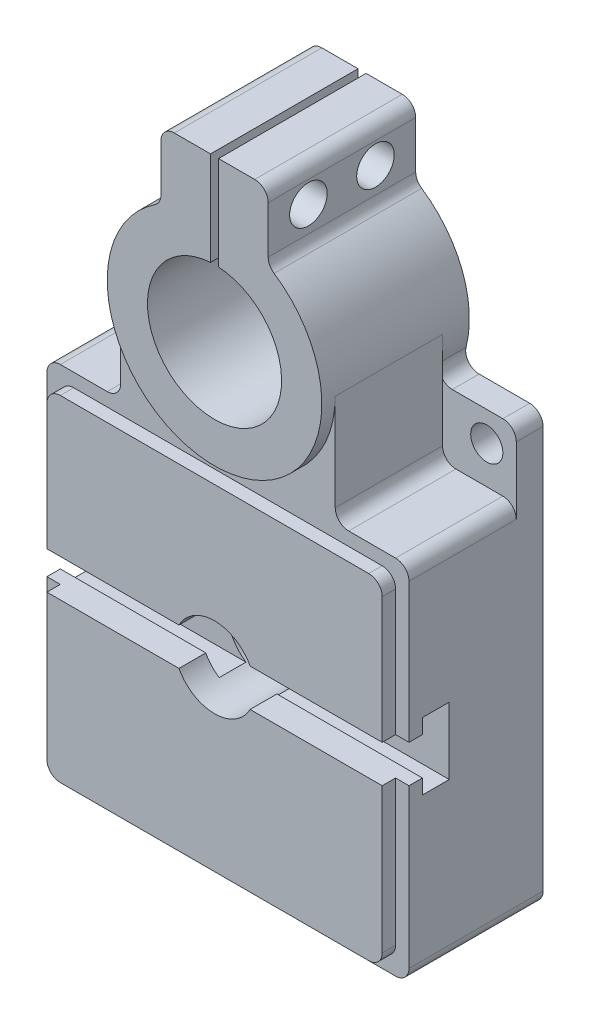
ISO-10303-21;
HEADER;
FILE_DESCRIPTION(('STEP AP214'),'2;1');
FILE_NAME('part.step','',(''),(''),'','','');
FILE_SCHEMA(('AUTOMOTIVE_DESIGN { 1 0 10303 214 1 1 1 1 }'));
ENDSEC;
DATA;
#1=APPLICATION_CONTEXT('core data for automotive mechanical design processes');
#2=APPLICATION_PROTOCOL_DEFINITION('international standard','automotive_design',2000,#1);
#3=PRODUCT_CONTEXT('',#1,'mechanical');
#4=PRODUCT('Part','Part','',(#3));
#5=PRODUCT_RELATED_PRODUCT_CATEGORY('part','',(#4));
#6=PRODUCT_DEFINITION_FORMATION('','',#4);
#7=PRODUCT_DEFINITION_CONTEXT('part definition',#1,'design');
#8=PRODUCT_DEFINITION('design','',#6,#7);
#9=PRODUCT_DEFINITION_SHAPE('','',#8);
#10=(LENGTH_UNIT() NAMED_UNIT(*) SI_UNIT(.MILLI.,.METRE.));
#11=(NAMED_UNIT(*) PLANE_ANGLE_UNIT() SI_UNIT($,.RADIAN.));
#12=(NAMED_UNIT(*) SI_UNIT($,.STERADIAN.) SOLID_ANGLE_UNIT());
#13=UNCERTAINTY_MEASURE_WITH_UNIT(LENGTH_MEASURE(1.E-05),#10,'distance_accuracy_value','');
#14=(GEOMETRIC_REPRESENTATION_CONTEXT(3) GLOBAL_UNCERTAINTY_ASSIGNED_CONTEXT((#13)) GLOBAL_UNIT_ASSIGNED_CONTEXT((#10,
#11,#12)) REPRESENTATION_CONTEXT('',''));
#15=CARTESIAN_POINT('',(0.,0.,0.));
#16=DIRECTION('',(0.,0.,1.));
#17=DIRECTION('',(1.,0.,0.));
#18=AXIS2_PLACEMENT_3D('',#15,#16,#17);
#19=CARTESIAN_POINT('',(0.,165.,10.));
#20=DIRECTION('',(0.,-1.,0.));
#21=DIRECTION('',(0.,0.,-1.));
#22=AXIS2_PLACEMENT_3D('',#19,#20,#21);
#23=PLANE('',#22);
#24=DIRECTION('',(-1.,0.,0.));
#25=VECTOR('',#24,1.);
#26=CARTESIAN_POINT('',(0.,165.,0.));
#27=LINE('',#26,#25);
#28=CARTESIAN_POINT('',(15.,165.,0.));
#29=VERTEX_POINT('',#28);
#30=CARTESIAN_POINT('',(1.50000000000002,165.,0.));
#31=VERTEX_POINT('',#30);
#32=EDGE_CURVE('E656',#29,#31,#27,.T.);
#33=ORIENTED_EDGE('',*,*,#32,.T.);
#34=DIRECTION('',(0.,0.,-1.));
#35=VECTOR('',#34,1.);
#36=CARTESIAN_POINT('',(1.50000000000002,165.,-2.49999999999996));
#37=LINE('',#36,#35);
#38=CARTESIAN_POINT('',(1.50000000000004,165.,55.));
#39=VERTEX_POINT('',#38);
#40=EDGE_CURVE('E644',#39,#31,#37,.T.);
#41=ORIENTED_EDGE('',*,*,#40,.F.);
#42=DIRECTION('',(-1.,0.,0.));
#43=VECTOR('',#42,1.);
#44=CARTESIAN_POINT('',(15.,165.,55.));
#45=LINE('',#44,#43);
#46=CARTESIAN_POINT('',(15.,165.,55.));
#47=VERTEX_POINT('',#46);
#48=EDGE_CURVE('E654',#47,#39,#45,.T.);
#49=ORIENTED_EDGE('',*,*,#48,.F.);
#50=DIRECTION('',(0.,0.,-1.));
#51=VECTOR('',#50,1.);
#52=CARTESIAN_POINT('',(15.,165.,10.));
#53=LINE('',#52,#51);
#54=EDGE_CURVE('E882',#47,#29,#53,.T.);
#55=ORIENTED_EDGE('',*,*,#54,.T.);
#56=EDGE_LOOP('',(#33,#41,#49,#55));
#57=FACE_BOUND('',#56,.T.);
#58=ADVANCED_FACE('F36',(#57),#23,.F.);
#59=CARTESIAN_POINT('',(80.5000000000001,12.5,35.));
#60=DIRECTION('',(0.,1.,0.));
#61=DIRECTION('',(0.,0.,1.));
#62=AXIS2_PLACEMENT_3D('',#59,#60,#61);
#63=PLANE('',#62);
#64=DIRECTION('',(-1.,0.,0.));
#65=VECTOR('',#64,1.);
#66=CARTESIAN_POINT('',(80.5000000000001,12.5,45.));
#67=LINE('',#66,#65);
#68=CARTESIAN_POINT('',(67.5,12.5,45.));
#69=VERTEX_POINT('',#68);
#70=CARTESIAN_POINT('',(8.2915619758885,12.5,45.));
#71=VERTEX_POINT('',#70);
#72=EDGE_CURVE('E1227',#69,#71,#67,.T.);
#73=ORIENTED_EDGE('',*,*,#72,.T.);
#74=DIRECTION('',(0.,0.,-1.));
#75=VECTOR('',#74,1.);
#76=CARTESIAN_POINT('',(8.2915619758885,12.5,55.));
#77=LINE('',#76,#75);
#78=CARTESIAN_POINT('',(8.2915619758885,12.5,35.));
#79=VERTEX_POINT('',#78);
#80=EDGE_CURVE('E1186',#71,#79,#77,.T.);
#81=ORIENTED_EDGE('',*,*,#80,.T.);
#82=DIRECTION('',(-1.,0.,0.));
#83=VECTOR('',#82,1.);
#84=CARTESIAN_POINT('',(80.5000000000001,12.5,35.));
#85=LINE('',#84,#83);
#86=CARTESIAN_POINT('',(67.5,12.5,35.));
#87=VERTEX_POINT('',#86);
#88=EDGE_CURVE('E1248',#87,#79,#85,.T.);
#89=ORIENTED_EDGE('',*,*,#88,.F.);
#90=DIRECTION('',(0.,0.,-1.));
#91=VECTOR('',#90,1.);
#92=CARTESIAN_POINT('',(67.5,12.5,10.));
#93=LINE('',#92,#91);
#94=EDGE_CURVE('E629',#69,#87,#93,.T.);
#95=ORIENTED_EDGE('',*,*,#94,.F.);
#96=EDGE_LOOP('',(#73,#81,#89,#95));
#97=FACE_BOUND('',#96,.T.);
#98=ADVANCED_FACE('F1379',(#97),#63,.F.);
#99=CARTESIAN_POINT('',(80.5000000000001,12.5,45.));
#100=DIRECTION('',(0.,0.,1.));
#101=DIRECTION('',(1.,0.,0.));
#102=AXIS2_PLACEMENT_3D('',#99,#100,#101);
#103=PLANE('',#102);
#104=DIRECTION('',(-1.,0.,0.));
#105=VECTOR('',#104,1.);
#106=CARTESIAN_POINT('',(80.5000000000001,7.,45.));
#107=LINE('',#106,#105);
#108=CARTESIAN_POINT('',(67.5,7.,45.));
#109=VERTEX_POINT('',#108);
#110=CARTESIAN_POINT('',(13.2664991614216,7.,45.));
#111=VERTEX_POINT('',#110);
#112=EDGE_CURVE('E1232',#109,#111,#107,.T.);
#113=ORIENTED_EDGE('',*,*,#112,.T.);
#114=CARTESIAN_POINT('',(0.,0.,45.));
#115=DIRECTION('',(0.,0.,1.));
#116=DIRECTION('',(1.,0.,0.));
#117=AXIS2_PLACEMENT_3D('',#114,#115,#116);
#118=CIRCLE('',#117,15.);
#119=EDGE_CURVE('E1190',#111,#71,#118,.T.);
#120=ORIENTED_EDGE('',*,*,#119,.T.);
#121=ORIENTED_EDGE('',*,*,#72,.F.);
#122=DIRECTION('',(0.,1.,0.));
#123=VECTOR('',#122,1.);
#124=CARTESIAN_POINT('',(67.5,84.,45.));
#125=LINE('',#124,#123);
#126=EDGE_CURVE('E632',#109,#69,#125,.T.);
#127=ORIENTED_EDGE('',*,*,#126,.F.);
#128=EDGE_LOOP('',(#113,#120,#121,#127));
#129=FACE_BOUND('',#128,.T.);
#130=ADVANCED_FACE('F1385',(#129),#103,.F.);
#131=CARTESIAN_POINT('',(80.5000000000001,-12.5,45.));
#132=DIRECTION('',(0.,0.,1.));
#133=DIRECTION('',(1.,0.,0.));
#134=AXIS2_PLACEMENT_3D('',#131,#132,#133);
#135=PLANE('',#134);
#136=DIRECTION('',(-1.,0.,0.));
#137=VECTOR('',#136,1.);
#138=CARTESIAN_POINT('',(80.5000000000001,-7.,45.));
#139=LINE('',#138,#137);
#140=CARTESIAN_POINT('',(-13.2664991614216,-7.,45.));
#141=VERTEX_POINT('',#140);
#142=CARTESIAN_POINT('',(-67.5,-7.,45.));
#143=VERTEX_POINT('',#142);
#144=EDGE_CURVE('E1239',#141,#143,#139,.T.);
#145=ORIENTED_EDGE('',*,*,#144,.F.);
#146=CARTESIAN_POINT('',(0.,0.,45.));
#147=DIRECTION('',(0.,0.,1.));
#148=DIRECTION('',(1.,0.,0.));
#149=AXIS2_PLACEMENT_3D('',#146,#147,#148);
#150=CIRCLE('',#149,15.);
#151=CARTESIAN_POINT('',(-8.2915619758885,-12.5,45.));
#152=VERTEX_POINT('',#151);
#153=EDGE_CURVE('E1180',#141,#152,#150,.T.);
#154=ORIENTED_EDGE('',*,*,#153,.T.);
#155=DIRECTION('',(-1.,0.,0.));
#156=VECTOR('',#155,1.);
#157=CARTESIAN_POINT('',(80.5000000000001,-12.5,45.));
#158=LINE('',#157,#156);
#159=CARTESIAN_POINT('',(-67.5,-12.5,45.));
#160=VERTEX_POINT('',#159);
#161=EDGE_CURVE('E1243',#152,#160,#158,.T.);
#162=ORIENTED_EDGE('',*,*,#161,.T.);
#163=DIRECTION('',(0.,1.,0.));
#164=VECTOR('',#163,1.);
#165=CARTESIAN_POINT('',(-67.5,-12.5,45.));
#166=LINE('',#165,#164);
#167=EDGE_CURVE('E1215',#160,#143,#166,.T.);
#168=ORIENTED_EDGE('',*,*,#167,.T.);
#169=EDGE_LOOP('',(#145,#154,#162,#168));
#170=FACE_BOUND('',#169,.T.);
#171=ADVANCED_FACE('F1597',(#170),#135,.F.);
#172=CARTESIAN_POINT('',(80.5000000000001,-12.5,35.));
#173=DIRECTION('',(0.,-1.,0.));
#174=DIRECTION('',(0.,0.,-1.));
#175=AXIS2_PLACEMENT_3D('',#172,#173,#174);
#176=PLANE('',#175);
#177=ORIENTED_EDGE('',*,*,#161,.F.);
#178=DIRECTION('',(0.,0.,-1.));
#179=VECTOR('',#178,1.);
#180=CARTESIAN_POINT('',(-8.2915619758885,-12.5,55.));
#181=LINE('',#180,#179);
#182=CARTESIAN_POINT('',(-8.2915619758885,-12.5,35.));
#183=VERTEX_POINT('',#182);
#184=EDGE_CURVE('E1197',#152,#183,#181,.T.);
#185=ORIENTED_EDGE('',*,*,#184,.T.);
#186=DIRECTION('',(-1.,0.,0.));
#187=VECTOR('',#186,1.);
#188=CARTESIAN_POINT('',(80.5000000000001,-12.5,35.));
#189=LINE('',#188,#187);
#190=CARTESIAN_POINT('',(-67.5,-12.5,35.));
#191=VERTEX_POINT('',#190);
#192=EDGE_CURVE('E1247',#183,#191,#189,.T.);
#193=ORIENTED_EDGE('',*,*,#192,.T.);
#194=DIRECTION('',(0.,0.,1.));
#195=VECTOR('',#194,1.);
#196=CARTESIAN_POINT('',(-67.5,-12.5,35.));
#197=LINE('',#196,#195);
#198=EDGE_CURVE('E1212',#191,#160,#197,.T.);
#199=ORIENTED_EDGE('',*,*,#198,.T.);
#200=EDGE_LOOP('',(#177,#185,#193,#199));
#201=FACE_BOUND('',#200,.T.);
#202=ADVANCED_FACE('F1600',(#201),#176,.F.);
#203=CARTESIAN_POINT('',(80.5000000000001,12.5,35.));
#204=DIRECTION('',(0.,0.,-1.));
#205=DIRECTION('',(-1.,0.,0.));
#206=AXIS2_PLACEMENT_3D('',#203,#204,#205);
#207=PLANE('',#206);
#208=ORIENTED_EDGE('',*,*,#88,.T.);
#209=CARTESIAN_POINT('',(0.,0.,35.));
#210=DIRECTION('',(0.,0.,-1.));
#211=DIRECTION('',(-1.,0.,0.));
#212=AXIS2_PLACEMENT_3D('',#209,#210,#211);
#213=CIRCLE('',#212,15.);
#214=CARTESIAN_POINT('',(8.2915619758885,-12.5,35.));
#215=VERTEX_POINT('',#214);
#216=EDGE_CURVE('E1183',#79,#215,#213,.T.);
#217=ORIENTED_EDGE('',*,*,#216,.T.);
#218=CARTESIAN_POINT('',(67.5,-12.5,35.));
#219=VERTEX_POINT('',#218);
#220=EDGE_CURVE('E1244',#219,#215,#189,.T.);
#221=ORIENTED_EDGE('',*,*,#220,.F.);
#222=DIRECTION('',(0.,-1.,0.));
#223=VECTOR('',#222,1.);
#224=CARTESIAN_POINT('',(67.5,84.,35.));
#225=LINE('',#224,#223);
#226=EDGE_CURVE('E620',#87,#219,#225,.T.);
#227=ORIENTED_EDGE('',*,*,#226,.F.);
#228=EDGE_LOOP('',(#208,#217,#221,#227));
#229=FACE_BOUND('',#228,.T.);
#230=ADVANCED_FACE('F1619',(#229),#207,.F.);
#231=CARTESIAN_POINT('',(80.5000000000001,7.,45.));
#232=DIRECTION('',(0.,1.,0.));
#233=DIRECTION('',(0.,0.,1.));
#234=AXIS2_PLACEMENT_3D('',#231,#232,#233);
#235=PLANE('',#234);
#236=DIRECTION('',(-1.,0.,0.));
#237=VECTOR('',#236,1.);
#238=CARTESIAN_POINT('',(-57.5,7.,55.));
#239=LINE('',#238,#237);
#240=CARTESIAN_POINT('',(62.5,7.,55.));
#241=VERTEX_POINT('',#240);
#242=CARTESIAN_POINT('',(13.2664991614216,7.,55.));
#243=VERTEX_POINT('',#242);
#244=EDGE_CURVE('E617',#241,#243,#239,.T.);
#245=ORIENTED_EDGE('',*,*,#244,.T.);
#246=DIRECTION('',(0.,0.,-1.));
#247=VECTOR('',#246,1.);
#248=CARTESIAN_POINT('',(13.2664991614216,7.,55.));
#249=LINE('',#248,#247);
#250=EDGE_CURVE('E1193',#243,#111,#249,.T.);
#251=ORIENTED_EDGE('',*,*,#250,.T.);
#252=ORIENTED_EDGE('',*,*,#112,.F.);
#253=DIRECTION('',(0.,0.,-1.));
#254=VECTOR('',#253,1.);
#255=CARTESIAN_POINT('',(67.5,7.00000000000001,10.));
#256=LINE('',#255,#254);
#257=CARTESIAN_POINT('',(67.5,7.00000000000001,50.));
#258=VERTEX_POINT('',#257);
#259=EDGE_CURVE('E1271',#258,#109,#256,.T.);
#260=ORIENTED_EDGE('',*,*,#259,.F.);
#261=DIRECTION('',(-1.,0.,0.));
#262=VECTOR('',#261,1.);
#263=CARTESIAN_POINT('',(-62.5,7.00000000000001,50.));
#264=LINE('',#263,#262);
#265=CARTESIAN_POINT('',(62.5,7.00000000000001,50.));
#266=VERTEX_POINT('',#265);
#267=EDGE_CURVE('E1270',#258,#266,#264,.T.);
#268=ORIENTED_EDGE('',*,*,#267,.T.);
#269=DIRECTION('',(0.,0.,-1.));
#270=VECTOR('',#269,1.);
#271=CARTESIAN_POINT('',(62.5,7.00000000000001,55.));
#272=LINE('',#271,#270);
#273=EDGE_CURVE('E1262',#241,#266,#272,.T.);
#274=ORIENTED_EDGE('',*,*,#273,.F.);
#275=EDGE_LOOP('',(#245,#251,#252,#260,#268,#274));
#276=FACE_BOUND('',#275,.T.);
#277=ADVANCED_FACE('F1613',(#276),#235,.F.);
#278=CARTESIAN_POINT('',(80.5000000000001,-7.,45.));
#279=DIRECTION('',(0.,-1.,0.));
#280=DIRECTION('',(0.,0.,-1.));
#281=AXIS2_PLACEMENT_3D('',#278,#279,#280);
#282=PLANE('',#281);
#283=DIRECTION('',(1.,0.,0.));
#284=VECTOR('',#283,1.);
#285=CARTESIAN_POINT('',(-57.5,-7.,55.));
#286=LINE('',#285,#284);
#287=CARTESIAN_POINT('',(-62.5,-7.,55.));
#288=VERTEX_POINT('',#287);
#289=CARTESIAN_POINT('',(-13.2664991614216,-7.,55.));
#290=VERTEX_POINT('',#289);
#291=EDGE_CURVE('E613',#288,#290,#286,.T.);
#292=ORIENTED_EDGE('',*,*,#291,.T.);
#293=DIRECTION('',(0.,0.,-1.));
#294=VECTOR('',#293,1.);
#295=CARTESIAN_POINT('',(-13.2664991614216,-7.,55.));
#296=LINE('',#295,#294);
#297=EDGE_CURVE('E638',#290,#141,#296,.T.);
#298=ORIENTED_EDGE('',*,*,#297,.T.);
#299=ORIENTED_EDGE('',*,*,#144,.T.);
#300=DIRECTION('',(0.,0.,1.));
#301=VECTOR('',#300,1.);
#302=CARTESIAN_POINT('',(-67.5,-7.,45.));
#303=LINE('',#302,#301);
#304=CARTESIAN_POINT('',(-67.5,-7.,50.));
#305=VERTEX_POINT('',#304);
#306=EDGE_CURVE('E1218',#143,#305,#303,.T.);
#307=ORIENTED_EDGE('',*,*,#306,.T.);
#308=DIRECTION('',(1.,0.,0.));
#309=VECTOR('',#308,1.);
#310=CARTESIAN_POINT('',(-62.5,-7.,50.));
#311=LINE('',#310,#309);
#312=CARTESIAN_POINT('',(-62.5,-7.,50.));
#313=VERTEX_POINT('',#312);
#314=EDGE_CURVE('E1258',#305,#313,#311,.T.);
#315=ORIENTED_EDGE('',*,*,#314,.T.);
#316=DIRECTION('',(0.,0.,-1.));
#317=VECTOR('',#316,1.);
#318=CARTESIAN_POINT('',(-62.5,-7.,55.));
#319=LINE('',#318,#317);
#320=EDGE_CURVE('E1253',#288,#313,#319,.T.);
#321=ORIENTED_EDGE('',*,*,#320,.F.);
#322=EDGE_LOOP('',(#292,#298,#299,#307,#315,#321));
#323=FACE_BOUND('',#322,.T.);
#324=ADVANCED_FACE('F1593',(#323),#282,.F.);
#325=CARTESIAN_POINT('',(-62.5,-66.,50.));
#326=DIRECTION('',(0.,0.,1.));
#327=DIRECTION('',(1.,0.,0.));
#328=AXIS2_PLACEMENT_3D('',#325,#326,#327);
#329=PLANE('',#328);
#330=ORIENTED_EDGE('',*,*,#267,.F.);
#331=DIRECTION('',(0.,1.,0.));
#332=VECTOR('',#331,1.);
#333=CARTESIAN_POINT('',(67.5,-66.,50.));
#334=LINE('',#333,#332);
#335=CARTESIAN_POINT('',(67.5,59.,50.));
#336=VERTEX_POINT('',#335);
#337=EDGE_CURVE('E763',#258,#336,#334,.T.);
#338=ORIENTED_EDGE('',*,*,#337,.T.);
#339=CARTESIAN_POINT('',(62.5,59.,50.));
#340=DIRECTION('',(0.,0.,1.));
#341=DIRECTION('',(1.,0.,0.));
#342=AXIS2_PLACEMENT_3D('',#339,#340,#341);
#343=CIRCLE('',#342,5.);
#344=CARTESIAN_POINT('',(62.5,64.,50.));
#345=VERTEX_POINT('',#344);
#346=EDGE_CURVE('E767',#336,#345,#343,.T.);
#347=ORIENTED_EDGE('',*,*,#346,.T.);
#348=DIRECTION('',(-1.,0.,0.));
#349=VECTOR('',#348,1.);
#350=CARTESIAN_POINT('',(45.,64.,50.));
#351=LINE('',#350,#349);
#352=CARTESIAN_POINT('',(45.,64.,50.));
#353=VERTEX_POINT('',#352);
#354=EDGE_CURVE('E769',#345,#353,#351,.T.);
#355=ORIENTED_EDGE('',*,*,#354,.T.);
#356=CARTESIAN_POINT('',(45.,69.,50.));
#357=DIRECTION('',(0.,0.,-1.));
#358=DIRECTION('',(1.,0.,0.));
#359=AXIS2_PLACEMENT_3D('',#356,#357,#358);
#360=CIRCLE('',#359,5.);
#361=CARTESIAN_POINT('',(40.,69.,50.));
#362=VERTEX_POINT('',#361);
#363=EDGE_CURVE('E771',#353,#362,#360,.T.);
#364=ORIENTED_EDGE('',*,*,#363,.T.);
#365=DIRECTION('',(0.,1.,0.));
#366=VECTOR('',#365,1.);
#367=CARTESIAN_POINT('',(40.,69.,50.));
#368=LINE('',#367,#366);
#369=CARTESIAN_POINT('',(39.9999999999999,105.,50.));
#370=VERTEX_POINT('',#369);
#371=EDGE_CURVE('E773',#362,#370,#368,.T.);
#372=ORIENTED_EDGE('',*,*,#371,.T.);
#373=CARTESIAN_POINT('',(0.,105.,50.));
#374=DIRECTION('',(0.,0.,1.));
#375=DIRECTION('',(1.,0.,0.));
#376=AXIS2_PLACEMENT_3D('',#373,#374,#375);
#377=CIRCLE('',#376,40.0000000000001);
#378=CARTESIAN_POINT('',(-40.0000000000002,105.,50.));
#379=VERTEX_POINT('',#378);
#380=EDGE_CURVE('E683',#379,#370,#377,.T.);
#381=ORIENTED_EDGE('',*,*,#380,.F.);
#382=DIRECTION('',(0.,-1.,0.));
#383=VECTOR('',#382,1.);
#384=CARTESIAN_POINT('',(-40.,69.0000000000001,50.));
#385=LINE('',#384,#383);
#386=CARTESIAN_POINT('',(-40.,69.0000000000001,50.));
#387=VERTEX_POINT('',#386);
#388=EDGE_CURVE('E775',#379,#387,#385,.T.);
#389=ORIENTED_EDGE('',*,*,#388,.T.);
#390=CARTESIAN_POINT('',(-45.,69.,50.));
#391=DIRECTION('',(0.,0.,-1.));
#392=DIRECTION('',(-1.,0.,0.));
#393=AXIS2_PLACEMENT_3D('',#390,#391,#392);
#394=CIRCLE('',#393,5.);
#395=CARTESIAN_POINT('',(-45.0000000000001,64.,50.));
#396=VERTEX_POINT('',#395);
#397=EDGE_CURVE('E777',#387,#396,#394,.T.);
#398=ORIENTED_EDGE('',*,*,#397,.T.);
#399=DIRECTION('',(-1.,0.,0.));
#400=VECTOR('',#399,1.);
#401=CARTESIAN_POINT('',(-62.5,64.,50.));
#402=LINE('',#401,#400);
#403=CARTESIAN_POINT('',(-62.5,64.,50.));
#404=VERTEX_POINT('',#403);
#405=EDGE_CURVE('E779',#396,#404,#402,.T.);
#406=ORIENTED_EDGE('',*,*,#405,.T.);
#407=CARTESIAN_POINT('',(-62.5,59.,50.));
#408=DIRECTION('',(0.,0.,1.));
#409=DIRECTION('',(1.,0.,0.));
#410=AXIS2_PLACEMENT_3D('',#407,#408,#409);
#411=CIRCLE('',#410,5.);
#412=CARTESIAN_POINT('',(-67.5,59.,50.));
#413=VERTEX_POINT('',#412);
#414=EDGE_CURVE('E781',#404,#413,#411,.T.);
#415=ORIENTED_EDGE('',*,*,#414,.T.);
#416=DIRECTION('',(0.,-1.,0.));
#417=VECTOR('',#416,1.);
#418=CARTESIAN_POINT('',(-67.5,59.,50.));
#419=LINE('',#418,#417);
#420=CARTESIAN_POINT('',(-67.5,7.,50.));
#421=VERTEX_POINT('',#420);
#422=EDGE_CURVE('E784',#413,#421,#419,.T.);
#423=ORIENTED_EDGE('',*,*,#422,.T.);
#424=CARTESIAN_POINT('',(-62.5,7.,50.));
#425=VERTEX_POINT('',#424);
#426=EDGE_CURVE('E1268',#425,#421,#264,.T.);
#427=ORIENTED_EDGE('',*,*,#426,.F.);
#428=DIRECTION('',(0.,-1.,0.));
#429=VECTOR('',#428,1.);
#430=CARTESIAN_POINT('',(-62.5,53.9999999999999,50.));
#431=LINE('',#430,#429);
#432=CARTESIAN_POINT('',(-62.5,53.9999999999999,50.));
#433=VERTEX_POINT('',#432);
#434=EDGE_CURVE('E714',#433,#425,#431,.T.);
#435=ORIENTED_EDGE('',*,*,#434,.F.);
#436=CARTESIAN_POINT('',(-57.5,54.,50.));
#437=DIRECTION('',(0.,0.,1.));
#438=DIRECTION('',(1.,0.,0.));
#439=AXIS2_PLACEMENT_3D('',#436,#437,#438);
#440=CIRCLE('',#439,5.);
#441=CARTESIAN_POINT('',(-57.5,59.,50.));
#442=VERTEX_POINT('',#441);
#443=EDGE_CURVE('E682',#442,#433,#440,.T.);
#444=ORIENTED_EDGE('',*,*,#443,.F.);
#445=DIRECTION('',(-1.,0.,0.));
#446=VECTOR('',#445,1.);
#447=CARTESIAN_POINT('',(57.5,59.,50.));
#448=LINE('',#447,#446);
#449=CARTESIAN_POINT('',(57.5,59.,50.));
#450=VERTEX_POINT('',#449);
#451=EDGE_CURVE('E692',#450,#442,#448,.T.);
#452=ORIENTED_EDGE('',*,*,#451,.F.);
#453=CARTESIAN_POINT('',(57.5,54.,50.));
#454=DIRECTION('',(0.,0.,1.));
#455=DIRECTION('',(1.,0.,0.));
#456=AXIS2_PLACEMENT_3D('',#453,#454,#455);
#457=CIRCLE('',#456,5.);
#458=CARTESIAN_POINT('',(62.5,54.,50.));
#459=VERTEX_POINT('',#458);
#460=EDGE_CURVE('E727',#459,#450,#457,.T.);
#461=ORIENTED_EDGE('',*,*,#460,.F.);
#462=DIRECTION('',(0.,1.,0.));
#463=VECTOR('',#462,1.);
#464=CARTESIAN_POINT('',(62.5,-61.,50.));
#465=LINE('',#464,#463);
#466=EDGE_CURVE('E723',#266,#459,#465,.T.);
#467=ORIENTED_EDGE('',*,*,#466,.F.);
#468=EDGE_LOOP('',(#330,#338,#347,#355,#364,#372,#381,#389,#398,#406,#415,#423,#427,#435,#444,
#452,#461,#467));
#469=FACE_BOUND('',#468,.T.);
#470=ADVANCED_FACE('F1496',(#469),#329,.T.);
#471=CARTESIAN_POINT('',(-62.5,53.9999999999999,55.));
#472=DIRECTION('',(1.,0.,0.));
#473=DIRECTION('',(0.,1.,0.));
#474=AXIS2_PLACEMENT_3D('',#471,#472,#473);
#475=PLANE('',#474);
#476=ORIENTED_EDGE('',*,*,#434,.T.);
#477=DIRECTION('',(0.,0.,1.));
#478=VECTOR('',#477,1.);
#479=CARTESIAN_POINT('',(-62.5,7.,55.));
#480=LINE('',#479,#478);
#481=CARTESIAN_POINT('',(-62.5,7.,55.));
#482=VERTEX_POINT('',#481);
#483=EDGE_CURVE('E1265',#425,#482,#480,.T.);
#484=ORIENTED_EDGE('',*,*,#483,.T.);
#485=DIRECTION('',(0.,-1.,0.));
#486=VECTOR('',#485,1.);
#487=CARTESIAN_POINT('',(-62.5,53.9999999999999,55.));
#488=LINE('',#487,#486);
#489=CARTESIAN_POINT('',(-62.5,53.9999999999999,55.));
#490=VERTEX_POINT('',#489);
#491=EDGE_CURVE('E693',#490,#482,#488,.T.);
#492=ORIENTED_EDGE('',*,*,#491,.F.);
#493=DIRECTION('',(0.,0.,-1.));
#494=VECTOR('',#493,1.);
#495=CARTESIAN_POINT('',(-62.5,53.9999999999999,55.));
#496=LINE('',#495,#494);
#497=EDGE_CURVE('E750',#490,#433,#496,.T.);
#498=ORIENTED_EDGE('',*,*,#497,.T.);
#499=EDGE_LOOP('',(#476,#484,#492,#498));
#500=FACE_BOUND('',#499,.T.);
#501=ADVANCED_FACE('F1499',(#500),#475,.F.);
#502=CARTESIAN_POINT('',(62.5,-61.,55.));
#503=DIRECTION('',(-1.,0.,0.));
#504=DIRECTION('',(0.,0.,1.));
#505=AXIS2_PLACEMENT_3D('',#502,#503,#504);
#506=PLANE('',#505);
#507=DIRECTION('',(0.,1.,0.));
#508=VECTOR('',#507,1.);
#509=CARTESIAN_POINT('',(62.5,-61.,55.));
#510=LINE('',#509,#508);
#511=CARTESIAN_POINT('',(62.5,54.,55.));
#512=VERTEX_POINT('',#511);
#513=EDGE_CURVE('E702',#241,#512,#510,.T.);
#514=ORIENTED_EDGE('',*,*,#513,.F.);
#515=ORIENTED_EDGE('',*,*,#273,.T.);
#516=ORIENTED_EDGE('',*,*,#466,.T.);
#517=DIRECTION('',(0.,0.,-1.));
#518=VECTOR('',#517,1.);
#519=CARTESIAN_POINT('',(62.5,54.,55.));
#520=LINE('',#519,#518);
#521=EDGE_CURVE('E735',#512,#459,#520,.T.);
#522=ORIENTED_EDGE('',*,*,#521,.F.);
#523=EDGE_LOOP('',(#514,#515,#516,#522));
#524=FACE_BOUND('',#523,.T.);
#525=ADVANCED_FACE('F1518',(#524),#506,.F.);
#526=CARTESIAN_POINT('',(-57.5,54.,55.));
#527=DIRECTION('',(0.,0.,1.));
#528=DIRECTION('',(1.,0.,0.));
#529=AXIS2_PLACEMENT_3D('',#526,#527,#528);
#530=PLANE('',#529);
#531=CARTESIAN_POINT('',(0.,0.,55.));
#532=DIRECTION('',(0.,0.,-1.));
#533=DIRECTION('',(-1.,0.,0.));
#534=AXIS2_PLACEMENT_3D('',#531,#532,#533);
#535=CIRCLE('',#534,15.);
#536=CARTESIAN_POINT('',(-13.2664991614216,7.,55.));
#537=VERTEX_POINT('',#536);
#538=EDGE_CURVE('E1173',#537,#243,#535,.T.);
#539=ORIENTED_EDGE('',*,*,#538,.T.);
#540=ORIENTED_EDGE('',*,*,#244,.F.);
#541=ORIENTED_EDGE('',*,*,#513,.T.);
#542=CARTESIAN_POINT('',(57.5,54.,55.));
#543=DIRECTION('',(0.,0.,1.));
#544=DIRECTION('',(1.,0.,0.));
#545=AXIS2_PLACEMENT_3D('',#542,#543,#544);
#546=CIRCLE('',#545,5.);
#547=CARTESIAN_POINT('',(57.5,59.,55.));
#548=VERTEX_POINT('',#547);
#549=EDGE_CURVE('E706',#512,#548,#546,.T.);
#550=ORIENTED_EDGE('',*,*,#549,.T.);
#551=DIRECTION('',(-1.,0.,0.));
#552=VECTOR('',#551,1.);
#553=CARTESIAN_POINT('',(57.5,59.,55.));
#554=LINE('',#553,#552);
#555=CARTESIAN_POINT('',(-57.5,59.,55.));
#556=VERTEX_POINT('',#555);
#557=EDGE_CURVE('E708',#548,#556,#554,.T.);
#558=ORIENTED_EDGE('',*,*,#557,.T.);
#559=CARTESIAN_POINT('',(-57.5,54.,55.));
#560=DIRECTION('',(0.,0.,1.));
#561=DIRECTION('',(1.,0.,0.));
#562=AXIS2_PLACEMENT_3D('',#559,#560,#561);
#563=CIRCLE('',#562,5.);
#564=EDGE_CURVE('E688',#556,#490,#563,.T.);
#565=ORIENTED_EDGE('',*,*,#564,.T.);
#566=ORIENTED_EDGE('',*,*,#491,.T.);
#567=EDGE_CURVE('E616',#537,#482,#239,.T.);
#568=ORIENTED_EDGE('',*,*,#567,.F.);
#569=EDGE_LOOP('',(#539,#540,#541,#550,#558,#565,#566,#568));
#570=FACE_BOUND('',#569,.T.);
#571=ADVANCED_FACE('F1611',(#570),#530,.T.);
#572=CARTESIAN_POINT('',(-57.5,49.,45.));
#573=DIRECTION('',(-1.,0.,0.));
#574=DIRECTION('',(0.,-1.,0.));
#575=AXIS2_PLACEMENT_3D('',#572,#573,#574);
#576=PLANE('',#575);
#577=DIRECTION('',(0.,0.,1.));
#578=VECTOR('',#577,1.);
#579=CARTESIAN_POINT('',(-57.5,30.,25.));
#580=LINE('',#579,#578);
#581=CARTESIAN_POINT('',(-57.5,30.,45.));
#582=VERTEX_POINT('',#581);
#583=CARTESIAN_POINT('',(-57.5,30.,29.8262379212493));
#584=VERTEX_POINT('',#583);
#585=EDGE_CURVE('E1003',#582,#584,#580,.F.);
#586=ORIENTED_EDGE('',*,*,#585,.T.);
#587=CARTESIAN_POINT('',(-57.5,37.,22.));
#588=DIRECTION('',(-1.,0.,0.));
#589=DIRECTION('',(0.,-1.,0.));
#590=AXIS2_PLACEMENT_3D('',#587,#588,#589);
#591=CIRCLE('',#590,10.5);
#592=CARTESIAN_POINT('',(-57.5,26.937694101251,25.));
#593=VERTEX_POINT('',#592);
#594=EDGE_CURVE('E55',#584,#593,#591,.T.);
#595=ORIENTED_EDGE('',*,*,#594,.T.);
#596=DIRECTION('',(0.,1.,0.));
#597=VECTOR('',#596,1.);
#598=CARTESIAN_POINT('',(-57.5,20.,25.));
#599=LINE('',#598,#597);
#600=CARTESIAN_POINT('',(-57.5,-30.,25.));
#601=VERTEX_POINT('',#600);
#602=EDGE_CURVE('E596',#601,#593,#599,.T.);
#603=ORIENTED_EDGE('',*,*,#602,.F.);
#604=DIRECTION('',(0.,0.,1.));
#605=VECTOR('',#604,1.);
#606=CARTESIAN_POINT('',(-57.5,-30.,45.));
#607=LINE('',#606,#605);
#608=CARTESIAN_POINT('',(-57.5,-30.,45.));
#609=VERTEX_POINT('',#608);
#610=EDGE_CURVE('E1000',#601,#609,#607,.T.);
#611=ORIENTED_EDGE('',*,*,#610,.T.);
#612=DIRECTION('',(0.,1.,0.));
#613=VECTOR('',#612,1.);
#614=CARTESIAN_POINT('',(-57.5,49.,45.));
#615=LINE('',#614,#613);
#616=CARTESIAN_POINT('',(-57.5,-56.,45.));
#617=VERTEX_POINT('',#616);
#618=EDGE_CURVE('E1027',#617,#609,#615,.T.);
#619=ORIENTED_EDGE('',*,*,#618,.F.);
#620=DIRECTION('',(0.,0.,-1.));
#621=VECTOR('',#620,1.);
#622=CARTESIAN_POINT('',(-57.5,-56.,45.));
#623=LINE('',#622,#621);
#624=CARTESIAN_POINT('',(-57.5,-56.,0.));
#625=VERTEX_POINT('',#624);
#626=EDGE_CURVE('E1138',#617,#625,#623,.T.);
#627=ORIENTED_EDGE('',*,*,#626,.T.);
#628=DIRECTION('',(0.,1.,0.));
#629=VECTOR('',#628,1.);
#630=CARTESIAN_POINT('',(-57.5,49.,0.));
#631=LINE('',#630,#629);
#632=CARTESIAN_POINT('',(-57.5,49.,0.));
#633=VERTEX_POINT('',#632);
#634=EDGE_CURVE('E1082',#625,#633,#631,.T.);
#635=ORIENTED_EDGE('',*,*,#634,.T.);
#636=DIRECTION('',(0.,0.,-1.));
#637=VECTOR('',#636,1.);
#638=CARTESIAN_POINT('',(-57.5,49.,45.));
#639=LINE('',#638,#637);
#640=CARTESIAN_POINT('',(-57.5,49.,45.));
#641=VERTEX_POINT('',#640);
#642=EDGE_CURVE('E1136',#641,#633,#639,.T.);
#643=ORIENTED_EDGE('',*,*,#642,.F.);
#644=EDGE_CURVE('E1035',#582,#641,#615,.T.);
#645=ORIENTED_EDGE('',*,*,#644,.F.);
#646=EDGE_LOOP('',(#586,#595,#603,#611,#619,#627,#635,#643,#645));
#647=FACE_BOUND('',#646,.T.);
#648=ADVANCED_FACE('F1026',(#647),#576,.F.);
#649=CARTESIAN_POINT('',(57.5,-56.,45.));
#650=DIRECTION('',(1.,0.,0.));
#651=DIRECTION('',(0.,1.,0.));
#652=AXIS2_PLACEMENT_3D('',#649,#650,#651);
#653=PLANE('',#652);
#654=DIRECTION('',(0.,-1.,0.));
#655=VECTOR('',#654,1.);
#656=CARTESIAN_POINT('',(57.5,20.,25.));
#657=LINE('',#656,#655);
#658=CARTESIAN_POINT('',(57.5,30.,25.));
#659=VERTEX_POINT('',#658);
#660=CARTESIAN_POINT('',(57.5,-30.,25.));
#661=VERTEX_POINT('',#660);
#662=EDGE_CURVE('E1021',#659,#661,#657,.T.);
#663=ORIENTED_EDGE('',*,*,#662,.F.);
#664=DIRECTION('',(0.,0.,1.));
#665=VECTOR('',#664,1.);
#666=CARTESIAN_POINT('',(57.5,30.,45.));
#667=LINE('',#666,#665);
#668=CARTESIAN_POINT('',(57.5,30.,45.));
#669=VERTEX_POINT('',#668);
#670=EDGE_CURVE('E990',#659,#669,#667,.T.);
#671=ORIENTED_EDGE('',*,*,#670,.T.);
#672=DIRECTION('',(0.,-1.,0.));
#673=VECTOR('',#672,1.);
#674=CARTESIAN_POINT('',(57.5,-56.,45.));
#675=LINE('',#674,#673);
#676=CARTESIAN_POINT('',(57.5,49.,45.));
#677=VERTEX_POINT('',#676);
#678=EDGE_CURVE('E1285',#677,#669,#675,.T.);
#679=ORIENTED_EDGE('',*,*,#678,.F.);
#680=DIRECTION('',(0.,0.,-1.));
#681=VECTOR('',#680,1.);
#682=CARTESIAN_POINT('',(57.5,49.,45.));
#683=LINE('',#682,#681);
#684=CARTESIAN_POINT('',(57.5,49.,0.));
#685=VERTEX_POINT('',#684);
#686=EDGE_CURVE('E1068',#677,#685,#683,.T.);
#687=ORIENTED_EDGE('',*,*,#686,.T.);
#688=DIRECTION('',(0.,-1.,0.));
#689=VECTOR('',#688,1.);
#690=CARTESIAN_POINT('',(57.5,-56.,0.));
#691=LINE('',#690,#689);
#692=CARTESIAN_POINT('',(57.5,-56.,0.));
#693=VERTEX_POINT('',#692);
#694=EDGE_CURVE('E1070',#685,#693,#691,.T.);
#695=ORIENTED_EDGE('',*,*,#694,.T.);
#696=DIRECTION('',(0.,0.,-1.));
#697=VECTOR('',#696,1.);
#698=CARTESIAN_POINT('',(57.5,-56.,45.));
#699=LINE('',#698,#697);
#700=CARTESIAN_POINT('',(57.5,-56.,45.));
#701=VERTEX_POINT('',#700);
#702=EDGE_CURVE('E1144',#701,#693,#699,.T.);
#703=ORIENTED_EDGE('',*,*,#702,.F.);
#704=CARTESIAN_POINT('',(57.5,-30.,45.));
#705=VERTEX_POINT('',#704);
#706=EDGE_CURVE('E1284',#705,#701,#675,.T.);
#707=ORIENTED_EDGE('',*,*,#706,.F.);
#708=DIRECTION('',(0.,0.,1.));
#709=VECTOR('',#708,1.);
#710=CARTESIAN_POINT('',(57.5,-30.,25.));
#711=LINE('',#710,#709);
#712=EDGE_CURVE('E985',#705,#661,#711,.F.);
#713=ORIENTED_EDGE('',*,*,#712,.T.);
#714=EDGE_LOOP('',(#663,#671,#679,#687,#695,#703,#707,#713));
#715=FACE_BOUND('',#714,.T.);
#716=ADVANCED_FACE('F1323',(#715),#653,.F.);
#717=CARTESIAN_POINT('',(52.5,49.,45.));
#718=DIRECTION('',(0.,0.,-1.));
#719=DIRECTION('',(-1.,0.,0.));
#720=AXIS2_PLACEMENT_3D('',#717,#718,#719);
#721=PLANE('',#720);
#722=ORIENTED_EDGE('',*,*,#678,.T.);
#723=CARTESIAN_POINT('',(47.5,30.,45.));
#724=DIRECTION('',(0.,0.,-1.));
#725=DIRECTION('',(-1.,0.,0.));
#726=AXIS2_PLACEMENT_3D('',#723,#724,#725);
#727=CIRCLE('',#726,10.);
#728=CARTESIAN_POINT('',(47.5,20.,45.));
#729=VERTEX_POINT('',#728);
#730=EDGE_CURVE('E995',#669,#729,#727,.T.);
#731=ORIENTED_EDGE('',*,*,#730,.T.);
#732=DIRECTION('',(1.,0.,0.));
#733=VECTOR('',#732,1.);
#734=CARTESIAN_POINT('',(57.5,20.,45.));
#735=LINE('',#734,#733);
#736=CARTESIAN_POINT('',(-47.5,20.,45.));
#737=VERTEX_POINT('',#736);
#738=EDGE_CURVE('E1274',#737,#729,#735,.T.);
#739=ORIENTED_EDGE('',*,*,#738,.F.);
#740=CARTESIAN_POINT('',(-47.5,30.,45.));
#741=DIRECTION('',(0.,0.,-1.));
#742=DIRECTION('',(-1.,0.,0.));
#743=AXIS2_PLACEMENT_3D('',#740,#741,#742);
#744=CIRCLE('',#743,10.);
#745=EDGE_CURVE('E993',#737,#582,#744,.T.);
#746=ORIENTED_EDGE('',*,*,#745,.T.);
#747=ORIENTED_EDGE('',*,*,#644,.T.);
#748=CARTESIAN_POINT('',(-52.5,49.,45.));
#749=DIRECTION('',(0.,0.,-1.));
#750=DIRECTION('',(-1.,0.,0.));
#751=AXIS2_PLACEMENT_3D('',#748,#749,#750);
#752=CIRCLE('',#751,5.);
#753=CARTESIAN_POINT('',(-52.5,54.,45.));
#754=VERTEX_POINT('',#753);
#755=EDGE_CURVE('E1034',#641,#754,#752,.T.);
#756=ORIENTED_EDGE('',*,*,#755,.T.);
#757=DIRECTION('',(1.,0.,0.));
#758=VECTOR('',#757,1.);
#759=CARTESIAN_POINT('',(-35.0000000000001,54.,45.));
#760=LINE('',#759,#758);
#761=CARTESIAN_POINT('',(-35.0000000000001,54.,45.));
#762=VERTEX_POINT('',#761);
#763=EDGE_CURVE('E1038',#754,#762,#760,.T.);
#764=ORIENTED_EDGE('',*,*,#763,.T.);
#765=CARTESIAN_POINT('',(-35.,59.,45.));
#766=DIRECTION('',(0.,0.,1.));
#767=DIRECTION('',(-1.,0.,0.));
#768=AXIS2_PLACEMENT_3D('',#765,#766,#767);
#769=CIRCLE('',#768,5.);
#770=CARTESIAN_POINT('',(-30.,59.,45.));
#771=VERTEX_POINT('',#770);
#772=EDGE_CURVE('E1045',#762,#771,#769,.T.);
#773=ORIENTED_EDGE('',*,*,#772,.T.);
#774=DIRECTION('',(0.,1.,0.));
#775=VECTOR('',#774,1.);
#776=CARTESIAN_POINT('',(-30.,64.,45.));
#777=LINE('',#776,#775);
#778=CARTESIAN_POINT('',(-30.,64.,45.));
#779=VERTEX_POINT('',#778);
#780=EDGE_CURVE('E1048',#771,#779,#777,.T.);
#781=ORIENTED_EDGE('',*,*,#780,.T.);
#782=CARTESIAN_POINT('',(-25.,64.,45.));
#783=DIRECTION('',(0.,0.,-1.));
#784=DIRECTION('',(1.,0.,0.));
#785=AXIS2_PLACEMENT_3D('',#782,#783,#784);
#786=CIRCLE('',#785,5.);
#787=CARTESIAN_POINT('',(-25.,69.,45.));
#788=VERTEX_POINT('',#787);
#789=EDGE_CURVE('E1051',#779,#788,#786,.T.);
#790=ORIENTED_EDGE('',*,*,#789,.T.);
#791=DIRECTION('',(1.,0.,0.));
#792=VECTOR('',#791,1.);
#793=CARTESIAN_POINT('',(0.,69.,45.));
#794=LINE('',#793,#792);
#795=CARTESIAN_POINT('',(24.9999999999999,69.,45.));
#796=VERTEX_POINT('',#795);
#797=EDGE_CURVE('E1054',#788,#796,#794,.T.);
#798=ORIENTED_EDGE('',*,*,#797,.T.);
#799=CARTESIAN_POINT('',(25.,64.,45.));
#800=DIRECTION('',(0.,0.,-1.));
#801=DIRECTION('',(-1.,0.,0.));
#802=AXIS2_PLACEMENT_3D('',#799,#800,#801);
#803=CIRCLE('',#802,5.);
#804=CARTESIAN_POINT('',(30.,63.9999999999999,45.));
#805=VERTEX_POINT('',#804);
#806=EDGE_CURVE('E1056',#796,#805,#803,.T.);
#807=ORIENTED_EDGE('',*,*,#806,.T.);
#808=DIRECTION('',(0.,-1.,0.));
#809=VECTOR('',#808,1.);
#810=CARTESIAN_POINT('',(30.,63.9999999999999,45.));
#811=LINE('',#810,#809);
#812=CARTESIAN_POINT('',(30.,59.,45.));
#813=VERTEX_POINT('',#812);
#814=EDGE_CURVE('E1059',#805,#813,#811,.T.);
#815=ORIENTED_EDGE('',*,*,#814,.T.);
#816=CARTESIAN_POINT('',(35.,59.,45.));
#817=DIRECTION('',(0.,0.,1.));
#818=DIRECTION('',(-1.,0.,0.));
#819=AXIS2_PLACEMENT_3D('',#816,#817,#818);
#820=CIRCLE('',#819,5.);
#821=CARTESIAN_POINT('',(35.,54.,45.));
#822=VERTEX_POINT('',#821);
#823=EDGE_CURVE('E1062',#813,#822,#820,.T.);
#824=ORIENTED_EDGE('',*,*,#823,.T.);
#825=DIRECTION('',(1.,0.,0.));
#826=VECTOR('',#825,1.);
#827=CARTESIAN_POINT('',(52.5,54.,45.));
#828=LINE('',#827,#826);
#829=CARTESIAN_POINT('',(52.5,54.,45.));
#830=VERTEX_POINT('',#829);
#831=EDGE_CURVE('E1065',#822,#830,#828,.T.);
#832=ORIENTED_EDGE('',*,*,#831,.T.);
#833=CARTESIAN_POINT('',(52.5,49.,45.));
#834=DIRECTION('',(0.,0.,-1.));
#835=DIRECTION('',(-1.,0.,0.));
#836=AXIS2_PLACEMENT_3D('',#833,#834,#835);
#837=CIRCLE('',#836,5.);
#838=EDGE_CURVE('E1115',#830,#677,#837,.T.);
#839=ORIENTED_EDGE('',*,*,#838,.T.);
#840=EDGE_LOOP('',(#722,#731,#739,#746,#747,#756,#764,#773,#781,#790,#798,#807,#815,#824,#832,#839));
#841=FACE_BOUND('',#840,.T.);
#842=ADVANCED_FACE('F1312',(#841),#721,.T.);
#843=ORIENTED_EDGE('',*,*,#618,.T.);
#844=CARTESIAN_POINT('',(-47.5,-30.,45.));
#845=DIRECTION('',(0.,0.,-1.));
#846=DIRECTION('',(-1.,0.,0.));
#847=AXIS2_PLACEMENT_3D('',#844,#845,#846);
#848=CIRCLE('',#847,10.);
#849=CARTESIAN_POINT('',(-47.5,-20.,45.));
#850=VERTEX_POINT('',#849);
#851=EDGE_CURVE('E1005',#609,#850,#848,.T.);
#852=ORIENTED_EDGE('',*,*,#851,.T.);
#853=DIRECTION('',(-1.,0.,0.));
#854=VECTOR('',#853,1.);
#855=CARTESIAN_POINT('',(57.5,-20.,45.));
#856=LINE('',#855,#854);
#857=CARTESIAN_POINT('',(47.5,-20.,45.));
#858=VERTEX_POINT('',#857);
#859=EDGE_CURVE('E1015',#858,#850,#856,.T.);
#860=ORIENTED_EDGE('',*,*,#859,.F.);
#861=CARTESIAN_POINT('',(47.5,-30.,45.));
#862=DIRECTION('',(0.,0.,-1.));
#863=DIRECTION('',(-1.,0.,0.));
#864=AXIS2_PLACEMENT_3D('',#861,#862,#863);
#865=CIRCLE('',#864,10.);
#866=EDGE_CURVE('E983',#858,#705,#865,.T.);
#867=ORIENTED_EDGE('',*,*,#866,.T.);
#868=ORIENTED_EDGE('',*,*,#706,.T.);
#869=CARTESIAN_POINT('',(52.5,-56.,45.));
#870=DIRECTION('',(0.,0.,-1.));
#871=DIRECTION('',(-1.,0.,0.));
#872=AXIS2_PLACEMENT_3D('',#869,#870,#871);
#873=CIRCLE('',#872,5.);
#874=CARTESIAN_POINT('',(52.5,-61.,45.));
#875=VERTEX_POINT('',#874);
#876=EDGE_CURVE('E1288',#701,#875,#873,.T.);
#877=ORIENTED_EDGE('',*,*,#876,.T.);
#878=DIRECTION('',(-1.,0.,0.));
#879=VECTOR('',#878,1.);
#880=CARTESIAN_POINT('',(-52.5,-61.,45.));
#881=LINE('',#880,#879);
#882=CARTESIAN_POINT('',(-52.5,-61.,45.));
#883=VERTEX_POINT('',#882);
#884=EDGE_CURVE('E1290',#875,#883,#881,.T.);
#885=ORIENTED_EDGE('',*,*,#884,.T.);
#886=CARTESIAN_POINT('',(-52.5,-56.,45.));
#887=DIRECTION('',(0.,0.,-1.));
#888=DIRECTION('',(1.,0.,0.));
#889=AXIS2_PLACEMENT_3D('',#886,#887,#888);
#890=CIRCLE('',#889,5.);
#891=EDGE_CURVE('E1033',#883,#617,#890,.T.);
#892=ORIENTED_EDGE('',*,*,#891,.T.);
#893=EDGE_LOOP('',(#843,#852,#860,#867,#868,#877,#885,#892));
#894=FACE_BOUND('',#893,.T.);
#895=ADVANCED_FACE('F1030',(#894),#721,.T.);
#896=ORIENTED_EDGE('',*,*,#314,.F.);
#897=CARTESIAN_POINT('',(-67.5,-66.,50.));
#898=VERTEX_POINT('',#897);
#899=EDGE_CURVE('E783',#305,#898,#419,.T.);
#900=ORIENTED_EDGE('',*,*,#899,.T.);
#901=CARTESIAN_POINT('',(-62.5,-66.,50.));
#902=DIRECTION('',(0.,0.,1.));
#903=DIRECTION('',(1.,0.,0.));
#904=AXIS2_PLACEMENT_3D('',#901,#902,#903);
#905=CIRCLE('',#904,5.);
#906=CARTESIAN_POINT('',(-62.5,-71.,50.));
#907=VERTEX_POINT('',#906);
#908=EDGE_CURVE('E753',#898,#907,#905,.T.);
#909=ORIENTED_EDGE('',*,*,#908,.T.);
#910=DIRECTION('',(1.,0.,0.));
#911=VECTOR('',#910,1.);
#912=CARTESIAN_POINT('',(-62.5,-71.,50.));
#913=LINE('',#912,#911);
#914=CARTESIAN_POINT('',(62.5,-71.,50.));
#915=VERTEX_POINT('',#914);
#916=EDGE_CURVE('E756',#907,#915,#913,.T.);
#917=ORIENTED_EDGE('',*,*,#916,.T.);
#918=CARTESIAN_POINT('',(62.5,-66.,50.));
#919=DIRECTION('',(0.,0.,1.));
#920=DIRECTION('',(1.,0.,0.));
#921=AXIS2_PLACEMENT_3D('',#918,#919,#920);
#922=CIRCLE('',#921,5.);
#923=CARTESIAN_POINT('',(67.5,-66.,50.));
#924=VERTEX_POINT('',#923);
#925=EDGE_CURVE('E760',#915,#924,#922,.T.);
#926=ORIENTED_EDGE('',*,*,#925,.T.);
#927=CARTESIAN_POINT('',(67.5,-7.,50.));
#928=VERTEX_POINT('',#927);
#929=EDGE_CURVE('E764',#924,#928,#334,.T.);
#930=ORIENTED_EDGE('',*,*,#929,.T.);
#931=CARTESIAN_POINT('',(62.5,-7.,50.));
#932=VERTEX_POINT('',#931);
#933=EDGE_CURVE('E1256',#932,#928,#311,.T.);
#934=ORIENTED_EDGE('',*,*,#933,.F.);
#935=CARTESIAN_POINT('',(62.5,-61.,50.));
#936=VERTEX_POINT('',#935);
#937=EDGE_CURVE('E724',#936,#932,#465,.T.);
#938=ORIENTED_EDGE('',*,*,#937,.F.);
#939=CARTESIAN_POINT('',(57.5,-61.,50.));
#940=DIRECTION('',(0.,0.,1.));
#941=DIRECTION('',(-1.,0.,0.));
#942=AXIS2_PLACEMENT_3D('',#939,#940,#941);
#943=CIRCLE('',#942,5.);
#944=CARTESIAN_POINT('',(57.5,-66.,50.));
#945=VERTEX_POINT('',#944);
#946=EDGE_CURVE('E721',#945,#936,#943,.T.);
#947=ORIENTED_EDGE('',*,*,#946,.F.);
#948=DIRECTION('',(1.,0.,0.));
#949=VECTOR('',#948,1.);
#950=CARTESIAN_POINT('',(-57.5,-66.,50.));
#951=LINE('',#950,#949);
#952=CARTESIAN_POINT('',(-57.5,-66.,50.));
#953=VERTEX_POINT('',#952);
#954=EDGE_CURVE('E719',#953,#945,#951,.T.);
#955=ORIENTED_EDGE('',*,*,#954,.F.);
#956=CARTESIAN_POINT('',(-57.5,-61.,50.));
#957=DIRECTION('',(0.,0.,1.));
#958=DIRECTION('',(1.,0.,0.));
#959=AXIS2_PLACEMENT_3D('',#956,#957,#958);
#960=CIRCLE('',#959,5.);
#961=CARTESIAN_POINT('',(-62.5,-61.,50.));
#962=VERTEX_POINT('',#961);
#963=EDGE_CURVE('E717',#962,#953,#960,.T.);
#964=ORIENTED_EDGE('',*,*,#963,.F.);
#965=EDGE_CURVE('E713',#313,#962,#431,.T.);
#966=ORIENTED_EDGE('',*,*,#965,.F.);
#967=EDGE_LOOP('',(#896,#900,#909,#917,#926,#930,#934,#938,#947,#955,#964,#966));
#968=FACE_BOUND('',#967,.T.);
#969=ADVANCED_FACE('F1586',(#968),#329,.T.);
#970=CARTESIAN_POINT('',(-15.,160.,10.));
#971=DIRECTION('',(0.,0.,1.));
#972=DIRECTION('',(1.,0.,0.));
#973=AXIS2_PLACEMENT_3D('',#970,#971,#972);
#974=PLANE('',#973);
#975=CARTESIAN_POINT('',(-62.5,59.,10.));
#976=DIRECTION('',(0.,0.,1.));
#977=DIRECTION('',(1.,0.,0.));
#978=AXIS2_PLACEMENT_3D('',#975,#976,#977);
#979=CIRCLE('',#978,5.);
#980=CARTESIAN_POINT('',(-62.5,64.,10.));
#981=VERTEX_POINT('',#980);
#982=CARTESIAN_POINT('',(-67.5,59.,10.));
#983=VERTEX_POINT('',#982);
#984=EDGE_CURVE('E757',#981,#983,#979,.T.);
#985=ORIENTED_EDGE('',*,*,#984,.F.);
#986=DIRECTION('',(-1.,0.,0.));
#987=VECTOR('',#986,1.);
#988=CARTESIAN_POINT('',(-62.5,64.,10.));
#989=LINE('',#988,#987);
#990=CARTESIAN_POINT('',(-45.0000000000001,64.,10.));
#991=VERTEX_POINT('',#990);
#992=EDGE_CURVE('E807',#991,#981,#989,.T.);
#993=ORIENTED_EDGE('',*,*,#992,.F.);
#994=CARTESIAN_POINT('',(-45.,69.,10.));
#995=DIRECTION('',(0.,0.,-1.));
#996=DIRECTION('',(-1.,0.,0.));
#997=AXIS2_PLACEMENT_3D('',#994,#995,#996);
#998=CIRCLE('',#997,5.);
#999=CARTESIAN_POINT('',(-40.,69.0000000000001,10.));
#1000=VERTEX_POINT('',#999);
#1001=EDGE_CURVE('E803',#1000,#991,#998,.T.);
#1002=ORIENTED_EDGE('',*,*,#1001,.F.);
#1003=DIRECTION('',(0.,-1.,0.));
#1004=VECTOR('',#1003,1.);
#1005=CARTESIAN_POINT('',(-40.,69.0000000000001,10.));
#1006=LINE('',#1005,#1004);
#1007=CARTESIAN_POINT('',(-40.0000000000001,90.5666522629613,10.));
#1008=VERTEX_POINT('',#1007);
#1009=EDGE_CURVE('E804',#1008,#1000,#1006,.T.);
#1010=ORIENTED_EDGE('',*,*,#1009,.F.);
#1011=CARTESIAN_POINT('',(-43.6348484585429,94.,10.));
#1012=DIRECTION('',(0.,0.,-1.));
#1013=DIRECTION('',(-1.,0.,0.));
#1014=AXIS2_PLACEMENT_3D('',#1011,#1012,#1013);
#1015=CIRCLE('',#1014,5.);
#1016=CARTESIAN_POINT('',(-43.6348484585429,89.,10.));
#1017=VERTEX_POINT('',#1016);
#1018=EDGE_CURVE('E860',#1008,#1017,#1015,.T.);
#1019=ORIENTED_EDGE('',*,*,#1018,.T.);
#1020=DIRECTION('',(-1.,0.,0.));
#1021=VECTOR('',#1020,1.);
#1022=CARTESIAN_POINT('',(-62.5,89.,10.));
#1023=LINE('',#1022,#1021);
#1024=CARTESIAN_POINT('',(-62.5,89.,10.));
#1025=VERTEX_POINT('',#1024);
#1026=EDGE_CURVE('E864',#1017,#1025,#1023,.T.);
#1027=ORIENTED_EDGE('',*,*,#1026,.T.);
#1028=CARTESIAN_POINT('',(-62.5,84.,10.));
#1029=DIRECTION('',(0.,0.,1.));
#1030=DIRECTION('',(-1.,0.,0.));
#1031=AXIS2_PLACEMENT_3D('',#1028,#1029,#1030);
#1032=CIRCLE('',#1031,5.);
#1033=CARTESIAN_POINT('',(-67.5,84.,10.));
#1034=VERTEX_POINT('',#1033);
#1035=EDGE_CURVE('E866',#1025,#1034,#1032,.T.);
#1036=ORIENTED_EDGE('',*,*,#1035,.T.);
#1037=DIRECTION('',(0.,-1.,0.));
#1038=VECTOR('',#1037,1.);
#1039=CARTESIAN_POINT('',(-67.5,-66.,10.));
#1040=LINE('',#1039,#1038);
#1041=EDGE_CURVE('E868',#1034,#983,#1040,.T.);
#1042=ORIENTED_EDGE('',*,*,#1041,.T.);
#1043=EDGE_LOOP('',(#985,#993,#1002,#1010,#1019,#1027,#1036,#1042));
#1044=FACE_BOUND('',#1043,.T.);
#1045=CARTESIAN_POINT('',(-56.5,78.,10.));
#1046=DIRECTION('',(0.,0.,1.));
#1047=DIRECTION('',(1.,0.,0.));
#1048=AXIS2_PLACEMENT_3D('',#1045,#1046,#1047);
#1049=CIRCLE('',#1048,6.);
#1050=CARTESIAN_POINT('',(-50.5,78.,10.));
#1051=VERTEX_POINT('',#1050);
#1052=EDGE_CURVE('E848',#1051,#1051,#1049,.T.);
#1053=ORIENTED_EDGE('',*,*,#1052,.F.);
#1054=EDGE_LOOP('',(#1053));
#1055=FACE_BOUND('',#1054,.T.);
#1056=ADVANCED_FACE('F1568',(#1044,#1055),#974,.T.);
#1057=DIRECTION('',(0.,1.,0.));
#1058=VECTOR('',#1057,1.);
#1059=CARTESIAN_POINT('',(40.,69.,10.));
#1060=LINE('',#1059,#1058);
#1061=CARTESIAN_POINT('',(40.,69.,10.));
#1062=VERTEX_POINT('',#1061);
#1063=CARTESIAN_POINT('',(39.9999999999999,90.5666522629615,10.));
#1064=VERTEX_POINT('',#1063);
#1065=EDGE_CURVE('E797',#1062,#1064,#1060,.T.);
#1066=ORIENTED_EDGE('',*,*,#1065,.F.);
#1067=CARTESIAN_POINT('',(45.,69.,10.));
#1068=DIRECTION('',(0.,0.,-1.));
#1069=DIRECTION('',(1.,0.,0.));
#1070=AXIS2_PLACEMENT_3D('',#1067,#1068,#1069);
#1071=CIRCLE('',#1070,5.);
#1072=CARTESIAN_POINT('',(45.,64.,10.));
#1073=VERTEX_POINT('',#1072);
#1074=EDGE_CURVE('E793',#1073,#1062,#1071,.T.);
#1075=ORIENTED_EDGE('',*,*,#1074,.F.);
#1076=DIRECTION('',(-1.,0.,0.));
#1077=VECTOR('',#1076,1.);
#1078=CARTESIAN_POINT('',(45.,64.,10.));
#1079=LINE('',#1078,#1077);
#1080=CARTESIAN_POINT('',(62.5,64.,10.));
#1081=VERTEX_POINT('',#1080);
#1082=EDGE_CURVE('E790',#1081,#1073,#1079,.T.);
#1083=ORIENTED_EDGE('',*,*,#1082,.F.);
#1084=CARTESIAN_POINT('',(62.5,59.,10.));
#1085=DIRECTION('',(0.,0.,1.));
#1086=DIRECTION('',(1.,0.,0.));
#1087=AXIS2_PLACEMENT_3D('',#1084,#1085,#1086);
#1088=CIRCLE('',#1087,5.);
#1089=CARTESIAN_POINT('',(67.5,59.,10.));
#1090=VERTEX_POINT('',#1089);
#1091=EDGE_CURVE('E752',#1090,#1081,#1088,.T.);
#1092=ORIENTED_EDGE('',*,*,#1091,.F.);
#1093=DIRECTION('',(0.,1.,0.));
#1094=VECTOR('',#1093,1.);
#1095=CARTESIAN_POINT('',(67.5,84.,10.));
#1096=LINE('',#1095,#1094);
#1097=CARTESIAN_POINT('',(67.5,84.,10.));
#1098=VERTEX_POINT('',#1097);
#1099=EDGE_CURVE('E870',#1090,#1098,#1096,.T.);
#1100=ORIENTED_EDGE('',*,*,#1099,.T.);
#1101=CARTESIAN_POINT('',(62.5,84.,10.));
#1102=DIRECTION('',(0.,0.,1.));
#1103=DIRECTION('',(-1.,0.,0.));
#1104=AXIS2_PLACEMENT_3D('',#1101,#1102,#1103);
#1105=CIRCLE('',#1104,5.);
#1106=CARTESIAN_POINT('',(62.5,89.,10.));
#1107=VERTEX_POINT('',#1106);
#1108=EDGE_CURVE('E872',#1098,#1107,#1105,.T.);
#1109=ORIENTED_EDGE('',*,*,#1108,.T.);
#1110=DIRECTION('',(-1.,0.,0.));
#1111=VECTOR('',#1110,1.);
#1112=CARTESIAN_POINT('',(43.6348484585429,89.,10.));
#1113=LINE('',#1112,#1111);
#1114=CARTESIAN_POINT('',(43.6348484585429,89.,10.));
#1115=VERTEX_POINT('',#1114);
#1116=EDGE_CURVE('E874',#1107,#1115,#1113,.T.);
#1117=ORIENTED_EDGE('',*,*,#1116,.T.);
#1118=CARTESIAN_POINT('',(43.6348484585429,94.,10.));
#1119=DIRECTION('',(0.,0.,-1.));
#1120=DIRECTION('',(1.,0.,0.));
#1121=AXIS2_PLACEMENT_3D('',#1118,#1119,#1120);
#1122=CIRCLE('',#1121,5.);
#1123=EDGE_CURVE('E877',#1115,#1064,#1122,.T.);
#1124=ORIENTED_EDGE('',*,*,#1123,.T.);
#1125=EDGE_LOOP('',(#1066,#1075,#1083,#1092,#1100,#1109,#1117,#1124));
#1126=FACE_BOUND('',#1125,.T.);
#1127=CARTESIAN_POINT('',(56.5,78.,10.));
#1128=DIRECTION('',(0.,0.,1.));
#1129=DIRECTION('',(-1.,0.,0.));
#1130=AXIS2_PLACEMENT_3D('',#1127,#1128,#1129);
#1131=CIRCLE('',#1130,6.);
#1132=CARTESIAN_POINT('',(50.5,78.,10.));
#1133=VERTEX_POINT('',#1132);
#1134=EDGE_CURVE('E842',#1133,#1133,#1131,.T.);
#1135=ORIENTED_EDGE('',*,*,#1134,.F.);
#1136=EDGE_LOOP('',(#1135));
#1137=FACE_BOUND('',#1136,.T.);
#1138=ADVANCED_FACE('F1725',(#1126,#1137),#974,.T.);
#1139=CARTESIAN_POINT('',(-15.,160.,0.));
#1140=DIRECTION('',(0.,0.,1.));
#1141=DIRECTION('',(1.,0.,0.));
#1142=AXIS2_PLACEMENT_3D('',#1139,#1140,#1141);
#1143=PLANE('',#1142);
#1144=ORIENTED_EDGE('',*,*,#694,.F.);
#1145=CARTESIAN_POINT('',(52.5,49.,0.));
#1146=DIRECTION('',(0.,0.,-1.));
#1147=DIRECTION('',(-1.,0.,0.));
#1148=AXIS2_PLACEMENT_3D('',#1145,#1146,#1147);
#1149=CIRCLE('',#1148,5.);
#1150=CARTESIAN_POINT('',(52.5,54.,0.));
#1151=VERTEX_POINT('',#1150);
#1152=EDGE_CURVE('E1020',#1151,#685,#1149,.T.);
#1153=ORIENTED_EDGE('',*,*,#1152,.F.);
#1154=DIRECTION('',(1.,0.,0.));
#1155=VECTOR('',#1154,1.);
#1156=CARTESIAN_POINT('',(52.5,54.,0.));
#1157=LINE('',#1156,#1155);
#1158=CARTESIAN_POINT('',(35.,54.,0.));
#1159=VERTEX_POINT('',#1158);
#1160=EDGE_CURVE('E1112',#1159,#1151,#1157,.T.);
#1161=ORIENTED_EDGE('',*,*,#1160,.F.);
#1162=CARTESIAN_POINT('',(35.,59.,0.));
#1163=DIRECTION('',(0.,0.,1.));
#1164=DIRECTION('',(-1.,0.,0.));
#1165=AXIS2_PLACEMENT_3D('',#1162,#1163,#1164);
#1166=CIRCLE('',#1165,5.);
#1167=CARTESIAN_POINT('',(30.,59.,0.));
#1168=VERTEX_POINT('',#1167);
#1169=EDGE_CURVE('E1109',#1168,#1159,#1166,.T.);
#1170=ORIENTED_EDGE('',*,*,#1169,.F.);
#1171=DIRECTION('',(0.,-1.,0.));
#1172=VECTOR('',#1171,1.);
#1173=CARTESIAN_POINT('',(30.,63.9999999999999,0.));
#1174=LINE('',#1173,#1172);
#1175=CARTESIAN_POINT('',(30.,63.9999999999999,0.));
#1176=VERTEX_POINT('',#1175);
#1177=EDGE_CURVE('E1106',#1176,#1168,#1174,.T.);
#1178=ORIENTED_EDGE('',*,*,#1177,.F.);
#1179=CARTESIAN_POINT('',(25.,64.,0.));
#1180=DIRECTION('',(0.,0.,-1.));
#1181=DIRECTION('',(-1.,0.,0.));
#1182=AXIS2_PLACEMENT_3D('',#1179,#1180,#1181);
#1183=CIRCLE('',#1182,5.);
#1184=CARTESIAN_POINT('',(24.9999999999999,69.,0.));
#1185=VERTEX_POINT('',#1184);
#1186=EDGE_CURVE('E1103',#1185,#1176,#1183,.T.);
#1187=ORIENTED_EDGE('',*,*,#1186,.F.);
#1188=DIRECTION('',(1.,0.,0.));
#1189=VECTOR('',#1188,1.);
#1190=CARTESIAN_POINT('',(0.,69.,0.));
#1191=LINE('',#1190,#1189);
#1192=CARTESIAN_POINT('',(-25.,69.,0.));
#1193=VERTEX_POINT('',#1192);
#1194=EDGE_CURVE('E1100',#1193,#1185,#1191,.T.);
#1195=ORIENTED_EDGE('',*,*,#1194,.F.);
#1196=CARTESIAN_POINT('',(-25.,64.,0.));
#1197=DIRECTION('',(0.,0.,-1.));
#1198=DIRECTION('',(1.,0.,0.));
#1199=AXIS2_PLACEMENT_3D('',#1196,#1197,#1198);
#1200=CIRCLE('',#1199,5.);
#1201=CARTESIAN_POINT('',(-30.,64.,0.));
#1202=VERTEX_POINT('',#1201);
#1203=EDGE_CURVE('E1097',#1202,#1193,#1200,.T.);
#1204=ORIENTED_EDGE('',*,*,#1203,.F.);
#1205=DIRECTION('',(0.,1.,0.));
#1206=VECTOR('',#1205,1.);
#1207=CARTESIAN_POINT('',(-30.,64.,0.));
#1208=LINE('',#1207,#1206);
#1209=CARTESIAN_POINT('',(-30.,59.,0.));
#1210=VERTEX_POINT('',#1209);
#1211=EDGE_CURVE('E1094',#1210,#1202,#1208,.T.);
#1212=ORIENTED_EDGE('',*,*,#1211,.F.);
#1213=CARTESIAN_POINT('',(-35.,59.,0.));
#1214=DIRECTION('',(0.,0.,1.));
#1215=DIRECTION('',(-1.,0.,0.));
#1216=AXIS2_PLACEMENT_3D('',#1213,#1214,#1215);
#1217=CIRCLE('',#1216,5.);
#1218=CARTESIAN_POINT('',(-35.0000000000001,54.,0.));
#1219=VERTEX_POINT('',#1218);
#1220=EDGE_CURVE('E1091',#1219,#1210,#1217,.T.);
#1221=ORIENTED_EDGE('',*,*,#1220,.F.);
#1222=DIRECTION('',(1.,0.,0.));
#1223=VECTOR('',#1222,1.);
#1224=CARTESIAN_POINT('',(-35.0000000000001,54.,0.));
#1225=LINE('',#1224,#1223);
#1226=CARTESIAN_POINT('',(-52.5,54.,0.));
#1227=VERTEX_POINT('',#1226);
#1228=EDGE_CURVE('E1088',#1227,#1219,#1225,.T.);
#1229=ORIENTED_EDGE('',*,*,#1228,.F.);
#1230=CARTESIAN_POINT('',(-52.5,49.,0.));
#1231=DIRECTION('',(0.,0.,-1.));
#1232=DIRECTION('',(-1.,0.,0.));
#1233=AXIS2_PLACEMENT_3D('',#1230,#1231,#1232);
#1234=CIRCLE('',#1233,5.);
#1235=EDGE_CURVE('E1085',#633,#1227,#1234,.T.);
#1236=ORIENTED_EDGE('',*,*,#1235,.F.);
#1237=ORIENTED_EDGE('',*,*,#634,.F.);
#1238=CARTESIAN_POINT('',(-52.5,-56.,0.));
#1239=DIRECTION('',(0.,0.,-1.));
#1240=DIRECTION('',(1.,0.,0.));
#1241=AXIS2_PLACEMENT_3D('',#1238,#1239,#1240);
#1242=CIRCLE('',#1241,5.);
#1243=CARTESIAN_POINT('',(-52.5,-61.,0.));
#1244=VERTEX_POINT('',#1243);
#1245=EDGE_CURVE('E1079',#1244,#625,#1242,.T.);
#1246=ORIENTED_EDGE('',*,*,#1245,.F.);
#1247=DIRECTION('',(-1.,0.,0.));
#1248=VECTOR('',#1247,1.);
#1249=CARTESIAN_POINT('',(-52.5,-61.,0.));
#1250=LINE('',#1249,#1248);
#1251=CARTESIAN_POINT('',(52.5,-61.,0.));
#1252=VERTEX_POINT('',#1251);
#1253=EDGE_CURVE('E1076',#1252,#1244,#1250,.T.);
#1254=ORIENTED_EDGE('',*,*,#1253,.F.);
#1255=CARTESIAN_POINT('',(52.5,-56.,0.));
#1256=DIRECTION('',(0.,0.,-1.));
#1257=DIRECTION('',(-1.,0.,0.));
#1258=AXIS2_PLACEMENT_3D('',#1255,#1256,#1257);
#1259=CIRCLE('',#1258,5.);
#1260=EDGE_CURVE('E1073',#693,#1252,#1259,.T.);
#1261=ORIENTED_EDGE('',*,*,#1260,.F.);
#1262=EDGE_LOOP('',(#1144,#1153,#1161,#1170,#1178,#1187,#1195,#1204,#1212,#1221,#1229,#1236,
#1237,#1246,#1254,#1261));
#1263=FACE_BOUND('',#1262,.T.);
#1264=CARTESIAN_POINT('',(0.,105.,0.));
#1265=DIRECTION('',(0.,0.,1.));
#1266=DIRECTION('',(1.,0.,0.));
#1267=AXIS2_PLACEMENT_3D('',#1264,#1265,#1266);
#1268=CIRCLE('',#1267,25.);
#1269=CARTESIAN_POINT('',(-1.49999999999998,129.954959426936,0.));
#1270=VERTEX_POINT('',#1269);
#1271=CARTESIAN_POINT('',(1.50000000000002,129.954959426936,0.));
#1272=VERTEX_POINT('',#1271);
#1273=EDGE_CURVE('E851',#1270,#1272,#1268,.T.);
#1274=ORIENTED_EDGE('',*,*,#1273,.T.);
#1275=DIRECTION('',(0.,1.,0.));
#1276=VECTOR('',#1275,1.);
#1277=CARTESIAN_POINT('',(1.50000000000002,160.,0.));
#1278=LINE('',#1277,#1276);
#1279=EDGE_CURVE('E1161',#1272,#31,#1278,.T.);
#1280=ORIENTED_EDGE('',*,*,#1279,.T.);
#1281=ORIENTED_EDGE('',*,*,#32,.F.);
#1282=CARTESIAN_POINT('',(15.,160.,0.));
#1283=DIRECTION('',(0.,0.,1.));
#1284=DIRECTION('',(-1.,0.,0.));
#1285=AXIS2_PLACEMENT_3D('',#1282,#1283,#1284);
#1286=CIRCLE('',#1285,5.);
#1287=CARTESIAN_POINT('',(20.,160.,0.));
#1288=VERTEX_POINT('',#1287);
#1289=EDGE_CURVE('E918',#1288,#29,#1286,.T.);
#1290=ORIENTED_EDGE('',*,*,#1289,.F.);
#1291=DIRECTION('',(0.,1.,0.));
#1292=VECTOR('',#1291,1.);
#1293=CARTESIAN_POINT('',(20.,160.,0.));
#1294=LINE('',#1293,#1292);
#1295=CARTESIAN_POINT('',(20.0000000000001,142.416573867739,0.));
#1296=VERTEX_POINT('',#1295);
#1297=EDGE_CURVE('E916',#1296,#1288,#1294,.T.);
#1298=ORIENTED_EDGE('',*,*,#1297,.F.);
#1299=CARTESIAN_POINT('',(25.0000000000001,142.416573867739,0.));
#1300=DIRECTION('',(0.,0.,-1.));
#1301=DIRECTION('',(1.,0.,0.));
#1302=AXIS2_PLACEMENT_3D('',#1299,#1300,#1301);
#1303=CIRCLE('',#1302,5.);
#1304=CARTESIAN_POINT('',(22.2222222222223,138.259176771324,0.));
#1305=VERTEX_POINT('',#1304);
#1306=EDGE_CURVE('E914',#1305,#1296,#1303,.T.);
#1307=ORIENTED_EDGE('',*,*,#1306,.F.);
#1308=CARTESIAN_POINT('',(0.,105.,0.));
#1309=DIRECTION('',(0.,0.,1.));
#1310=DIRECTION('',(1.,0.,0.));
#1311=AXIS2_PLACEMENT_3D('',#1308,#1309,#1310);
#1312=CIRCLE('',#1311,40.);
#1313=CARTESIAN_POINT('',(38.7865319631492,95.2222222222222,0.));
#1314=VERTEX_POINT('',#1313);
#1315=EDGE_CURVE('E912',#1314,#1305,#1312,.T.);
#1316=ORIENTED_EDGE('',*,*,#1315,.F.);
#1317=CARTESIAN_POINT('',(43.6348484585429,94.,0.));
#1318=DIRECTION('',(0.,0.,-1.));
#1319=DIRECTION('',(1.,0.,0.));
#1320=AXIS2_PLACEMENT_3D('',#1317,#1318,#1319);
#1321=CIRCLE('',#1320,5.);
#1322=CARTESIAN_POINT('',(43.6348484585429,89.,0.));
#1323=VERTEX_POINT('',#1322);
#1324=EDGE_CURVE('E910',#1323,#1314,#1321,.T.);
#1325=ORIENTED_EDGE('',*,*,#1324,.F.);
#1326=DIRECTION('',(-1.,0.,0.));
#1327=VECTOR('',#1326,1.);
#1328=CARTESIAN_POINT('',(43.6348484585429,89.,0.));
#1329=LINE('',#1328,#1327);
#1330=CARTESIAN_POINT('',(62.5,89.,0.));
#1331=VERTEX_POINT('',#1330);
#1332=EDGE_CURVE('E908',#1331,#1323,#1329,.T.);
#1333=ORIENTED_EDGE('',*,*,#1332,.F.);
#1334=CARTESIAN_POINT('',(62.5,84.,0.));
#1335=DIRECTION('',(0.,0.,1.));
#1336=DIRECTION('',(-1.,0.,0.));
#1337=AXIS2_PLACEMENT_3D('',#1334,#1335,#1336);
#1338=CIRCLE('',#1337,5.);
#1339=CARTESIAN_POINT('',(67.5,84.,0.));
#1340=VERTEX_POINT('',#1339);
#1341=EDGE_CURVE('E906',#1340,#1331,#1338,.T.);
#1342=ORIENTED_EDGE('',*,*,#1341,.F.);
#1343=DIRECTION('',(0.,1.,0.));
#1344=VECTOR('',#1343,1.);
#1345=CARTESIAN_POINT('',(67.5,84.,0.));
#1346=LINE('',#1345,#1344);
#1347=CARTESIAN_POINT('',(67.5,-66.,0.));
#1348=VERTEX_POINT('',#1347);
#1349=EDGE_CURVE('E904',#1348,#1340,#1346,.T.);
#1350=ORIENTED_EDGE('',*,*,#1349,.F.);
#1351=CARTESIAN_POINT('',(62.5,-66.,0.));
#1352=DIRECTION('',(0.,0.,1.));
#1353=DIRECTION('',(-1.,0.,0.));
#1354=AXIS2_PLACEMENT_3D('',#1351,#1352,#1353);
#1355=CIRCLE('',#1354,5.);
#1356=CARTESIAN_POINT('',(62.5,-71.,0.));
#1357=VERTEX_POINT('',#1356);
#1358=EDGE_CURVE('E902',#1357,#1348,#1355,.T.);
#1359=ORIENTED_EDGE('',*,*,#1358,.F.);
#1360=DIRECTION('',(1.,0.,0.));
#1361=VECTOR('',#1360,1.);
#1362=CARTESIAN_POINT('',(62.5,-71.,0.));
#1363=LINE('',#1362,#1361);
#1364=CARTESIAN_POINT('',(-62.5,-71.,0.));
#1365=VERTEX_POINT('',#1364);
#1366=EDGE_CURVE('E900',#1365,#1357,#1363,.T.);
#1367=ORIENTED_EDGE('',*,*,#1366,.F.);
#1368=CARTESIAN_POINT('',(-62.5,-66.,0.));
#1369=DIRECTION('',(0.,0.,1.));
#1370=DIRECTION('',(1.,0.,0.));
#1371=AXIS2_PLACEMENT_3D('',#1368,#1369,#1370);
#1372=CIRCLE('',#1371,5.);
#1373=CARTESIAN_POINT('',(-67.5,-66.,0.));
#1374=VERTEX_POINT('',#1373);
#1375=EDGE_CURVE('E898',#1374,#1365,#1372,.T.);
#1376=ORIENTED_EDGE('',*,*,#1375,.F.);
#1377=DIRECTION('',(0.,-1.,0.));
#1378=VECTOR('',#1377,1.);
#1379=CARTESIAN_POINT('',(-67.5,-66.,0.));
#1380=LINE('',#1379,#1378);
#1381=CARTESIAN_POINT('',(-67.5,84.,0.));
#1382=VERTEX_POINT('',#1381);
#1383=EDGE_CURVE('E896',#1382,#1374,#1380,.T.);
#1384=ORIENTED_EDGE('',*,*,#1383,.F.);
#1385=CARTESIAN_POINT('',(-62.5,84.,0.));
#1386=DIRECTION('',(0.,0.,1.));
#1387=DIRECTION('',(-1.,0.,0.));
#1388=AXIS2_PLACEMENT_3D('',#1385,#1386,#1387);
#1389=CIRCLE('',#1388,5.);
#1390=CARTESIAN_POINT('',(-62.5,89.,0.));
#1391=VERTEX_POINT('',#1390);
#1392=EDGE_CURVE('E894',#1391,#1382,#1389,.T.);
#1393=ORIENTED_EDGE('',*,*,#1392,.F.);
#1394=DIRECTION('',(-1.,0.,0.));
#1395=VECTOR('',#1394,1.);
#1396=CARTESIAN_POINT('',(-62.5,89.,0.));
#1397=LINE('',#1396,#1395);
#1398=CARTESIAN_POINT('',(-43.6348484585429,89.,0.));
#1399=VERTEX_POINT('',#1398);
#1400=EDGE_CURVE('E892',#1399,#1391,#1397,.T.);
#1401=ORIENTED_EDGE('',*,*,#1400,.F.);
#1402=CARTESIAN_POINT('',(-43.6348484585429,94.,0.));
#1403=DIRECTION('',(0.,0.,-1.));
#1404=DIRECTION('',(-1.,0.,0.));
#1405=AXIS2_PLACEMENT_3D('',#1402,#1403,#1404);
#1406=CIRCLE('',#1405,5.);
#1407=CARTESIAN_POINT('',(-38.7865319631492,95.2222222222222,0.));
#1408=VERTEX_POINT('',#1407);
#1409=EDGE_CURVE('E890',#1408,#1399,#1406,.T.);
#1410=ORIENTED_EDGE('',*,*,#1409,.F.);
#1411=CARTESIAN_POINT('',(0.,105.,0.));
#1412=DIRECTION('',(0.,0.,1.));
#1413=DIRECTION('',(1.,0.,0.));
#1414=AXIS2_PLACEMENT_3D('',#1411,#1412,#1413);
#1415=CIRCLE('',#1414,40.);
#1416=CARTESIAN_POINT('',(-22.2222222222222,138.259176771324,0.));
#1417=VERTEX_POINT('',#1416);
#1418=EDGE_CURVE('E888',#1417,#1408,#1415,.T.);
#1419=ORIENTED_EDGE('',*,*,#1418,.F.);
#1420=CARTESIAN_POINT('',(-24.9999999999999,142.416573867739,0.));
#1421=DIRECTION('',(0.,0.,-1.));
#1422=DIRECTION('',(-1.,0.,0.));
#1423=AXIS2_PLACEMENT_3D('',#1420,#1421,#1422);
#1424=CIRCLE('',#1423,4.99999999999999);
#1425=CARTESIAN_POINT('',(-19.9999999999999,142.416573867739,0.));
#1426=VERTEX_POINT('',#1425);
#1427=EDGE_CURVE('E886',#1426,#1417,#1424,.T.);
#1428=ORIENTED_EDGE('',*,*,#1427,.F.);
#1429=DIRECTION('',(0.,-1.,0.));
#1430=VECTOR('',#1429,1.);
#1431=CARTESIAN_POINT('',(-20.,160.,0.));
#1432=LINE('',#1431,#1430);
#1433=CARTESIAN_POINT('',(-20.,160.,0.));
#1434=VERTEX_POINT('',#1433);
#1435=EDGE_CURVE('E884',#1434,#1426,#1432,.T.);
#1436=ORIENTED_EDGE('',*,*,#1435,.F.);
#1437=CARTESIAN_POINT('',(-15.,160.,0.));
#1438=DIRECTION('',(0.,0.,1.));
#1439=DIRECTION('',(1.,0.,0.));
#1440=AXIS2_PLACEMENT_3D('',#1437,#1438,#1439);
#1441=CIRCLE('',#1440,5.);
#1442=CARTESIAN_POINT('',(-14.9999999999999,165.,0.));
#1443=VERTEX_POINT('',#1442);
#1444=EDGE_CURVE('E856',#1443,#1434,#1441,.T.);
#1445=ORIENTED_EDGE('',*,*,#1444,.F.);
#1446=CARTESIAN_POINT('',(-1.49999999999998,165.,0.));
#1447=VERTEX_POINT('',#1446);
#1448=EDGE_CURVE('E920',#1447,#1443,#27,.T.);
#1449=ORIENTED_EDGE('',*,*,#1448,.F.);
#1450=DIRECTION('',(0.,-1.,0.));
#1451=VECTOR('',#1450,1.);
#1452=CARTESIAN_POINT('',(-1.49999999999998,160.,0.));
#1453=LINE('',#1452,#1451);
#1454=EDGE_CURVE('E1169',#1447,#1270,#1453,.T.);
#1455=ORIENTED_EDGE('',*,*,#1454,.T.);
#1456=EDGE_LOOP('',(#1274,#1280,#1281,#1290,#1298,#1307,#1316,#1325,#1333,#1342,#1350,#1359,
#1367,#1376,#1384,#1393,#1401,#1410,#1419,#1428,#1436,#1445,#1449,#1455));
#1457=FACE_BOUND('',#1456,.T.);
#1458=CARTESIAN_POINT('',(-56.5,78.,0.));
#1459=DIRECTION('',(0.,0.,1.));
#1460=DIRECTION('',(1.,0.,0.));
#1461=AXIS2_PLACEMENT_3D('',#1458,#1459,#1460);
#1462=CIRCLE('',#1461,6.);
#1463=CARTESIAN_POINT('',(-50.5,78.,0.));
#1464=VERTEX_POINT('',#1463);
#1465=EDGE_CURVE('E845',#1464,#1464,#1462,.T.);
#1466=ORIENTED_EDGE('',*,*,#1465,.T.);
#1467=EDGE_LOOP('',(#1466));
#1468=FACE_BOUND('',#1467,.T.);
#1469=CARTESIAN_POINT('',(56.5,78.,0.));
#1470=DIRECTION('',(0.,0.,1.));
#1471=DIRECTION('',(-1.,0.,0.));
#1472=AXIS2_PLACEMENT_3D('',#1469,#1470,#1471);
#1473=CIRCLE('',#1472,6.);
#1474=CARTESIAN_POINT('',(50.5,78.,0.));
#1475=VERTEX_POINT('',#1474);
#1476=EDGE_CURVE('E841',#1475,#1475,#1473,.T.);
#1477=ORIENTED_EDGE('',*,*,#1476,.T.);
#1478=EDGE_LOOP('',(#1477));
#1479=FACE_BOUND('',#1478,.T.);
#1480=ADVANCED_FACE('F1158',(#1263,#1457,#1468,#1479),#1143,.F.);
#1481=CARTESIAN_POINT('',(-15.,160.,10.));
#1482=DIRECTION('',(0.,0.,-1.));
#1483=DIRECTION('',(-1.,0.,0.));
#1484=AXIS2_PLACEMENT_3D('',#1481,#1482,#1483);
#1485=CYLINDRICAL_SURFACE('',#1484,5.);
#1486=ORIENTED_EDGE('',*,*,#1444,.T.);
#1487=DIRECTION('',(0.,0.,-1.));
#1488=VECTOR('',#1487,1.);
#1489=CARTESIAN_POINT('',(-20.,160.,10.));
#1490=LINE('',#1489,#1488);
#1491=CARTESIAN_POINT('',(-20.,160.,55.));
#1492=VERTEX_POINT('',#1491);
#1493=EDGE_CURVE('E974',#1492,#1434,#1490,.T.);
#1494=ORIENTED_EDGE('',*,*,#1493,.F.);
#1495=CARTESIAN_POINT('',(-15.,160.,55.));
#1496=DIRECTION('',(0.,0.,1.));
#1497=DIRECTION('',(1.,0.,0.));
#1498=AXIS2_PLACEMENT_3D('',#1495,#1496,#1497);
#1499=CIRCLE('',#1498,5.);
#1500=CARTESIAN_POINT('',(-14.9999999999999,165.,55.));
#1501=VERTEX_POINT('',#1500);
#1502=EDGE_CURVE('E665',#1501,#1492,#1499,.T.);
#1503=ORIENTED_EDGE('',*,*,#1502,.F.);
#1504=DIRECTION('',(0.,0.,-1.));
#1505=VECTOR('',#1504,1.);
#1506=CARTESIAN_POINT('',(-14.9999999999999,165.,10.));
#1507=LINE('',#1506,#1505);
#1508=EDGE_CURVE('E977',#1501,#1443,#1507,.T.);
#1509=ORIENTED_EDGE('',*,*,#1508,.T.);
#1510=EDGE_LOOP('',(#1486,#1494,#1503,#1509));
#1511=FACE_BOUND('',#1510,.T.);
#1512=ADVANCED_FACE('F1729',(#1511),#1485,.T.);
#1513=CARTESIAN_POINT('',(-20.,160.,10.));
#1514=DIRECTION('',(1.,0.,0.));
#1515=DIRECTION('',(0.,1.,0.));
#1516=AXIS2_PLACEMENT_3D('',#1513,#1514,#1515);
#1517=PLANE('',#1516);
#1518=CARTESIAN_POINT('',(-20.,152.,15.));
#1519=DIRECTION('',(1.,0.,0.));
#1520=DIRECTION('',(0.,1.,0.));
#1521=AXIS2_PLACEMENT_3D('',#1518,#1519,#1520);
#1522=CIRCLE('',#1521,4.5);
#1523=CARTESIAN_POINT('',(-20.,156.5,15.));
#1524=VERTEX_POINT('',#1523);
#1525=EDGE_CURVE('E1439',#1524,#1524,#1522,.T.);
#1526=ORIENTED_EDGE('',*,*,#1525,.T.);
#1527=EDGE_LOOP('',(#1526));
#1528=FACE_BOUND('',#1527,.T.);
#1529=CARTESIAN_POINT('',(-20.,152.,40.));
#1530=DIRECTION('',(1.,0.,0.));
#1531=DIRECTION('',(0.,1.,0.));
#1532=AXIS2_PLACEMENT_3D('',#1529,#1530,#1531);
#1533=CIRCLE('',#1532,4.5);
#1534=CARTESIAN_POINT('',(-20.,156.5,40.));
#1535=VERTEX_POINT('',#1534);
#1536=EDGE_CURVE('E1425',#1535,#1535,#1533,.T.);
#1537=ORIENTED_EDGE('',*,*,#1536,.T.);
#1538=EDGE_LOOP('',(#1537));
#1539=FACE_BOUND('',#1538,.T.);
#1540=ORIENTED_EDGE('',*,*,#1435,.T.);
#1541=DIRECTION('',(0.,0.,-1.));
#1542=VECTOR('',#1541,1.);
#1543=CARTESIAN_POINT('',(-19.9999999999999,142.416573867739,10.));
#1544=LINE('',#1543,#1542);
#1545=CARTESIAN_POINT('',(-19.9999999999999,142.416573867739,55.));
#1546=VERTEX_POINT('',#1545);
#1547=EDGE_CURVE('E971',#1546,#1426,#1544,.T.);
#1548=ORIENTED_EDGE('',*,*,#1547,.F.);
#1549=DIRECTION('',(0.,-1.,0.));
#1550=VECTOR('',#1549,1.);
#1551=CARTESIAN_POINT('',(-20.,160.,55.));
#1552=LINE('',#1551,#1550);
#1553=EDGE_CURVE('E669',#1492,#1546,#1552,.T.);
#1554=ORIENTED_EDGE('',*,*,#1553,.F.);
#1555=ORIENTED_EDGE('',*,*,#1493,.T.);
#1556=EDGE_LOOP('',(#1540,#1548,#1554,#1555));
#1557=FACE_BOUND('',#1556,.T.);
#1558=ADVANCED_FACE('F1733',(#1528,#1539,#1557),#1517,.F.);
#1559=CARTESIAN_POINT('',(-24.9999999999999,142.416573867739,10.));
#1560=DIRECTION('',(0.,0.,-1.));
#1561=DIRECTION('',(-1.,0.,0.));
#1562=AXIS2_PLACEMENT_3D('',#1559,#1560,#1561);
#1563=CYLINDRICAL_SURFACE('',#1562,4.99999999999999);
#1564=ORIENTED_EDGE('',*,*,#1427,.T.);
#1565=DIRECTION('',(0.,0.,-1.));
#1566=VECTOR('',#1565,1.);
#1567=CARTESIAN_POINT('',(-22.2222222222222,138.259176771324,10.));
#1568=LINE('',#1567,#1566);
#1569=CARTESIAN_POINT('',(-22.2222222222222,138.259176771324,55.));
#1570=VERTEX_POINT('',#1569);
#1571=EDGE_CURVE('E968',#1570,#1417,#1568,.T.);
#1572=ORIENTED_EDGE('',*,*,#1571,.F.);
#1573=CARTESIAN_POINT('',(-24.9999999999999,142.416573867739,55.));
#1574=DIRECTION('',(0.,0.,-1.));
#1575=DIRECTION('',(1.,0.,0.));
#1576=AXIS2_PLACEMENT_3D('',#1573,#1574,#1575);
#1577=CIRCLE('',#1576,4.99999999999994);
#1578=EDGE_CURVE('E676',#1546,#1570,#1577,.T.);
#1579=ORIENTED_EDGE('',*,*,#1578,.F.);
#1580=ORIENTED_EDGE('',*,*,#1547,.T.);
#1581=EDGE_LOOP('',(#1564,#1572,#1579,#1580));
#1582=FACE_BOUND('',#1581,.T.);
#1583=ADVANCED_FACE('F1739',(#1582),#1563,.F.);
#1584=CARTESIAN_POINT('',(-43.6348484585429,94.,10.));
#1585=DIRECTION('',(0.,0.,-1.));
#1586=DIRECTION('',(-1.,0.,0.));
#1587=AXIS2_PLACEMENT_3D('',#1584,#1585,#1586);
#1588=CYLINDRICAL_SURFACE('',#1587,5.);
#1589=ORIENTED_EDGE('',*,*,#1409,.T.);
#1590=DIRECTION('',(0.,0.,-1.));
#1591=VECTOR('',#1590,1.);
#1592=CARTESIAN_POINT('',(-43.6348484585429,89.,10.));
#1593=LINE('',#1592,#1591);
#1594=EDGE_CURVE('E962',#1017,#1399,#1593,.T.);
#1595=ORIENTED_EDGE('',*,*,#1594,.F.);
#1596=ORIENTED_EDGE('',*,*,#1018,.F.);
#1597=CARTESIAN_POINT('',(-38.7865319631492,95.2222222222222,10.));
#1598=VERTEX_POINT('',#1597);
#1599=EDGE_CURVE('E861',#1598,#1008,#1015,.T.);
#1600=ORIENTED_EDGE('',*,*,#1599,.F.);
#1601=DIRECTION('',(0.,0.,-1.));
#1602=VECTOR('',#1601,1.);
#1603=CARTESIAN_POINT('',(-38.7865319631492,95.2222222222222,10.));
#1604=LINE('',#1603,#1602);
#1605=EDGE_CURVE('E965',#1598,#1408,#1604,.T.);
#1606=ORIENTED_EDGE('',*,*,#1605,.T.);
#1607=EDGE_LOOP('',(#1589,#1595,#1596,#1600,#1606));
#1608=FACE_BOUND('',#1607,.T.);
#1609=ADVANCED_FACE('F2287',(#1608),#1588,.F.);
#1610=CARTESIAN_POINT('',(-62.5,89.,10.));
#1611=DIRECTION('',(0.,-1.,0.));
#1612=DIRECTION('',(0.,0.,-1.));
#1613=AXIS2_PLACEMENT_3D('',#1610,#1611,#1612);
#1614=PLANE('',#1613);
#1615=ORIENTED_EDGE('',*,*,#1400,.T.);
#1616=DIRECTION('',(0.,0.,-1.));
#1617=VECTOR('',#1616,1.);
#1618=CARTESIAN_POINT('',(-62.5,89.,10.));
#1619=LINE('',#1618,#1617);
#1620=EDGE_CURVE('E959',#1025,#1391,#1619,.T.);
#1621=ORIENTED_EDGE('',*,*,#1620,.F.);
#1622=ORIENTED_EDGE('',*,*,#1026,.F.);
#1623=ORIENTED_EDGE('',*,*,#1594,.T.);
#1624=EDGE_LOOP('',(#1615,#1621,#1622,#1623));
#1625=FACE_BOUND('',#1624,.T.);
#1626=ADVANCED_FACE('F2534',(#1625),#1614,.F.);
#1627=CARTESIAN_POINT('',(-62.5,84.,10.));
#1628=DIRECTION('',(0.,0.,-1.));
#1629=DIRECTION('',(-1.,0.,0.));
#1630=AXIS2_PLACEMENT_3D('',#1627,#1628,#1629);
#1631=CYLINDRICAL_SURFACE('',#1630,5.);
#1632=ORIENTED_EDGE('',*,*,#1392,.T.);
#1633=DIRECTION('',(0.,0.,-1.));
#1634=VECTOR('',#1633,1.);
#1635=CARTESIAN_POINT('',(-67.5,84.,10.));
#1636=LINE('',#1635,#1634);
#1637=EDGE_CURVE('E956',#1034,#1382,#1636,.T.);
#1638=ORIENTED_EDGE('',*,*,#1637,.F.);
#1639=ORIENTED_EDGE('',*,*,#1035,.F.);
#1640=ORIENTED_EDGE('',*,*,#1620,.T.);
#1641=EDGE_LOOP('',(#1632,#1638,#1639,#1640));
#1642=FACE_BOUND('',#1641,.T.);
#1643=ADVANCED_FACE('F1478',(#1642),#1631,.T.);
#1644=CARTESIAN_POINT('',(-67.5,-66.,10.));
#1645=DIRECTION('',(1.,0.,0.));
#1646=DIRECTION('',(0.,0.,-1.));
#1647=AXIS2_PLACEMENT_3D('',#1644,#1645,#1646);
#1648=PLANE('',#1647);
#1649=CARTESIAN_POINT('',(-67.5,37.,22.));
#1650=DIRECTION('',(-1.,0.,0.));
#1651=DIRECTION('',(0.,0.,1.));
#1652=AXIS2_PLACEMENT_3D('',#1649,#1650,#1651);
#1653=CIRCLE('',#1652,10.5);
#1654=CARTESIAN_POINT('',(-67.5,37.,32.5));
#1655=VERTEX_POINT('',#1654);
#1656=EDGE_CURVE('E597',#1655,#1655,#1653,.T.);
#1657=ORIENTED_EDGE('',*,*,#1656,.F.);
#1658=EDGE_LOOP('',(#1657));
#1659=FACE_BOUND('',#1658,.T.);
#1660=DIRECTION('',(0.,1.,0.));
#1661=VECTOR('',#1660,1.);
#1662=CARTESIAN_POINT('',(-67.5,12.5,45.));
#1663=LINE('',#1662,#1661);
#1664=CARTESIAN_POINT('',(-67.5,7.,45.));
#1665=VERTEX_POINT('',#1664);
#1666=CARTESIAN_POINT('',(-67.5,12.5,45.));
#1667=VERTEX_POINT('',#1666);
#1668=EDGE_CURVE('E1223',#1665,#1667,#1663,.T.);
#1669=ORIENTED_EDGE('',*,*,#1668,.F.);
#1670=DIRECTION('',(0.,0.,-1.));
#1671=VECTOR('',#1670,1.);
#1672=CARTESIAN_POINT('',(-67.5,7.,45.));
#1673=LINE('',#1672,#1671);
#1674=EDGE_CURVE('E1220',#421,#1665,#1673,.T.);
#1675=ORIENTED_EDGE('',*,*,#1674,.F.);
#1676=ORIENTED_EDGE('',*,*,#422,.F.);
#1677=DIRECTION('',(0.,0.,-1.));
#1678=VECTOR('',#1677,1.);
#1679=CARTESIAN_POINT('',(-67.5,59.,50.));
#1680=LINE('',#1679,#1678);
#1681=EDGE_CURVE('E787',#413,#983,#1680,.T.);
#1682=ORIENTED_EDGE('',*,*,#1681,.T.);
#1683=ORIENTED_EDGE('',*,*,#1041,.F.);
#1684=ORIENTED_EDGE('',*,*,#1637,.T.);
#1685=ORIENTED_EDGE('',*,*,#1383,.T.);
#1686=DIRECTION('',(0.,0.,-1.));
#1687=VECTOR('',#1686,1.);
#1688=CARTESIAN_POINT('',(-67.5,-66.,10.));
#1689=LINE('',#1688,#1687);
#1690=EDGE_CURVE('E953',#898,#1374,#1689,.T.);
#1691=ORIENTED_EDGE('',*,*,#1690,.F.);
#1692=ORIENTED_EDGE('',*,*,#899,.F.);
#1693=ORIENTED_EDGE('',*,*,#306,.F.);
#1694=ORIENTED_EDGE('',*,*,#167,.F.);
#1695=ORIENTED_EDGE('',*,*,#198,.F.);
#1696=DIRECTION('',(0.,-1.,0.));
#1697=VECTOR('',#1696,1.);
#1698=CARTESIAN_POINT('',(-67.5,12.5,35.));
#1699=LINE('',#1698,#1697);
#1700=CARTESIAN_POINT('',(-67.5,12.5,35.));
#1701=VERTEX_POINT('',#1700);
#1702=EDGE_CURVE('E1209',#1701,#191,#1699,.T.);
#1703=ORIENTED_EDGE('',*,*,#1702,.F.);
#1704=DIRECTION('',(0.,0.,-1.));
#1705=VECTOR('',#1704,1.);
#1706=CARTESIAN_POINT('',(-67.5,12.5,35.));
#1707=LINE('',#1706,#1705);
#1708=EDGE_CURVE('E1206',#1667,#1701,#1707,.T.);
#1709=ORIENTED_EDGE('',*,*,#1708,.F.);
#1710=EDGE_LOOP('',(#1669,#1675,#1676,#1682,#1683,#1684,#1685,#1691,#1692,#1693,#1694,#1695,
#1703,#1709));
#1711=FACE_BOUND('',#1710,.T.);
#1712=ADVANCED_FACE('F1474',(#1659,#1711),#1648,.F.);
#1713=CARTESIAN_POINT('',(-62.5,-66.,10.));
#1714=DIRECTION('',(0.,0.,-1.));
#1715=DIRECTION('',(-1.,0.,0.));
#1716=AXIS2_PLACEMENT_3D('',#1713,#1714,#1715);
#1717=CYLINDRICAL_SURFACE('',#1716,5.);
#1718=ORIENTED_EDGE('',*,*,#1375,.T.);
#1719=DIRECTION('',(0.,0.,-1.));
#1720=VECTOR('',#1719,1.);
#1721=CARTESIAN_POINT('',(-62.5,-71.,10.));
#1722=LINE('',#1721,#1720);
#1723=EDGE_CURVE('E950',#907,#1365,#1722,.T.);
#1724=ORIENTED_EDGE('',*,*,#1723,.F.);
#1725=ORIENTED_EDGE('',*,*,#908,.F.);
#1726=ORIENTED_EDGE('',*,*,#1690,.T.);
#1727=EDGE_LOOP('',(#1718,#1724,#1725,#1726));
#1728=FACE_BOUND('',#1727,.T.);
#1729=ADVANCED_FACE('F1477',(#1728),#1717,.T.);
#1730=CARTESIAN_POINT('',(62.5,-71.,10.));
#1731=DIRECTION('',(0.,1.,0.));
#1732=DIRECTION('',(-1.,0.,0.));
#1733=AXIS2_PLACEMENT_3D('',#1730,#1731,#1732);
#1734=PLANE('',#1733);
#1735=CARTESIAN_POINT('',(-47.,-71.,25.));
#1736=DIRECTION('',(0.,-1.,0.));
#1737=DIRECTION('',(1.,0.,0.));
#1738=AXIS2_PLACEMENT_3D('',#1735,#1736,#1737);
#1739=CIRCLE('',#1738,2.49999999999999);
#1740=CARTESIAN_POINT('',(-44.5,-71.,25.));
#1741=VERTEX_POINT('',#1740);
#1742=EDGE_CURVE('E1464',#1741,#1741,#1739,.T.);
#1743=ORIENTED_EDGE('',*,*,#1742,.F.);
#1744=EDGE_LOOP('',(#1743));
#1745=FACE_BOUND('',#1744,.T.);
#1746=CARTESIAN_POINT('',(47.,-71.,25.));
#1747=DIRECTION('',(0.,-1.,0.));
#1748=DIRECTION('',(1.,0.,0.));
#1749=AXIS2_PLACEMENT_3D('',#1746,#1747,#1748);
#1750=CIRCLE('',#1749,2.5);
#1751=CARTESIAN_POINT('',(49.5,-71.,25.));
#1752=VERTEX_POINT('',#1751);
#1753=EDGE_CURVE('E1458',#1752,#1752,#1750,.T.);
#1754=ORIENTED_EDGE('',*,*,#1753,.F.);
#1755=EDGE_LOOP('',(#1754));
#1756=FACE_BOUND('',#1755,.T.);
#1757=CARTESIAN_POINT('',(32.,-71.,25.));
#1758=DIRECTION('',(0.,-1.,0.));
#1759=DIRECTION('',(1.,0.,0.));
#1760=AXIS2_PLACEMENT_3D('',#1757,#1758,#1759);
#1761=CIRCLE('',#1760,10.);
#1762=CARTESIAN_POINT('',(42.,-71.,25.));
#1763=VERTEX_POINT('',#1762);
#1764=EDGE_CURVE('E1452',#1763,#1763,#1761,.T.);
#1765=ORIENTED_EDGE('',*,*,#1764,.F.);
#1766=EDGE_LOOP('',(#1765));
#1767=FACE_BOUND('',#1766,.T.);
#1768=ORIENTED_EDGE('',*,*,#1366,.T.);
#1769=DIRECTION('',(0.,0.,-1.));
#1770=VECTOR('',#1769,1.);
#1771=CARTESIAN_POINT('',(62.5,-71.,10.));
#1772=LINE('',#1771,#1770);
#1773=EDGE_CURVE('E947',#915,#1357,#1772,.T.);
#1774=ORIENTED_EDGE('',*,*,#1773,.F.);
#1775=ORIENTED_EDGE('',*,*,#916,.F.);
#1776=ORIENTED_EDGE('',*,*,#1723,.T.);
#1777=EDGE_LOOP('',(#1768,#1774,#1775,#1776));
#1778=FACE_BOUND('',#1777,.T.);
#1779=ADVANCED_FACE('F2199',(#1745,#1756,#1767,#1778),#1734,.F.);
#1780=CARTESIAN_POINT('',(62.5,-66.,10.));
#1781=DIRECTION('',(0.,0.,-1.));
#1782=DIRECTION('',(-1.,0.,0.));
#1783=AXIS2_PLACEMENT_3D('',#1780,#1781,#1782);
#1784=CYLINDRICAL_SURFACE('',#1783,5.);
#1785=ORIENTED_EDGE('',*,*,#1358,.T.);
#1786=DIRECTION('',(0.,0.,-1.));
#1787=VECTOR('',#1786,1.);
#1788=CARTESIAN_POINT('',(67.5,-66.,10.));
#1789=LINE('',#1788,#1787);
#1790=EDGE_CURVE('E944',#924,#1348,#1789,.T.);
#1791=ORIENTED_EDGE('',*,*,#1790,.F.);
#1792=ORIENTED_EDGE('',*,*,#925,.F.);
#1793=ORIENTED_EDGE('',*,*,#1773,.T.);
#1794=EDGE_LOOP('',(#1785,#1791,#1792,#1793));
#1795=FACE_BOUND('',#1794,.T.);
#1796=ADVANCED_FACE('F1910',(#1795),#1784,.T.);
#1797=CARTESIAN_POINT('',(67.5,84.,10.));
#1798=DIRECTION('',(-1.,0.,0.));
#1799=DIRECTION('',(0.,-1.,0.));
#1800=AXIS2_PLACEMENT_3D('',#1797,#1798,#1799);
#1801=PLANE('',#1800);
#1802=ORIENTED_EDGE('',*,*,#337,.F.);
#1803=ORIENTED_EDGE('',*,*,#259,.T.);
#1804=ORIENTED_EDGE('',*,*,#126,.T.);
#1805=ORIENTED_EDGE('',*,*,#94,.T.);
#1806=ORIENTED_EDGE('',*,*,#226,.T.);
#1807=DIRECTION('',(0.,0.,1.));
#1808=VECTOR('',#1807,1.);
#1809=CARTESIAN_POINT('',(67.5,-12.5,10.));
#1810=LINE('',#1809,#1808);
#1811=CARTESIAN_POINT('',(67.5,-12.5,45.));
#1812=VERTEX_POINT('',#1811);
#1813=EDGE_CURVE('E623',#219,#1812,#1810,.T.);
#1814=ORIENTED_EDGE('',*,*,#1813,.T.);
#1815=DIRECTION('',(0.,1.,0.));
#1816=VECTOR('',#1815,1.);
#1817=CARTESIAN_POINT('',(67.5,84.,45.));
#1818=LINE('',#1817,#1816);
#1819=CARTESIAN_POINT('',(67.5,-7.,45.));
#1820=VERTEX_POINT('',#1819);
#1821=EDGE_CURVE('E626',#1812,#1820,#1818,.T.);
#1822=ORIENTED_EDGE('',*,*,#1821,.T.);
#1823=DIRECTION('',(0.,0.,1.));
#1824=VECTOR('',#1823,1.);
#1825=CARTESIAN_POINT('',(67.5,-7.00000000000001,10.));
#1826=LINE('',#1825,#1824);
#1827=EDGE_CURVE('E1259',#1820,#928,#1826,.T.);
#1828=ORIENTED_EDGE('',*,*,#1827,.T.);
#1829=ORIENTED_EDGE('',*,*,#929,.F.);
#1830=ORIENTED_EDGE('',*,*,#1790,.T.);
#1831=ORIENTED_EDGE('',*,*,#1349,.T.);
#1832=DIRECTION('',(0.,0.,-1.));
#1833=VECTOR('',#1832,1.);
#1834=CARTESIAN_POINT('',(67.5,84.,10.));
#1835=LINE('',#1834,#1833);
#1836=EDGE_CURVE('E941',#1098,#1340,#1835,.T.);
#1837=ORIENTED_EDGE('',*,*,#1836,.F.);
#1838=ORIENTED_EDGE('',*,*,#1099,.F.);
#1839=DIRECTION('',(0.,0.,-1.));
#1840=VECTOR('',#1839,1.);
#1841=CARTESIAN_POINT('',(67.5,59.,50.));
#1842=LINE('',#1841,#1840);
#1843=EDGE_CURVE('E838',#336,#1090,#1842,.T.);
#1844=ORIENTED_EDGE('',*,*,#1843,.F.);
#1845=EDGE_LOOP('',(#1802,#1803,#1804,#1805,#1806,#1814,#1822,#1828,#1829,#1830,#1831,#1837,
#1838,#1844));
#1846=FACE_BOUND('',#1845,.T.);
#1847=ADVANCED_FACE('F1523',(#1846),#1801,.F.);
#1848=CARTESIAN_POINT('',(62.5,84.,10.));
#1849=DIRECTION('',(0.,0.,-1.));
#1850=DIRECTION('',(-1.,0.,0.));
#1851=AXIS2_PLACEMENT_3D('',#1848,#1849,#1850);
#1852=CYLINDRICAL_SURFACE('',#1851,5.);
#1853=ORIENTED_EDGE('',*,*,#1341,.T.);
#1854=DIRECTION('',(0.,0.,-1.));
#1855=VECTOR('',#1854,1.);
#1856=CARTESIAN_POINT('',(62.5,89.,10.));
#1857=LINE('',#1856,#1855);
#1858=EDGE_CURVE('E938',#1107,#1331,#1857,.T.);
#1859=ORIENTED_EDGE('',*,*,#1858,.F.);
#1860=ORIENTED_EDGE('',*,*,#1108,.F.);
#1861=ORIENTED_EDGE('',*,*,#1836,.T.);
#1862=EDGE_LOOP('',(#1853,#1859,#1860,#1861));
#1863=FACE_BOUND('',#1862,.T.);
#1864=ADVANCED_FACE('F1909',(#1863),#1852,.T.);
#1865=CARTESIAN_POINT('',(43.6348484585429,89.,10.));
#1866=DIRECTION('',(0.,-1.,0.));
#1867=DIRECTION('',(0.,0.,-1.));
#1868=AXIS2_PLACEMENT_3D('',#1865,#1866,#1867);
#1869=PLANE('',#1868);
#1870=ORIENTED_EDGE('',*,*,#1332,.T.);
#1871=DIRECTION('',(0.,0.,-1.));
#1872=VECTOR('',#1871,1.);
#1873=CARTESIAN_POINT('',(43.6348484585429,89.,10.));
#1874=LINE('',#1873,#1872);
#1875=EDGE_CURVE('E935',#1115,#1323,#1874,.T.);
#1876=ORIENTED_EDGE('',*,*,#1875,.F.);
#1877=ORIENTED_EDGE('',*,*,#1116,.F.);
#1878=ORIENTED_EDGE('',*,*,#1858,.T.);
#1879=EDGE_LOOP('',(#1870,#1876,#1877,#1878));
#1880=FACE_BOUND('',#1879,.T.);
#1881=ADVANCED_FACE('F2305',(#1880),#1869,.F.);
#1882=CARTESIAN_POINT('',(43.6348484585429,94.,10.));
#1883=DIRECTION('',(0.,0.,-1.));
#1884=DIRECTION('',(-1.,0.,0.));
#1885=AXIS2_PLACEMENT_3D('',#1882,#1883,#1884);
#1886=CYLINDRICAL_SURFACE('',#1885,5.);
#1887=ORIENTED_EDGE('',*,*,#1324,.T.);
#1888=DIRECTION('',(0.,0.,-1.));
#1889=VECTOR('',#1888,1.);
#1890=CARTESIAN_POINT('',(38.7865319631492,95.2222222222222,10.));
#1891=LINE('',#1890,#1889);
#1892=CARTESIAN_POINT('',(38.7865319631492,95.2222222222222,10.));
#1893=VERTEX_POINT('',#1892);
#1894=EDGE_CURVE('E932',#1893,#1314,#1891,.T.);
#1895=ORIENTED_EDGE('',*,*,#1894,.F.);
#1896=EDGE_CURVE('E876',#1064,#1893,#1122,.T.);
#1897=ORIENTED_EDGE('',*,*,#1896,.F.);
#1898=ORIENTED_EDGE('',*,*,#1123,.F.);
#1899=ORIENTED_EDGE('',*,*,#1875,.T.);
#1900=EDGE_LOOP('',(#1887,#1895,#1897,#1898,#1899));
#1901=FACE_BOUND('',#1900,.T.);
#1902=ADVANCED_FACE('F2300',(#1901),#1886,.F.);
#1903=CARTESIAN_POINT('',(0.,105.,10.));
#1904=DIRECTION('',(0.,0.,-1.));
#1905=DIRECTION('',(-1.,0.,0.));
#1906=AXIS2_PLACEMENT_3D('',#1903,#1904,#1905);
#1907=CYLINDRICAL_SURFACE('',#1906,40.);
#1908=ORIENTED_EDGE('',*,*,#1315,.T.);
#1909=DIRECTION('',(0.,0.,-1.));
#1910=VECTOR('',#1909,1.);
#1911=CARTESIAN_POINT('',(22.2222222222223,138.259176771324,10.));
#1912=LINE('',#1911,#1910);
#1913=CARTESIAN_POINT('',(22.2222222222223,138.259176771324,55.));
#1914=VERTEX_POINT('',#1913);
#1915=EDGE_CURVE('E929',#1914,#1305,#1912,.T.);
#1916=ORIENTED_EDGE('',*,*,#1915,.F.);
#1917=CARTESIAN_POINT('',(0.,105.,55.));
#1918=DIRECTION('',(0.,0.,1.));
#1919=DIRECTION('',(1.,0.,0.));
#1920=AXIS2_PLACEMENT_3D('',#1917,#1918,#1919);
#1921=CIRCLE('',#1920,40.0000000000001);
#1922=EDGE_CURVE('E679',#1570,#1914,#1921,.T.);
#1923=ORIENTED_EDGE('',*,*,#1922,.F.);
#1924=ORIENTED_EDGE('',*,*,#1571,.T.);
#1925=ORIENTED_EDGE('',*,*,#1418,.T.);
#1926=ORIENTED_EDGE('',*,*,#1605,.F.);
#1927=CARTESIAN_POINT('',(0.,105.,10.));
#1928=DIRECTION('',(0.,0.,1.));
#1929=DIRECTION('',(1.,0.,0.));
#1930=AXIS2_PLACEMENT_3D('',#1927,#1928,#1929);
#1931=CIRCLE('',#1930,40.);
#1932=CARTESIAN_POINT('',(-40.0000000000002,105.,10.));
#1933=VERTEX_POINT('',#1932);
#1934=EDGE_CURVE('E857',#1933,#1598,#1931,.T.);
#1935=ORIENTED_EDGE('',*,*,#1934,.F.);
#1936=DIRECTION('',(0.,0.,-1.));
#1937=VECTOR('',#1936,1.);
#1938=CARTESIAN_POINT('',(-40.0000000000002,105.,50.));
#1939=LINE('',#1938,#1937);
#1940=EDGE_CURVE('E823',#379,#1933,#1939,.T.);
#1941=ORIENTED_EDGE('',*,*,#1940,.F.);
#1942=ORIENTED_EDGE('',*,*,#380,.T.);
#1943=DIRECTION('',(0.,0.,-1.));
#1944=VECTOR('',#1943,1.);
#1945=CARTESIAN_POINT('',(39.9999999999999,105.,50.));
#1946=LINE('',#1945,#1944);
#1947=CARTESIAN_POINT('',(39.9999999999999,105.,10.));
#1948=VERTEX_POINT('',#1947);
#1949=EDGE_CURVE('E826',#370,#1948,#1946,.T.);
#1950=ORIENTED_EDGE('',*,*,#1949,.T.);
#1951=CARTESIAN_POINT('',(0.,105.,10.));
#1952=DIRECTION('',(0.,0.,1.));
#1953=DIRECTION('',(1.,0.,0.));
#1954=AXIS2_PLACEMENT_3D('',#1951,#1952,#1953);
#1955=CIRCLE('',#1954,40.);
#1956=EDGE_CURVE('E880',#1893,#1948,#1955,.T.);
#1957=ORIENTED_EDGE('',*,*,#1956,.F.);
#1958=ORIENTED_EDGE('',*,*,#1894,.T.);
#1959=EDGE_LOOP('',(#1908,#1916,#1923,#1924,#1925,#1926,#1935,#1941,#1942,#1950,#1957,#1958));
#1960=FACE_BOUND('',#1959,.T.);
#1961=ADVANCED_FACE('F1547',(#1960),#1907,.T.);
#1962=CARTESIAN_POINT('',(25.0000000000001,142.416573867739,10.));
#1963=DIRECTION('',(0.,0.,-1.));
#1964=DIRECTION('',(-1.,0.,0.));
#1965=AXIS2_PLACEMENT_3D('',#1962,#1963,#1964);
#1966=CYLINDRICAL_SURFACE('',#1965,5.);
#1967=ORIENTED_EDGE('',*,*,#1306,.T.);
#1968=DIRECTION('',(0.,0.,-1.));
#1969=VECTOR('',#1968,1.);
#1970=CARTESIAN_POINT('',(20.0000000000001,142.416573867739,10.));
#1971=LINE('',#1970,#1969);
#1972=CARTESIAN_POINT('',(20.0000000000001,142.416573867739,55.));
#1973=VERTEX_POINT('',#1972);
#1974=EDGE_CURVE('E926',#1973,#1296,#1971,.T.);
#1975=ORIENTED_EDGE('',*,*,#1974,.F.);
#1976=CARTESIAN_POINT('',(25.0000000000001,142.416573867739,55.));
#1977=DIRECTION('',(0.,0.,-1.));
#1978=DIRECTION('',(1.,0.,0.));
#1979=AXIS2_PLACEMENT_3D('',#1976,#1977,#1978);
#1980=CIRCLE('',#1979,5.);
#1981=EDGE_CURVE('E686',#1914,#1973,#1980,.T.);
#1982=ORIENTED_EDGE('',*,*,#1981,.F.);
#1983=ORIENTED_EDGE('',*,*,#1915,.T.);
#1984=EDGE_LOOP('',(#1967,#1975,#1982,#1983));
#1985=FACE_BOUND('',#1984,.T.);
#1986=ADVANCED_FACE('F2083',(#1985),#1966,.F.);
#1987=CARTESIAN_POINT('',(20.,160.,10.));
#1988=DIRECTION('',(-1.,0.,0.));
#1989=DIRECTION('',(0.,-1.,0.));
#1990=AXIS2_PLACEMENT_3D('',#1987,#1988,#1989);
#1991=PLANE('',#1990);
#1992=CARTESIAN_POINT('',(20.,152.,15.));
#1993=DIRECTION('',(1.,0.,0.));
#1994=DIRECTION('',(0.,1.,0.));
#1995=AXIS2_PLACEMENT_3D('',#1992,#1993,#1994);
#1996=CIRCLE('',#1995,7.);
#1997=CARTESIAN_POINT('',(20.,159.,15.));
#1998=VERTEX_POINT('',#1997);
#1999=EDGE_CURVE('E1422',#1998,#1998,#1996,.T.);
#2000=ORIENTED_EDGE('',*,*,#1999,.F.);
#2001=EDGE_LOOP('',(#2000));
#2002=FACE_BOUND('',#2001,.T.);
#2003=CARTESIAN_POINT('',(20.,152.,40.));
#2004=DIRECTION('',(1.,0.,0.));
#2005=DIRECTION('',(0.,1.,0.));
#2006=AXIS2_PLACEMENT_3D('',#2003,#2004,#2005);
#2007=CIRCLE('',#2006,7.);
#2008=CARTESIAN_POINT('',(20.,159.,40.));
#2009=VERTEX_POINT('',#2008);
#2010=EDGE_CURVE('E1416',#2009,#2009,#2007,.T.);
#2011=ORIENTED_EDGE('',*,*,#2010,.F.);
#2012=EDGE_LOOP('',(#2011));
#2013=FACE_BOUND('',#2012,.T.);
#2014=ORIENTED_EDGE('',*,*,#1297,.T.);
#2015=DIRECTION('',(0.,0.,-1.));
#2016=VECTOR('',#2015,1.);
#2017=CARTESIAN_POINT('',(20.,160.,10.));
#2018=LINE('',#2017,#2016);
#2019=CARTESIAN_POINT('',(20.,160.,55.));
#2020=VERTEX_POINT('',#2019);
#2021=EDGE_CURVE('E923',#2020,#1288,#2018,.T.);
#2022=ORIENTED_EDGE('',*,*,#2021,.F.);
#2023=DIRECTION('',(0.,1.,0.));
#2024=VECTOR('',#2023,1.);
#2025=CARTESIAN_POINT('',(20.0000000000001,142.416573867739,55.));
#2026=LINE('',#2025,#2024);
#2027=EDGE_CURVE('E1150',#1973,#2020,#2026,.T.);
#2028=ORIENTED_EDGE('',*,*,#2027,.F.);
#2029=ORIENTED_EDGE('',*,*,#1974,.T.);
#2030=EDGE_LOOP('',(#2014,#2022,#2028,#2029));
#2031=FACE_BOUND('',#2030,.T.);
#2032=ADVANCED_FACE('F1401',(#2002,#2013,#2031),#1991,.F.);
#2033=CARTESIAN_POINT('',(15.,160.,10.));
#2034=DIRECTION('',(0.,0.,-1.));
#2035=DIRECTION('',(-1.,0.,0.));
#2036=AXIS2_PLACEMENT_3D('',#2033,#2034,#2035);
#2037=CYLINDRICAL_SURFACE('',#2036,5.);
#2038=ORIENTED_EDGE('',*,*,#1289,.T.);
#2039=ORIENTED_EDGE('',*,*,#54,.F.);
#2040=CARTESIAN_POINT('',(15.,160.,55.));
#2041=DIRECTION('',(0.,0.,1.));
#2042=DIRECTION('',(1.,0.,0.));
#2043=AXIS2_PLACEMENT_3D('',#2040,#2041,#2042);
#2044=CIRCLE('',#2043,5.);
#2045=EDGE_CURVE('E664',#2020,#47,#2044,.T.);
#2046=ORIENTED_EDGE('',*,*,#2045,.F.);
#2047=ORIENTED_EDGE('',*,*,#2021,.T.);
#2048=EDGE_LOOP('',(#2038,#2039,#2046,#2047));
#2049=FACE_BOUND('',#2048,.T.);
#2050=ADVANCED_FACE('F1155',(#2049),#2037,.T.);
#2051=CARTESIAN_POINT('',(-1.49999999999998,165.,55.));
#2052=VERTEX_POINT('',#2051);
#2053=EDGE_CURVE('E666',#2052,#1501,#45,.T.);
#2054=ORIENTED_EDGE('',*,*,#2053,.F.);
#2055=DIRECTION('',(0.,0.,1.));
#2056=VECTOR('',#2055,1.);
#2057=CARTESIAN_POINT('',(-1.49999999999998,165.,-2.49999999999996));
#2058=LINE('',#2057,#2056);
#2059=EDGE_CURVE('E657',#1447,#2052,#2058,.T.);
#2060=ORIENTED_EDGE('',*,*,#2059,.F.);
#2061=ORIENTED_EDGE('',*,*,#1448,.T.);
#2062=ORIENTED_EDGE('',*,*,#1508,.F.);
#2063=EDGE_LOOP('',(#2054,#2060,#2061,#2062));
#2064=FACE_BOUND('',#2063,.T.);
#2065=ADVANCED_FACE('F1381',(#2064),#23,.F.);
#2066=CARTESIAN_POINT('',(0.,105.,10.));
#2067=DIRECTION('',(0.,0.,-1.));
#2068=DIRECTION('',(-1.,0.,0.));
#2069=AXIS2_PLACEMENT_3D('',#2066,#2067,#2068);
#2070=CYLINDRICAL_SURFACE('',#2069,25.);
#2071=DIRECTION('',(0.,0.,-1.));
#2072=VECTOR('',#2071,1.);
#2073=CARTESIAN_POINT('',(1.50000000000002,129.954959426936,10.));
#2074=LINE('',#2073,#2072);
#2075=CARTESIAN_POINT('',(1.50000000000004,129.954959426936,55.));
#2076=VERTEX_POINT('',#2075);
#2077=EDGE_CURVE('E62',#1272,#2076,#2074,.F.);
#2078=ORIENTED_EDGE('',*,*,#2077,.F.);
#2079=ORIENTED_EDGE('',*,*,#1273,.F.);
#2080=DIRECTION('',(0.,0.,-1.));
#2081=VECTOR('',#2080,1.);
#2082=CARTESIAN_POINT('',(-1.49999999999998,129.954959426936,10.));
#2083=LINE('',#2082,#2081);
#2084=CARTESIAN_POINT('',(-1.49999999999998,129.954959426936,55.));
#2085=VERTEX_POINT('',#2084);
#2086=EDGE_CURVE('E1412',#2085,#1270,#2083,.T.);
#2087=ORIENTED_EDGE('',*,*,#2086,.F.);
#2088=CARTESIAN_POINT('',(0.,105.,55.));
#2089=DIRECTION('',(0.,0.,1.));
#2090=DIRECTION('',(1.,0.,0.));
#2091=AXIS2_PLACEMENT_3D('',#2088,#2089,#2090);
#2092=CIRCLE('',#2091,25.);
#2093=EDGE_CURVE('E687',#2085,#2076,#2092,.T.);
#2094=ORIENTED_EDGE('',*,*,#2093,.T.);
#2095=EDGE_LOOP('',(#2078,#2079,#2087,#2094));
#2096=FACE_BOUND('',#2095,.T.);
#2097=ADVANCED_FACE('F1392',(#2096),#2070,.F.);
#2098=CARTESIAN_POINT('',(-56.5,78.,10.));
#2099=DIRECTION('',(0.,0.,-1.));
#2100=DIRECTION('',(-1.,0.,0.));
#2101=AXIS2_PLACEMENT_3D('',#2098,#2099,#2100);
#2102=CYLINDRICAL_SURFACE('',#2101,6.);
#2103=ORIENTED_EDGE('',*,*,#1052,.T.);
#2104=EDGE_LOOP('',(#2103));
#2105=FACE_BOUND('',#2104,.T.);
#2106=ORIENTED_EDGE('',*,*,#1465,.F.);
#2107=EDGE_LOOP('',(#2106));
#2108=FACE_BOUND('',#2107,.T.);
#2109=ADVANCED_FACE('F1398',(#2105,#2108),#2102,.F.);
#2110=CARTESIAN_POINT('',(56.5,78.,10.));
#2111=DIRECTION('',(0.,0.,-1.));
#2112=DIRECTION('',(-1.,0.,0.));
#2113=AXIS2_PLACEMENT_3D('',#2110,#2111,#2112);
#2114=CYLINDRICAL_SURFACE('',#2113,6.);
#2115=ORIENTED_EDGE('',*,*,#1134,.T.);
#2116=EDGE_LOOP('',(#2115));
#2117=FACE_BOUND('',#2116,.T.);
#2118=ORIENTED_EDGE('',*,*,#1476,.F.);
#2119=EDGE_LOOP('',(#2118));
#2120=FACE_BOUND('',#2119,.T.);
#2121=ADVANCED_FACE('F1701',(#2117,#2120),#2114,.F.);
#2122=CARTESIAN_POINT('',(-62.5,-66.,10.));
#2123=DIRECTION('',(0.,0.,1.));
#2124=DIRECTION('',(1.,0.,0.));
#2125=AXIS2_PLACEMENT_3D('',#2122,#2123,#2124);
#2126=PLANE('',#2125);
#2127=EDGE_CURVE('E800',#1933,#1008,#1006,.T.);
#2128=ORIENTED_EDGE('',*,*,#2127,.F.);
#2129=ORIENTED_EDGE('',*,*,#1934,.T.);
#2130=ORIENTED_EDGE('',*,*,#1599,.T.);
#2131=EDGE_LOOP('',(#2128,#2129,#2130));
#2132=FACE_BOUND('',#2131,.T.);
#2133=ADVANCED_FACE('F1697',(#2132),#2126,.F.);
#2134=EDGE_CURVE('E796',#1064,#1948,#1060,.T.);
#2135=ORIENTED_EDGE('',*,*,#2134,.F.);
#2136=ORIENTED_EDGE('',*,*,#1896,.T.);
#2137=ORIENTED_EDGE('',*,*,#1956,.T.);
#2138=EDGE_LOOP('',(#2135,#2136,#2137));
#2139=FACE_BOUND('',#2138,.T.);
#2140=ADVANCED_FACE('F1700',(#2139),#2126,.F.);
#2141=CARTESIAN_POINT('',(62.5,59.,50.));
#2142=DIRECTION('',(0.,0.,-1.));
#2143=DIRECTION('',(-1.,0.,0.));
#2144=AXIS2_PLACEMENT_3D('',#2141,#2142,#2143);
#2145=CYLINDRICAL_SURFACE('',#2144,5.);
#2146=ORIENTED_EDGE('',*,*,#1091,.T.);
#2147=DIRECTION('',(0.,0.,-1.));
#2148=VECTOR('',#2147,1.);
#2149=CARTESIAN_POINT('',(62.5,64.,50.));
#2150=LINE('',#2149,#2148);
#2151=EDGE_CURVE('E835',#345,#1081,#2150,.T.);
#2152=ORIENTED_EDGE('',*,*,#2151,.F.);
#2153=ORIENTED_EDGE('',*,*,#346,.F.);
#2154=ORIENTED_EDGE('',*,*,#1843,.T.);
#2155=EDGE_LOOP('',(#2146,#2152,#2153,#2154));
#2156=FACE_BOUND('',#2155,.T.);
#2157=ADVANCED_FACE('F1529',(#2156),#2145,.T.);
#2158=CARTESIAN_POINT('',(45.,64.,50.));
#2159=DIRECTION('',(0.,-1.,0.));
#2160=DIRECTION('',(0.,0.,-1.));
#2161=AXIS2_PLACEMENT_3D('',#2158,#2159,#2160);
#2162=PLANE('',#2161);
#2163=ORIENTED_EDGE('',*,*,#1082,.T.);
#2164=DIRECTION('',(0.,0.,-1.));
#2165=VECTOR('',#2164,1.);
#2166=CARTESIAN_POINT('',(45.,64.,50.));
#2167=LINE('',#2166,#2165);
#2168=EDGE_CURVE('E832',#353,#1073,#2167,.T.);
#2169=ORIENTED_EDGE('',*,*,#2168,.F.);
#2170=ORIENTED_EDGE('',*,*,#354,.F.);
#2171=ORIENTED_EDGE('',*,*,#2151,.T.);
#2172=EDGE_LOOP('',(#2163,#2169,#2170,#2171));
#2173=FACE_BOUND('',#2172,.T.);
#2174=ADVANCED_FACE('F1535',(#2173),#2162,.F.);
#2175=CARTESIAN_POINT('',(45.,69.,50.));
#2176=DIRECTION('',(0.,0.,-1.));
#2177=DIRECTION('',(-1.,0.,0.));
#2178=AXIS2_PLACEMENT_3D('',#2175,#2176,#2177);
#2179=CYLINDRICAL_SURFACE('',#2178,5.);
#2180=ORIENTED_EDGE('',*,*,#1074,.T.);
#2181=DIRECTION('',(0.,0.,-1.));
#2182=VECTOR('',#2181,1.);
#2183=CARTESIAN_POINT('',(40.,69.,50.));
#2184=LINE('',#2183,#2182);
#2185=EDGE_CURVE('E829',#362,#1062,#2184,.T.);
#2186=ORIENTED_EDGE('',*,*,#2185,.F.);
#2187=ORIENTED_EDGE('',*,*,#363,.F.);
#2188=ORIENTED_EDGE('',*,*,#2168,.T.);
#2189=EDGE_LOOP('',(#2180,#2186,#2187,#2188));
#2190=FACE_BOUND('',#2189,.T.);
#2191=ADVANCED_FACE('F1537',(#2190),#2179,.F.);
#2192=CARTESIAN_POINT('',(40.,69.,50.));
#2193=DIRECTION('',(-1.,0.,0.));
#2194=DIRECTION('',(0.,-1.,0.));
#2195=AXIS2_PLACEMENT_3D('',#2192,#2193,#2194);
#2196=PLANE('',#2195);
#2197=ORIENTED_EDGE('',*,*,#1065,.T.);
#2198=ORIENTED_EDGE('',*,*,#2134,.T.);
#2199=ORIENTED_EDGE('',*,*,#1949,.F.);
#2200=ORIENTED_EDGE('',*,*,#371,.F.);
#2201=ORIENTED_EDGE('',*,*,#2185,.T.);
#2202=EDGE_LOOP('',(#2197,#2198,#2199,#2200,#2201));
#2203=FACE_BOUND('',#2202,.T.);
#2204=ADVANCED_FACE('F1541',(#2203),#2196,.F.);
#2205=CARTESIAN_POINT('',(-40.,69.0000000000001,50.));
#2206=DIRECTION('',(1.,0.,0.));
#2207=DIRECTION('',(0.,1.,0.));
#2208=AXIS2_PLACEMENT_3D('',#2205,#2206,#2207);
#2209=PLANE('',#2208);
#2210=ORIENTED_EDGE('',*,*,#2127,.T.);
#2211=ORIENTED_EDGE('',*,*,#1009,.T.);
#2212=DIRECTION('',(0.,0.,-1.));
#2213=VECTOR('',#2212,1.);
#2214=CARTESIAN_POINT('',(-40.,69.0000000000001,50.));
#2215=LINE('',#2214,#2213);
#2216=EDGE_CURVE('E820',#387,#1000,#2215,.T.);
#2217=ORIENTED_EDGE('',*,*,#2216,.F.);
#2218=ORIENTED_EDGE('',*,*,#388,.F.);
#2219=ORIENTED_EDGE('',*,*,#1940,.T.);
#2220=EDGE_LOOP('',(#2210,#2211,#2217,#2218,#2219));
#2221=FACE_BOUND('',#2220,.T.);
#2222=ADVANCED_FACE('F1550',(#2221),#2209,.F.);
#2223=CARTESIAN_POINT('',(-45.,69.,50.));
#2224=DIRECTION('',(0.,0.,-1.));
#2225=DIRECTION('',(-1.,0.,0.));
#2226=AXIS2_PLACEMENT_3D('',#2223,#2224,#2225);
#2227=CYLINDRICAL_SURFACE('',#2226,5.);
#2228=ORIENTED_EDGE('',*,*,#1001,.T.);
#2229=DIRECTION('',(0.,0.,-1.));
#2230=VECTOR('',#2229,1.);
#2231=CARTESIAN_POINT('',(-45.0000000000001,64.,50.));
#2232=LINE('',#2231,#2230);
#2233=EDGE_CURVE('E817',#396,#991,#2232,.T.);
#2234=ORIENTED_EDGE('',*,*,#2233,.F.);
#2235=ORIENTED_EDGE('',*,*,#397,.F.);
#2236=ORIENTED_EDGE('',*,*,#2216,.T.);
#2237=EDGE_LOOP('',(#2228,#2234,#2235,#2236));
#2238=FACE_BOUND('',#2237,.T.);
#2239=ADVANCED_FACE('F1555',(#2238),#2227,.F.);
#2240=CARTESIAN_POINT('',(-62.5,64.,50.));
#2241=DIRECTION('',(0.,-1.,0.));
#2242=DIRECTION('',(0.,0.,-1.));
#2243=AXIS2_PLACEMENT_3D('',#2240,#2241,#2242);
#2244=PLANE('',#2243);
#2245=ORIENTED_EDGE('',*,*,#992,.T.);
#2246=DIRECTION('',(0.,0.,-1.));
#2247=VECTOR('',#2246,1.);
#2248=CARTESIAN_POINT('',(-62.5,64.,50.));
#2249=LINE('',#2248,#2247);
#2250=EDGE_CURVE('E814',#404,#981,#2249,.T.);
#2251=ORIENTED_EDGE('',*,*,#2250,.F.);
#2252=ORIENTED_EDGE('',*,*,#405,.F.);
#2253=ORIENTED_EDGE('',*,*,#2233,.T.);
#2254=EDGE_LOOP('',(#2245,#2251,#2252,#2253));
#2255=FACE_BOUND('',#2254,.T.);
#2256=ADVANCED_FACE('F1561',(#2255),#2244,.F.);
#2257=CARTESIAN_POINT('',(-62.5,59.,50.));
#2258=DIRECTION('',(0.,0.,-1.));
#2259=DIRECTION('',(-1.,0.,0.));
#2260=AXIS2_PLACEMENT_3D('',#2257,#2258,#2259);
#2261=CYLINDRICAL_SURFACE('',#2260,5.);
#2262=ORIENTED_EDGE('',*,*,#984,.T.);
#2263=ORIENTED_EDGE('',*,*,#1681,.F.);
#2264=ORIENTED_EDGE('',*,*,#414,.F.);
#2265=ORIENTED_EDGE('',*,*,#2250,.T.);
#2266=EDGE_LOOP('',(#2262,#2263,#2264,#2265));
#2267=FACE_BOUND('',#2266,.T.);
#2268=ADVANCED_FACE('F1563',(#2267),#2261,.T.);
#2269=CARTESIAN_POINT('',(-57.5,54.,55.));
#2270=DIRECTION('',(0.,0.,-1.));
#2271=DIRECTION('',(-1.,0.,0.));
#2272=AXIS2_PLACEMENT_3D('',#2269,#2270,#2271);
#2273=CYLINDRICAL_SURFACE('',#2272,5.);
#2274=ORIENTED_EDGE('',*,*,#443,.T.);
#2275=ORIENTED_EDGE('',*,*,#497,.F.);
#2276=ORIENTED_EDGE('',*,*,#564,.F.);
#2277=DIRECTION('',(0.,0.,-1.));
#2278=VECTOR('',#2277,1.);
#2279=CARTESIAN_POINT('',(-57.5,59.,55.));
#2280=LINE('',#2279,#2278);
#2281=EDGE_CURVE('E710',#556,#442,#2280,.T.);
#2282=ORIENTED_EDGE('',*,*,#2281,.T.);
#2283=EDGE_LOOP('',(#2274,#2275,#2276,#2282));
#2284=FACE_BOUND('',#2283,.T.);
#2285=ADVANCED_FACE('F1503',(#2284),#2273,.T.);
#2286=CARTESIAN_POINT('',(-62.5,-61.,55.));
#2287=VERTEX_POINT('',#2286);
#2288=EDGE_CURVE('E691',#288,#2287,#488,.T.);
#2289=ORIENTED_EDGE('',*,*,#2288,.F.);
#2290=ORIENTED_EDGE('',*,*,#320,.T.);
#2291=ORIENTED_EDGE('',*,*,#965,.T.);
#2292=DIRECTION('',(0.,0.,-1.));
#2293=VECTOR('',#2292,1.);
#2294=CARTESIAN_POINT('',(-62.5,-61.,55.));
#2295=LINE('',#2294,#2293);
#2296=EDGE_CURVE('E747',#2287,#962,#2295,.T.);
#2297=ORIENTED_EDGE('',*,*,#2296,.F.);
#2298=EDGE_LOOP('',(#2289,#2290,#2291,#2297));
#2299=FACE_BOUND('',#2298,.T.);
#2300=ADVANCED_FACE('F1654',(#2299),#475,.F.);
#2301=CARTESIAN_POINT('',(-57.5,-61.,55.));
#2302=DIRECTION('',(0.,0.,-1.));
#2303=DIRECTION('',(-1.,0.,0.));
#2304=AXIS2_PLACEMENT_3D('',#2301,#2302,#2303);
#2305=CYLINDRICAL_SURFACE('',#2304,5.);
#2306=ORIENTED_EDGE('',*,*,#963,.T.);
#2307=DIRECTION('',(0.,0.,-1.));
#2308=VECTOR('',#2307,1.);
#2309=CARTESIAN_POINT('',(-57.5,-66.,55.));
#2310=LINE('',#2309,#2308);
#2311=CARTESIAN_POINT('',(-57.5,-66.,55.));
#2312=VERTEX_POINT('',#2311);
#2313=EDGE_CURVE('E744',#2312,#953,#2310,.T.);
#2314=ORIENTED_EDGE('',*,*,#2313,.F.);
#2315=CARTESIAN_POINT('',(-57.5,-61.,55.));
#2316=DIRECTION('',(0.,0.,1.));
#2317=DIRECTION('',(1.,0.,0.));
#2318=AXIS2_PLACEMENT_3D('',#2315,#2316,#2317);
#2319=CIRCLE('',#2318,5.);
#2320=EDGE_CURVE('E696',#2287,#2312,#2319,.T.);
#2321=ORIENTED_EDGE('',*,*,#2320,.F.);
#2322=ORIENTED_EDGE('',*,*,#2296,.T.);
#2323=EDGE_LOOP('',(#2306,#2314,#2321,#2322));
#2324=FACE_BOUND('',#2323,.T.);
#2325=ADVANCED_FACE('F1650',(#2324),#2305,.T.);
#2326=CARTESIAN_POINT('',(-57.5,-66.,55.));
#2327=DIRECTION('',(0.,1.,0.));
#2328=DIRECTION('',(0.,0.,1.));
#2329=AXIS2_PLACEMENT_3D('',#2326,#2327,#2328);
#2330=PLANE('',#2329);
#2331=ORIENTED_EDGE('',*,*,#954,.T.);
#2332=DIRECTION('',(0.,0.,-1.));
#2333=VECTOR('',#2332,1.);
#2334=CARTESIAN_POINT('',(57.5,-66.,55.));
#2335=LINE('',#2334,#2333);
#2336=CARTESIAN_POINT('',(57.5,-66.,55.));
#2337=VERTEX_POINT('',#2336);
#2338=EDGE_CURVE('E741',#2337,#945,#2335,.T.);
#2339=ORIENTED_EDGE('',*,*,#2338,.F.);
#2340=DIRECTION('',(1.,0.,0.));
#2341=VECTOR('',#2340,1.);
#2342=CARTESIAN_POINT('',(-57.5,-66.,55.));
#2343=LINE('',#2342,#2341);
#2344=EDGE_CURVE('E698',#2312,#2337,#2343,.T.);
#2345=ORIENTED_EDGE('',*,*,#2344,.F.);
#2346=ORIENTED_EDGE('',*,*,#2313,.T.);
#2347=EDGE_LOOP('',(#2331,#2339,#2345,#2346));
#2348=FACE_BOUND('',#2347,.T.);
#2349=ADVANCED_FACE('F1645',(#2348),#2330,.F.);
#2350=CARTESIAN_POINT('',(57.5,-61.,55.));
#2351=DIRECTION('',(0.,0.,-1.));
#2352=DIRECTION('',(-1.,0.,0.));
#2353=AXIS2_PLACEMENT_3D('',#2350,#2351,#2352);
#2354=CYLINDRICAL_SURFACE('',#2353,5.);
#2355=ORIENTED_EDGE('',*,*,#946,.T.);
#2356=DIRECTION('',(0.,0.,-1.));
#2357=VECTOR('',#2356,1.);
#2358=CARTESIAN_POINT('',(62.5,-61.,55.));
#2359=LINE('',#2358,#2357);
#2360=CARTESIAN_POINT('',(62.5,-61.,55.));
#2361=VERTEX_POINT('',#2360);
#2362=EDGE_CURVE('E738',#2361,#936,#2359,.T.);
#2363=ORIENTED_EDGE('',*,*,#2362,.F.);
#2364=CARTESIAN_POINT('',(57.5,-61.,55.));
#2365=DIRECTION('',(0.,0.,1.));
#2366=DIRECTION('',(-1.,0.,0.));
#2367=AXIS2_PLACEMENT_3D('',#2364,#2365,#2366);
#2368=CIRCLE('',#2367,5.);
#2369=EDGE_CURVE('E700',#2337,#2361,#2368,.T.);
#2370=ORIENTED_EDGE('',*,*,#2369,.F.);
#2371=ORIENTED_EDGE('',*,*,#2338,.T.);
#2372=EDGE_LOOP('',(#2355,#2363,#2370,#2371));
#2373=FACE_BOUND('',#2372,.T.);
#2374=ADVANCED_FACE('F1640',(#2373),#2354,.T.);
#2375=ORIENTED_EDGE('',*,*,#937,.T.);
#2376=DIRECTION('',(0.,0.,1.));
#2377=VECTOR('',#2376,1.);
#2378=CARTESIAN_POINT('',(62.5,-7.,55.));
#2379=LINE('',#2378,#2377);
#2380=CARTESIAN_POINT('',(62.5,-7.,55.));
#2381=VERTEX_POINT('',#2380);
#2382=EDGE_CURVE('E1230',#932,#2381,#2379,.T.);
#2383=ORIENTED_EDGE('',*,*,#2382,.T.);
#2384=EDGE_CURVE('E703',#2361,#2381,#510,.T.);
#2385=ORIENTED_EDGE('',*,*,#2384,.F.);
#2386=ORIENTED_EDGE('',*,*,#2362,.T.);
#2387=EDGE_LOOP('',(#2375,#2383,#2385,#2386));
#2388=FACE_BOUND('',#2387,.T.);
#2389=ADVANCED_FACE('F1635',(#2388),#506,.F.);
#2390=CARTESIAN_POINT('',(57.5,54.,55.));
#2391=DIRECTION('',(0.,0.,-1.));
#2392=DIRECTION('',(-1.,0.,0.));
#2393=AXIS2_PLACEMENT_3D('',#2390,#2391,#2392);
#2394=CYLINDRICAL_SURFACE('',#2393,5.);
#2395=ORIENTED_EDGE('',*,*,#460,.T.);
#2396=DIRECTION('',(0.,0.,-1.));
#2397=VECTOR('',#2396,1.);
#2398=CARTESIAN_POINT('',(57.5,59.,55.));
#2399=LINE('',#2398,#2397);
#2400=EDGE_CURVE('E733',#548,#450,#2399,.T.);
#2401=ORIENTED_EDGE('',*,*,#2400,.F.);
#2402=ORIENTED_EDGE('',*,*,#549,.F.);
#2403=ORIENTED_EDGE('',*,*,#521,.T.);
#2404=EDGE_LOOP('',(#2395,#2401,#2402,#2403));
#2405=FACE_BOUND('',#2404,.T.);
#2406=ADVANCED_FACE('F1514',(#2405),#2394,.T.);
#2407=CARTESIAN_POINT('',(57.5,59.,55.));
#2408=DIRECTION('',(0.,-1.,0.));
#2409=DIRECTION('',(1.,0.,0.));
#2410=AXIS2_PLACEMENT_3D('',#2407,#2408,#2409);
#2411=PLANE('',#2410);
#2412=ORIENTED_EDGE('',*,*,#451,.T.);
#2413=ORIENTED_EDGE('',*,*,#2281,.F.);
#2414=ORIENTED_EDGE('',*,*,#557,.F.);
#2415=ORIENTED_EDGE('',*,*,#2400,.T.);
#2416=EDGE_LOOP('',(#2412,#2413,#2414,#2415));
#2417=FACE_BOUND('',#2416,.T.);
#2418=ADVANCED_FACE('F1509',(#2417),#2411,.F.);
#2419=CARTESIAN_POINT('',(13.2664991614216,-7.,55.));
#2420=VERTEX_POINT('',#2419);
#2421=EDGE_CURVE('E1167',#2420,#290,#535,.T.);
#2422=ORIENTED_EDGE('',*,*,#2421,.T.);
#2423=ORIENTED_EDGE('',*,*,#291,.F.);
#2424=ORIENTED_EDGE('',*,*,#2288,.T.);
#2425=ORIENTED_EDGE('',*,*,#2320,.T.);
#2426=ORIENTED_EDGE('',*,*,#2344,.T.);
#2427=ORIENTED_EDGE('',*,*,#2369,.T.);
#2428=ORIENTED_EDGE('',*,*,#2384,.T.);
#2429=EDGE_CURVE('E606',#2420,#2381,#286,.T.);
#2430=ORIENTED_EDGE('',*,*,#2429,.F.);
#2431=EDGE_LOOP('',(#2422,#2423,#2424,#2425,#2426,#2427,#2428,#2430));
#2432=FACE_BOUND('',#2431,.T.);
#2433=ADVANCED_FACE('F1658',(#2432),#530,.T.);
#2434=CARTESIAN_POINT('',(25.0000000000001,142.416573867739,55.));
#2435=DIRECTION('',(0.,0.,1.));
#2436=DIRECTION('',(1.,0.,0.));
#2437=AXIS2_PLACEMENT_3D('',#2434,#2435,#2436);
#2438=PLANE('',#2437);
#2439=DIRECTION('',(0.,1.,0.));
#2440=VECTOR('',#2439,1.);
#2441=CARTESIAN_POINT('',(1.50000000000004,142.416573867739,55.));
#2442=LINE('',#2441,#2440);
#2443=EDGE_CURVE('E48',#2076,#39,#2442,.T.);
#2444=ORIENTED_EDGE('',*,*,#2443,.F.);
#2445=ORIENTED_EDGE('',*,*,#2093,.F.);
#2446=DIRECTION('',(0.,-1.,0.));
#2447=VECTOR('',#2446,1.);
#2448=CARTESIAN_POINT('',(-1.49999999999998,142.416573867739,55.));
#2449=LINE('',#2448,#2447);
#2450=EDGE_CURVE('E641',#2052,#2085,#2449,.T.);
#2451=ORIENTED_EDGE('',*,*,#2450,.F.);
#2452=ORIENTED_EDGE('',*,*,#2053,.T.);
#2453=ORIENTED_EDGE('',*,*,#1502,.T.);
#2454=ORIENTED_EDGE('',*,*,#1553,.T.);
#2455=ORIENTED_EDGE('',*,*,#1578,.T.);
#2456=ORIENTED_EDGE('',*,*,#1922,.T.);
#2457=ORIENTED_EDGE('',*,*,#1981,.T.);
#2458=ORIENTED_EDGE('',*,*,#2027,.T.);
#2459=ORIENTED_EDGE('',*,*,#2045,.T.);
#2460=ORIENTED_EDGE('',*,*,#48,.T.);
#2461=EDGE_LOOP('',(#2444,#2445,#2451,#2452,#2453,#2454,#2455,#2456,#2457,#2458,#2459,#2460));
#2462=FACE_BOUND('',#2461,.T.);
#2463=ADVANCED_FACE('F661',(#2462),#2438,.T.);
#2464=CARTESIAN_POINT('',(52.5,49.,45.));
#2465=DIRECTION('',(0.,0.,-1.));
#2466=DIRECTION('',(-1.,0.,0.));
#2467=AXIS2_PLACEMENT_3D('',#2464,#2465,#2466);
#2468=CYLINDRICAL_SURFACE('',#2467,5.);
#2469=ORIENTED_EDGE('',*,*,#1152,.T.);
#2470=ORIENTED_EDGE('',*,*,#686,.F.);
#2471=ORIENTED_EDGE('',*,*,#838,.F.);
#2472=DIRECTION('',(0.,0.,-1.));
#2473=VECTOR('',#2472,1.);
#2474=CARTESIAN_POINT('',(52.5,54.,45.));
#2475=LINE('',#2474,#2473);
#2476=EDGE_CURVE('E1116',#830,#1151,#2475,.T.);
#2477=ORIENTED_EDGE('',*,*,#2476,.T.);
#2478=EDGE_LOOP('',(#2469,#2470,#2471,#2477));
#2479=FACE_BOUND('',#2478,.T.);
#2480=ADVANCED_FACE('F1336',(#2479),#2468,.F.);
#2481=CARTESIAN_POINT('',(52.5,54.,45.));
#2482=DIRECTION('',(0.,1.,0.));
#2483=DIRECTION('',(0.,0.,1.));
#2484=AXIS2_PLACEMENT_3D('',#2481,#2482,#2483);
#2485=PLANE('',#2484);
#2486=ORIENTED_EDGE('',*,*,#1160,.T.);
#2487=ORIENTED_EDGE('',*,*,#2476,.F.);
#2488=ORIENTED_EDGE('',*,*,#831,.F.);
#2489=DIRECTION('',(0.,0.,-1.));
#2490=VECTOR('',#2489,1.);
#2491=CARTESIAN_POINT('',(35.,54.,45.));
#2492=LINE('',#2491,#2490);
#2493=EDGE_CURVE('E1118',#822,#1159,#2492,.T.);
#2494=ORIENTED_EDGE('',*,*,#2493,.T.);
#2495=EDGE_LOOP('',(#2486,#2487,#2488,#2494));
#2496=FACE_BOUND('',#2495,.T.);
#2497=ADVANCED_FACE('F1340',(#2496),#2485,.F.);
#2498=CARTESIAN_POINT('',(35.,59.,45.));
#2499=DIRECTION('',(0.,0.,-1.));
#2500=DIRECTION('',(-1.,0.,0.));
#2501=AXIS2_PLACEMENT_3D('',#2498,#2499,#2500);
#2502=CYLINDRICAL_SURFACE('',#2501,5.);
#2503=ORIENTED_EDGE('',*,*,#1169,.T.);
#2504=ORIENTED_EDGE('',*,*,#2493,.F.);
#2505=ORIENTED_EDGE('',*,*,#823,.F.);
#2506=DIRECTION('',(0.,0.,-1.));
#2507=VECTOR('',#2506,1.);
#2508=CARTESIAN_POINT('',(30.,59.,45.));
#2509=LINE('',#2508,#2507);
#2510=EDGE_CURVE('E1120',#813,#1168,#2509,.T.);
#2511=ORIENTED_EDGE('',*,*,#2510,.T.);
#2512=EDGE_LOOP('',(#2503,#2504,#2505,#2511));
#2513=FACE_BOUND('',#2512,.T.);
#2514=ADVANCED_FACE('F1343',(#2513),#2502,.T.);
#2515=CARTESIAN_POINT('',(30.,63.9999999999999,45.));
#2516=DIRECTION('',(1.,0.,0.));
#2517=DIRECTION('',(0.,1.,0.));
#2518=AXIS2_PLACEMENT_3D('',#2515,#2516,#2517);
#2519=PLANE('',#2518);
#2520=ORIENTED_EDGE('',*,*,#1177,.T.);
#2521=ORIENTED_EDGE('',*,*,#2510,.F.);
#2522=ORIENTED_EDGE('',*,*,#814,.F.);
#2523=DIRECTION('',(0.,0.,-1.));
#2524=VECTOR('',#2523,1.);
#2525=CARTESIAN_POINT('',(30.,63.9999999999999,45.));
#2526=LINE('',#2525,#2524);
#2527=EDGE_CURVE('E1122',#805,#1176,#2526,.T.);
#2528=ORIENTED_EDGE('',*,*,#2527,.T.);
#2529=EDGE_LOOP('',(#2520,#2521,#2522,#2528));
#2530=FACE_BOUND('',#2529,.T.);
#2531=ADVANCED_FACE('F1348',(#2530),#2519,.F.);
#2532=CARTESIAN_POINT('',(25.,64.,45.));
#2533=DIRECTION('',(0.,0.,-1.));
#2534=DIRECTION('',(-1.,0.,0.));
#2535=AXIS2_PLACEMENT_3D('',#2532,#2533,#2534);
#2536=CYLINDRICAL_SURFACE('',#2535,5.);
#2537=ORIENTED_EDGE('',*,*,#1186,.T.);
#2538=ORIENTED_EDGE('',*,*,#2527,.F.);
#2539=ORIENTED_EDGE('',*,*,#806,.F.);
#2540=DIRECTION('',(0.,0.,-1.));
#2541=VECTOR('',#2540,1.);
#2542=CARTESIAN_POINT('',(24.9999999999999,69.,45.));
#2543=LINE('',#2542,#2541);
#2544=EDGE_CURVE('E1124',#796,#1185,#2543,.T.);
#2545=ORIENTED_EDGE('',*,*,#2544,.T.);
#2546=EDGE_LOOP('',(#2537,#2538,#2539,#2545));
#2547=FACE_BOUND('',#2546,.T.);
#2548=ADVANCED_FACE('F1352',(#2547),#2536,.F.);
#2549=CARTESIAN_POINT('',(0.,69.,45.));
#2550=DIRECTION('',(0.,1.,0.));
#2551=DIRECTION('',(0.,0.,1.));
#2552=AXIS2_PLACEMENT_3D('',#2549,#2550,#2551);
#2553=PLANE('',#2552);
#2554=ORIENTED_EDGE('',*,*,#1194,.T.);
#2555=ORIENTED_EDGE('',*,*,#2544,.F.);
#2556=ORIENTED_EDGE('',*,*,#797,.F.);
#2557=DIRECTION('',(0.,0.,-1.));
#2558=VECTOR('',#2557,1.);
#2559=CARTESIAN_POINT('',(-25.,69.,45.));
#2560=LINE('',#2559,#2558);
#2561=EDGE_CURVE('E1126',#788,#1193,#2560,.T.);
#2562=ORIENTED_EDGE('',*,*,#2561,.T.);
#2563=EDGE_LOOP('',(#2554,#2555,#2556,#2562));
#2564=FACE_BOUND('',#2563,.T.);
#2565=ADVANCED_FACE('F1356',(#2564),#2553,.F.);
#2566=CARTESIAN_POINT('',(-25.,64.,45.));
#2567=DIRECTION('',(0.,0.,-1.));
#2568=DIRECTION('',(-1.,0.,0.));
#2569=AXIS2_PLACEMENT_3D('',#2566,#2567,#2568);
#2570=CYLINDRICAL_SURFACE('',#2569,5.);
#2571=ORIENTED_EDGE('',*,*,#1203,.T.);
#2572=ORIENTED_EDGE('',*,*,#2561,.F.);
#2573=ORIENTED_EDGE('',*,*,#789,.F.);
#2574=DIRECTION('',(0.,0.,-1.));
#2575=VECTOR('',#2574,1.);
#2576=CARTESIAN_POINT('',(-30.,64.,45.));
#2577=LINE('',#2576,#2575);
#2578=EDGE_CURVE('E1128',#779,#1202,#2577,.T.);
#2579=ORIENTED_EDGE('',*,*,#2578,.T.);
#2580=EDGE_LOOP('',(#2571,#2572,#2573,#2579));
#2581=FACE_BOUND('',#2580,.T.);
#2582=ADVANCED_FACE('F1360',(#2581),#2570,.F.);
#2583=CARTESIAN_POINT('',(-30.,64.,45.));
#2584=DIRECTION('',(-1.,0.,0.));
#2585=DIRECTION('',(0.,-1.,0.));
#2586=AXIS2_PLACEMENT_3D('',#2583,#2584,#2585);
#2587=PLANE('',#2586);
#2588=ORIENTED_EDGE('',*,*,#1211,.T.);
#2589=ORIENTED_EDGE('',*,*,#2578,.F.);
#2590=ORIENTED_EDGE('',*,*,#780,.F.);
#2591=DIRECTION('',(0.,0.,-1.));
#2592=VECTOR('',#2591,1.);
#2593=CARTESIAN_POINT('',(-30.,59.,45.));
#2594=LINE('',#2593,#2592);
#2595=EDGE_CURVE('E1130',#771,#1210,#2594,.T.);
#2596=ORIENTED_EDGE('',*,*,#2595,.T.);
#2597=EDGE_LOOP('',(#2588,#2589,#2590,#2596));
#2598=FACE_BOUND('',#2597,.T.);
#2599=ADVANCED_FACE('F1364',(#2598),#2587,.F.);
#2600=CARTESIAN_POINT('',(-35.,59.,45.));
#2601=DIRECTION('',(0.,0.,-1.));
#2602=DIRECTION('',(-1.,0.,0.));
#2603=AXIS2_PLACEMENT_3D('',#2600,#2601,#2602);
#2604=CYLINDRICAL_SURFACE('',#2603,5.);
#2605=ORIENTED_EDGE('',*,*,#1220,.T.);
#2606=ORIENTED_EDGE('',*,*,#2595,.F.);
#2607=ORIENTED_EDGE('',*,*,#772,.F.);
#2608=DIRECTION('',(0.,0.,-1.));
#2609=VECTOR('',#2608,1.);
#2610=CARTESIAN_POINT('',(-35.0000000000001,54.,45.));
#2611=LINE('',#2610,#2609);
#2612=EDGE_CURVE('E1132',#762,#1219,#2611,.T.);
#2613=ORIENTED_EDGE('',*,*,#2612,.T.);
#2614=EDGE_LOOP('',(#2605,#2606,#2607,#2613));
#2615=FACE_BOUND('',#2614,.T.);
#2616=ADVANCED_FACE('F1367',(#2615),#2604,.T.);
#2617=CARTESIAN_POINT('',(-35.0000000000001,54.,45.));
#2618=DIRECTION('',(0.,1.,0.));
#2619=DIRECTION('',(0.,0.,1.));
#2620=AXIS2_PLACEMENT_3D('',#2617,#2618,#2619);
#2621=PLANE('',#2620);
#2622=ORIENTED_EDGE('',*,*,#1228,.T.);
#2623=ORIENTED_EDGE('',*,*,#2612,.F.);
#2624=ORIENTED_EDGE('',*,*,#763,.F.);
#2625=DIRECTION('',(0.,0.,-1.));
#2626=VECTOR('',#2625,1.);
#2627=CARTESIAN_POINT('',(-52.5,54.,45.));
#2628=LINE('',#2627,#2626);
#2629=EDGE_CURVE('E1134',#754,#1227,#2628,.T.);
#2630=ORIENTED_EDGE('',*,*,#2629,.T.);
#2631=EDGE_LOOP('',(#2622,#2623,#2624,#2630));
#2632=FACE_BOUND('',#2631,.T.);
#2633=ADVANCED_FACE('F1369',(#2632),#2621,.F.);
#2634=CARTESIAN_POINT('',(-52.5,49.,45.));
#2635=DIRECTION('',(0.,0.,-1.));
#2636=DIRECTION('',(-1.,0.,0.));
#2637=AXIS2_PLACEMENT_3D('',#2634,#2635,#2636);
#2638=CYLINDRICAL_SURFACE('',#2637,5.);
#2639=ORIENTED_EDGE('',*,*,#1235,.T.);
#2640=ORIENTED_EDGE('',*,*,#2629,.F.);
#2641=ORIENTED_EDGE('',*,*,#755,.F.);
#2642=ORIENTED_EDGE('',*,*,#642,.T.);
#2643=EDGE_LOOP('',(#2639,#2640,#2641,#2642));
#2644=FACE_BOUND('',#2643,.T.);
#2645=ADVANCED_FACE('F1309',(#2644),#2638,.F.);
#2646=CARTESIAN_POINT('',(-52.5,-56.,45.));
#2647=DIRECTION('',(0.,0.,-1.));
#2648=DIRECTION('',(-1.,0.,0.));
#2649=AXIS2_PLACEMENT_3D('',#2646,#2647,#2648);
#2650=CYLINDRICAL_SURFACE('',#2649,5.);
#2651=ORIENTED_EDGE('',*,*,#1245,.T.);
#2652=ORIENTED_EDGE('',*,*,#626,.F.);
#2653=ORIENTED_EDGE('',*,*,#891,.F.);
#2654=DIRECTION('',(0.,0.,-1.));
#2655=VECTOR('',#2654,1.);
#2656=CARTESIAN_POINT('',(-52.5,-61.,45.));
#2657=LINE('',#2656,#2655);
#2658=EDGE_CURVE('E1140',#883,#1244,#2657,.T.);
#2659=ORIENTED_EDGE('',*,*,#2658,.T.);
#2660=EDGE_LOOP('',(#2651,#2652,#2653,#2659));
#2661=FACE_BOUND('',#2660,.T.);
#2662=ADVANCED_FACE('F1298',(#2661),#2650,.F.);
#2663=CARTESIAN_POINT('',(-52.5,-61.,45.));
#2664=DIRECTION('',(0.,-1.,0.));
#2665=DIRECTION('',(1.,0.,0.));
#2666=AXIS2_PLACEMENT_3D('',#2663,#2664,#2665);
#2667=PLANE('',#2666);
#2668=CARTESIAN_POINT('',(-47.,-61.,25.));
#2669=DIRECTION('',(0.,-1.,0.));
#2670=DIRECTION('',(1.,0.,0.));
#2671=AXIS2_PLACEMENT_3D('',#2668,#2669,#2670);
#2672=CIRCLE('',#2671,2.49999999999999);
#2673=CARTESIAN_POINT('',(-44.5,-61.,25.));
#2674=VERTEX_POINT('',#2673);
#2675=EDGE_CURVE('E1455',#2674,#2674,#2672,.T.);
#2676=ORIENTED_EDGE('',*,*,#2675,.T.);
#2677=EDGE_LOOP('',(#2676));
#2678=FACE_BOUND('',#2677,.T.);
#2679=CARTESIAN_POINT('',(47.,-61.,25.));
#2680=DIRECTION('',(0.,-1.,0.));
#2681=DIRECTION('',(1.,0.,0.));
#2682=AXIS2_PLACEMENT_3D('',#2679,#2680,#2681);
#2683=CIRCLE('',#2682,2.5);
#2684=CARTESIAN_POINT('',(49.5,-61.,25.));
#2685=VERTEX_POINT('',#2684);
#2686=EDGE_CURVE('E1461',#2685,#2685,#2683,.T.);
#2687=ORIENTED_EDGE('',*,*,#2686,.T.);
#2688=EDGE_LOOP('',(#2687));
#2689=FACE_BOUND('',#2688,.T.);
#2690=CARTESIAN_POINT('',(32.,-61.,25.));
#2691=DIRECTION('',(0.,-1.,0.));
#2692=DIRECTION('',(1.,0.,0.));
#2693=AXIS2_PLACEMENT_3D('',#2690,#2691,#2692);
#2694=CIRCLE('',#2693,10.);
#2695=CARTESIAN_POINT('',(42.,-61.,25.));
#2696=VERTEX_POINT('',#2695);
#2697=EDGE_CURVE('E1451',#2696,#2696,#2694,.T.);
#2698=ORIENTED_EDGE('',*,*,#2697,.T.);
#2699=EDGE_LOOP('',(#2698));
#2700=FACE_BOUND('',#2699,.T.);
#2701=ORIENTED_EDGE('',*,*,#1253,.T.);
#2702=ORIENTED_EDGE('',*,*,#2658,.F.);
#2703=ORIENTED_EDGE('',*,*,#884,.F.);
#2704=DIRECTION('',(0.,0.,-1.));
#2705=VECTOR('',#2704,1.);
#2706=CARTESIAN_POINT('',(52.5,-61.,45.));
#2707=LINE('',#2706,#2705);
#2708=EDGE_CURVE('E1142',#875,#1252,#2707,.T.);
#2709=ORIENTED_EDGE('',*,*,#2708,.T.);
#2710=EDGE_LOOP('',(#2701,#2702,#2703,#2709));
#2711=FACE_BOUND('',#2710,.T.);
#2712=ADVANCED_FACE('F1294',(#2678,#2689,#2700,#2711),#2667,.F.);
#2713=CARTESIAN_POINT('',(52.5,-56.,45.));
#2714=DIRECTION('',(0.,0.,-1.));
#2715=DIRECTION('',(-1.,0.,0.));
#2716=AXIS2_PLACEMENT_3D('',#2713,#2714,#2715);
#2717=CYLINDRICAL_SURFACE('',#2716,5.);
#2718=ORIENTED_EDGE('',*,*,#1260,.T.);
#2719=ORIENTED_EDGE('',*,*,#2708,.F.);
#2720=ORIENTED_EDGE('',*,*,#876,.F.);
#2721=ORIENTED_EDGE('',*,*,#702,.T.);
#2722=EDGE_LOOP('',(#2718,#2719,#2720,#2721));
#2723=FACE_BOUND('',#2722,.T.);
#2724=ADVANCED_FACE('F1331',(#2723),#2717,.F.);
#2725=CARTESIAN_POINT('',(57.5,20.,25.));
#2726=DIRECTION('',(0.,-1.,0.));
#2727=DIRECTION('',(0.,0.,-1.));
#2728=AXIS2_PLACEMENT_3D('',#2725,#2726,#2727);
#2729=PLANE('',#2728);
#2730=ORIENTED_EDGE('',*,*,#738,.T.);
#2731=DIRECTION('',(0.,0.,1.));
#2732=VECTOR('',#2731,1.);
#2733=CARTESIAN_POINT('',(47.5,20.,25.));
#2734=LINE('',#2733,#2732);
#2735=CARTESIAN_POINT('',(47.5,20.,25.));
#2736=VERTEX_POINT('',#2735);
#2737=EDGE_CURVE('E998',#729,#2736,#2734,.F.);
#2738=ORIENTED_EDGE('',*,*,#2737,.T.);
#2739=DIRECTION('',(1.,0.,0.));
#2740=VECTOR('',#2739,1.);
#2741=CARTESIAN_POINT('',(57.5,20.,25.));
#2742=LINE('',#2741,#2740);
#2743=CARTESIAN_POINT('',(-47.5,20.,25.));
#2744=VERTEX_POINT('',#2743);
#2745=EDGE_CURVE('E1276',#2744,#2736,#2742,.T.);
#2746=ORIENTED_EDGE('',*,*,#2745,.F.);
#2747=DIRECTION('',(0.,0.,1.));
#2748=VECTOR('',#2747,1.);
#2749=CARTESIAN_POINT('',(-47.5,20.,45.));
#2750=LINE('',#2749,#2748);
#2751=EDGE_CURVE('E602',#2744,#737,#2750,.T.);
#2752=ORIENTED_EDGE('',*,*,#2751,.T.);
#2753=EDGE_LOOP('',(#2730,#2738,#2746,#2752));
#2754=FACE_BOUND('',#2753,.T.);
#2755=ADVANCED_FACE('F1315',(#2754),#2729,.F.);
#2756=CARTESIAN_POINT('',(57.5,-20.,25.));
#2757=DIRECTION('',(0.,1.,0.));
#2758=DIRECTION('',(0.,0.,1.));
#2759=AXIS2_PLACEMENT_3D('',#2756,#2757,#2758);
#2760=PLANE('',#2759);
#2761=ORIENTED_EDGE('',*,*,#859,.T.);
#2762=DIRECTION('',(0.,0.,1.));
#2763=VECTOR('',#2762,1.);
#2764=CARTESIAN_POINT('',(-47.5,-20.,25.));
#2765=LINE('',#2764,#2763);
#2766=CARTESIAN_POINT('',(-47.5,-20.,25.));
#2767=VERTEX_POINT('',#2766);
#2768=EDGE_CURVE('E609',#850,#2767,#2765,.F.);
#2769=ORIENTED_EDGE('',*,*,#2768,.T.);
#2770=DIRECTION('',(-1.,0.,0.));
#2771=VECTOR('',#2770,1.);
#2772=CARTESIAN_POINT('',(57.5,-20.,25.));
#2773=LINE('',#2772,#2771);
#2774=CARTESIAN_POINT('',(47.5,-20.,25.));
#2775=VERTEX_POINT('',#2774);
#2776=EDGE_CURVE('E1012',#2775,#2767,#2773,.T.);
#2777=ORIENTED_EDGE('',*,*,#2776,.F.);
#2778=DIRECTION('',(0.,0.,1.));
#2779=VECTOR('',#2778,1.);
#2780=CARTESIAN_POINT('',(47.5,-20.,45.));
#2781=LINE('',#2780,#2779);
#2782=EDGE_CURVE('E980',#2775,#858,#2781,.T.);
#2783=ORIENTED_EDGE('',*,*,#2782,.T.);
#2784=EDGE_LOOP('',(#2761,#2769,#2777,#2783));
#2785=FACE_BOUND('',#2784,.T.);
#2786=ADVANCED_FACE('F1011',(#2785),#2760,.F.);
#2787=CARTESIAN_POINT('',(0.,0.,25.));
#2788=DIRECTION('',(0.,0.,-1.));
#2789=DIRECTION('',(-1.,0.,0.));
#2790=AXIS2_PLACEMENT_3D('',#2787,#2788,#2789);
#2791=PLANE('',#2790);
#2792=DIRECTION('',(-1.,0.,0.));
#2793=VECTOR('',#2792,1.);
#2794=CARTESIAN_POINT('',(-52.5,26.937694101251,25.));
#2795=LINE('',#2794,#2793);
#2796=CARTESIAN_POINT('',(-57.0195736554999,26.937694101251,25.));
#2797=VERTEX_POINT('',#2796);
#2798=EDGE_CURVE('E583',#2797,#593,#2795,.T.);
#2799=ORIENTED_EDGE('',*,*,#2798,.F.);
#2800=CARTESIAN_POINT('',(-47.5,30.,25.));
#2801=DIRECTION('',(0.,0.,-1.));
#2802=DIRECTION('',(-1.,0.,0.));
#2803=AXIS2_PLACEMENT_3D('',#2800,#2801,#2802);
#2804=CIRCLE('',#2803,10.);
#2805=EDGE_CURVE('E593',#2797,#2744,#2804,.F.);
#2806=ORIENTED_EDGE('',*,*,#2805,.T.);
#2807=ORIENTED_EDGE('',*,*,#2745,.T.);
#2808=CARTESIAN_POINT('',(47.5,30.,25.));
#2809=DIRECTION('',(0.,0.,-1.));
#2810=DIRECTION('',(-1.,0.,0.));
#2811=AXIS2_PLACEMENT_3D('',#2808,#2809,#2810);
#2812=CIRCLE('',#2811,10.);
#2813=EDGE_CURVE('E604',#2736,#659,#2812,.F.);
#2814=ORIENTED_EDGE('',*,*,#2813,.T.);
#2815=ORIENTED_EDGE('',*,*,#662,.T.);
#2816=CARTESIAN_POINT('',(47.5,-30.,25.));
#2817=DIRECTION('',(0.,0.,-1.));
#2818=DIRECTION('',(-1.,0.,0.));
#2819=AXIS2_PLACEMENT_3D('',#2816,#2817,#2818);
#2820=CIRCLE('',#2819,10.);
#2821=EDGE_CURVE('E988',#661,#2775,#2820,.F.);
#2822=ORIENTED_EDGE('',*,*,#2821,.T.);
#2823=ORIENTED_EDGE('',*,*,#2776,.T.);
#2824=CARTESIAN_POINT('',(-47.5,-30.,25.));
#2825=DIRECTION('',(0.,0.,-1.));
#2826=DIRECTION('',(-1.,0.,0.));
#2827=AXIS2_PLACEMENT_3D('',#2824,#2825,#2826);
#2828=CIRCLE('',#2827,10.);
#2829=EDGE_CURVE('E603',#2767,#601,#2828,.F.);
#2830=ORIENTED_EDGE('',*,*,#2829,.T.);
#2831=ORIENTED_EDGE('',*,*,#602,.T.);
#2832=EDGE_LOOP('',(#2799,#2806,#2807,#2814,#2815,#2822,#2823,#2830,#2831));
#2833=FACE_BOUND('',#2832,.T.);
#2834=CARTESIAN_POINT('',(0.,0.,25.));
#2835=DIRECTION('',(0.,0.,-1.));
#2836=DIRECTION('',(-1.,0.,0.));
#2837=AXIS2_PLACEMENT_3D('',#2834,#2835,#2836);
#2838=CIRCLE('',#2837,15.);
#2839=CARTESIAN_POINT('',(-15.,0.,25.));
#2840=VERTEX_POINT('',#2839);
#2841=EDGE_CURVE('E1164',#2840,#2840,#2838,.T.);
#2842=ORIENTED_EDGE('',*,*,#2841,.F.);
#2843=EDGE_LOOP('',(#2842));
#2844=FACE_BOUND('',#2843,.T.);
#2845=ADVANCED_FACE('F590',(#2833,#2844),#2791,.T.);
#2846=CARTESIAN_POINT('',(47.5,-30.,25.));
#2847=DIRECTION('',(0.,0.,-1.));
#2848=DIRECTION('',(-1.,0.,0.));
#2849=AXIS2_PLACEMENT_3D('',#2846,#2847,#2848);
#2850=CYLINDRICAL_SURFACE('',#2849,10.);
#2851=ORIENTED_EDGE('',*,*,#2821,.F.);
#2852=ORIENTED_EDGE('',*,*,#712,.F.);
#2853=ORIENTED_EDGE('',*,*,#866,.F.);
#2854=ORIENTED_EDGE('',*,*,#2782,.F.);
#2855=EDGE_LOOP('',(#2851,#2852,#2853,#2854));
#2856=FACE_BOUND('',#2855,.T.);
#2857=ADVANCED_FACE('F1328',(#2856),#2850,.F.);
#2858=CARTESIAN_POINT('',(47.5,30.,45.));
#2859=DIRECTION('',(0.,0.,-1.));
#2860=DIRECTION('',(-1.,0.,0.));
#2861=AXIS2_PLACEMENT_3D('',#2858,#2859,#2860);
#2862=CYLINDRICAL_SURFACE('',#2861,10.);
#2863=ORIENTED_EDGE('',*,*,#2813,.F.);
#2864=ORIENTED_EDGE('',*,*,#2737,.F.);
#2865=ORIENTED_EDGE('',*,*,#730,.F.);
#2866=ORIENTED_EDGE('',*,*,#670,.F.);
#2867=EDGE_LOOP('',(#2863,#2864,#2865,#2866));
#2868=FACE_BOUND('',#2867,.T.);
#2869=ADVANCED_FACE('F1321',(#2868),#2862,.F.);
#2870=CARTESIAN_POINT('',(-47.5,30.,25.));
#2871=DIRECTION('',(0.,0.,-1.));
#2872=DIRECTION('',(-1.,0.,0.));
#2873=AXIS2_PLACEMENT_3D('',#2870,#2871,#2872);
#2874=CYLINDRICAL_SURFACE('',#2873,10.);
#2875=ORIENTED_EDGE('',*,*,#2805,.F.);
#2876=CARTESIAN_POINT('',(-57.0195736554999,26.937694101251,25.));
#2877=CARTESIAN_POINT('',(-57.0330328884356,26.9795440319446,25.1403674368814));
#2878=CARTESIAN_POINT('',(-57.0471318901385,27.0243081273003,25.2797840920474));
#2879=CARTESIAN_POINT('',(-57.0763106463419,27.1195885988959,25.5565279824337));
#2880=CARTESIAN_POINT('',(-57.0913903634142,27.170104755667,25.6938552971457));
#2881=CARTESIAN_POINT('',(-57.1376551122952,27.330175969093,26.1024465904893));
#2882=CARTESIAN_POINT('',(-57.1698647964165,27.4482509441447,26.370310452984));
#2883=CARTESIAN_POINT('',(-57.2335642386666,27.7033522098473,26.8891701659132));
#2884=CARTESIAN_POINT('',(-57.2650534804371,27.8398790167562,27.140412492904));
#2885=CARTESIAN_POINT('',(-57.3253201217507,28.1330547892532,27.6310722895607));
#2886=CARTESIAN_POINT('',(-57.3540983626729,28.289697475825,27.8704934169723));
#2887=CARTESIAN_POINT('',(-57.4148271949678,28.6783458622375,28.414521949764));
#2888=CARTESIAN_POINT('',(-57.4445960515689,28.9179916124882,28.7140099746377));
#2889=CARTESIAN_POINT('',(-57.47655143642,29.3033031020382,29.1448464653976));
#2890=CARTESIAN_POINT('',(-57.4851024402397,29.4371923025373,29.2864197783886));
#2891=CARTESIAN_POINT('',(-57.4968275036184,29.7128219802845,29.5620792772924));
#2892=CARTESIAN_POINT('',(-57.4999988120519,29.8545664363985,29.6961615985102));
#2893=CARTESIAN_POINT('',(-57.5,30.,29.8262379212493));
#2894=B_SPLINE_CURVE_WITH_KNOTS('',3,(#2876,#2877,#2878,#2879,#2880,#2881,#2882,#2883,#2884,
#2885,#2886,#2887,#2888,#2889,#2890,#2891,#2892,#2893),.UNSPECIFIED.,.F.,.F.,(4,2,2,2,2,2,2,2,
4),(0.,0.441200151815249,0.88238347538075,1.76477979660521,2.62683969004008,3.48863114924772,
4.63991502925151,5.22472588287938,5.80983571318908),.UNSPECIFIED.);
#2895=EDGE_CURVE('E11',#2797,#584,#2894,.T.);
#2896=ORIENTED_EDGE('',*,*,#2895,.T.);
#2897=ORIENTED_EDGE('',*,*,#585,.F.);
#2898=ORIENTED_EDGE('',*,*,#745,.F.);
#2899=ORIENTED_EDGE('',*,*,#2751,.F.);
#2900=EDGE_LOOP('',(#2875,#2896,#2897,#2898,#2899));
#2901=FACE_BOUND('',#2900,.T.);
#2902=ADVANCED_FACE('F600',(#2901),#2874,.F.);
#2903=CARTESIAN_POINT('',(-47.5,-30.,45.));
#2904=DIRECTION('',(0.,0.,-1.));
#2905=DIRECTION('',(-1.,0.,0.));
#2906=AXIS2_PLACEMENT_3D('',#2903,#2904,#2905);
#2907=CYLINDRICAL_SURFACE('',#2906,10.);
#2908=ORIENTED_EDGE('',*,*,#2829,.F.);
#2909=ORIENTED_EDGE('',*,*,#2768,.F.);
#2910=ORIENTED_EDGE('',*,*,#851,.F.);
#2911=ORIENTED_EDGE('',*,*,#610,.F.);
#2912=EDGE_LOOP('',(#2908,#2909,#2910,#2911));
#2913=FACE_BOUND('',#2912,.T.);
#2914=ADVANCED_FACE('F38',(#2913),#2907,.F.);
#2915=CARTESIAN_POINT('',(-8.2915619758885,12.5,35.));
#2916=VERTEX_POINT('',#2915);
#2917=EDGE_CURVE('E1226',#2916,#1701,#85,.T.);
#2918=ORIENTED_EDGE('',*,*,#2917,.F.);
#2919=DIRECTION('',(0.,0.,-1.));
#2920=VECTOR('',#2919,1.);
#2921=CARTESIAN_POINT('',(-8.2915619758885,12.5,55.));
#2922=LINE('',#2921,#2920);
#2923=CARTESIAN_POINT('',(-8.2915619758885,12.5,45.));
#2924=VERTEX_POINT('',#2923);
#2925=EDGE_CURVE('E1200',#2916,#2924,#2922,.F.);
#2926=ORIENTED_EDGE('',*,*,#2925,.T.);
#2927=EDGE_CURVE('E1231',#2924,#1667,#67,.T.);
#2928=ORIENTED_EDGE('',*,*,#2927,.T.);
#2929=ORIENTED_EDGE('',*,*,#1708,.T.);
#2930=EDGE_LOOP('',(#2918,#2926,#2928,#2929));
#2931=FACE_BOUND('',#2930,.T.);
#2932=ADVANCED_FACE('F1388',(#2931),#63,.F.);
#2933=ORIENTED_EDGE('',*,*,#2927,.F.);
#2934=CARTESIAN_POINT('',(-13.2664991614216,7.,45.));
#2935=VERTEX_POINT('',#2934);
#2936=EDGE_CURVE('E1194',#2924,#2935,#118,.T.);
#2937=ORIENTED_EDGE('',*,*,#2936,.T.);
#2938=EDGE_CURVE('E1235',#2935,#1665,#107,.T.);
#2939=ORIENTED_EDGE('',*,*,#2938,.T.);
#2940=ORIENTED_EDGE('',*,*,#1668,.T.);
#2941=EDGE_LOOP('',(#2933,#2937,#2939,#2940));
#2942=FACE_BOUND('',#2941,.T.);
#2943=ADVANCED_FACE('F1487',(#2942),#103,.F.);
#2944=CARTESIAN_POINT('',(8.2915619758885,-12.5,45.));
#2945=VERTEX_POINT('',#2944);
#2946=EDGE_CURVE('E1240',#1812,#2945,#158,.T.);
#2947=ORIENTED_EDGE('',*,*,#2946,.T.);
#2948=CARTESIAN_POINT('',(13.2664991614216,-7.,45.));
#2949=VERTEX_POINT('',#2948);
#2950=EDGE_CURVE('E1175',#2945,#2949,#150,.T.);
#2951=ORIENTED_EDGE('',*,*,#2950,.T.);
#2952=EDGE_CURVE('E1236',#1820,#2949,#139,.T.);
#2953=ORIENTED_EDGE('',*,*,#2952,.F.);
#2954=ORIENTED_EDGE('',*,*,#1821,.F.);
#2955=EDGE_LOOP('',(#2947,#2951,#2953,#2954));
#2956=FACE_BOUND('',#2955,.T.);
#2957=ADVANCED_FACE('F1627',(#2956),#135,.F.);
#2958=ORIENTED_EDGE('',*,*,#220,.T.);
#2959=DIRECTION('',(0.,0.,-1.));
#2960=VECTOR('',#2959,1.);
#2961=CARTESIAN_POINT('',(8.2915619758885,-12.5,55.));
#2962=LINE('',#2961,#2960);
#2963=EDGE_CURVE('E1179',#215,#2945,#2962,.F.);
#2964=ORIENTED_EDGE('',*,*,#2963,.T.);
#2965=ORIENTED_EDGE('',*,*,#2946,.F.);
#2966=ORIENTED_EDGE('',*,*,#1813,.F.);
#2967=EDGE_LOOP('',(#2958,#2964,#2965,#2966));
#2968=FACE_BOUND('',#2967,.T.);
#2969=ADVANCED_FACE('F1622',(#2968),#176,.F.);
#2970=ORIENTED_EDGE('',*,*,#192,.F.);
#2971=EDGE_CURVE('E1187',#183,#2916,#213,.T.);
#2972=ORIENTED_EDGE('',*,*,#2971,.T.);
#2973=ORIENTED_EDGE('',*,*,#2917,.T.);
#2974=ORIENTED_EDGE('',*,*,#1702,.T.);
#2975=EDGE_LOOP('',(#2970,#2972,#2973,#2974));
#2976=FACE_BOUND('',#2975,.T.);
#2977=ADVANCED_FACE('F1603',(#2976),#207,.F.);
#2978=ORIENTED_EDGE('',*,*,#2938,.F.);
#2979=DIRECTION('',(0.,0.,-1.));
#2980=VECTOR('',#2979,1.);
#2981=CARTESIAN_POINT('',(-13.2664991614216,7.,55.));
#2982=LINE('',#2981,#2980);
#2983=EDGE_CURVE('E1203',#2935,#537,#2982,.F.);
#2984=ORIENTED_EDGE('',*,*,#2983,.T.);
#2985=ORIENTED_EDGE('',*,*,#567,.T.);
#2986=ORIENTED_EDGE('',*,*,#483,.F.);
#2987=ORIENTED_EDGE('',*,*,#426,.T.);
#2988=ORIENTED_EDGE('',*,*,#1674,.T.);
#2989=EDGE_LOOP('',(#2978,#2984,#2985,#2986,#2987,#2988));
#2990=FACE_BOUND('',#2989,.T.);
#2991=ADVANCED_FACE('F1491',(#2990),#235,.F.);
#2992=ORIENTED_EDGE('',*,*,#2952,.T.);
#2993=DIRECTION('',(0.,0.,-1.));
#2994=VECTOR('',#2993,1.);
#2995=CARTESIAN_POINT('',(13.2664991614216,-7.,55.));
#2996=LINE('',#2995,#2994);
#2997=EDGE_CURVE('E635',#2949,#2420,#2996,.F.);
#2998=ORIENTED_EDGE('',*,*,#2997,.T.);
#2999=ORIENTED_EDGE('',*,*,#2429,.T.);
#3000=ORIENTED_EDGE('',*,*,#2382,.F.);
#3001=ORIENTED_EDGE('',*,*,#933,.T.);
#3002=ORIENTED_EDGE('',*,*,#1827,.F.);
#3003=EDGE_LOOP('',(#2992,#2998,#2999,#3000,#3001,#3002));
#3004=FACE_BOUND('',#3003,.T.);
#3005=ADVANCED_FACE('F1629',(#3004),#282,.F.);
#3006=CARTESIAN_POINT('',(0.,0.,55.));
#3007=DIRECTION('',(0.,0.,-1.));
#3008=DIRECTION('',(-1.,0.,0.));
#3009=AXIS2_PLACEMENT_3D('',#3006,#3007,#3008);
#3010=CYLINDRICAL_SURFACE('',#3009,15.);
#3011=ORIENTED_EDGE('',*,*,#2841,.T.);
#3012=EDGE_LOOP('',(#3011));
#3013=FACE_BOUND('',#3012,.T.);
#3014=ORIENTED_EDGE('',*,*,#2936,.F.);
#3015=ORIENTED_EDGE('',*,*,#2925,.F.);
#3016=ORIENTED_EDGE('',*,*,#2971,.F.);
#3017=ORIENTED_EDGE('',*,*,#184,.F.);
#3018=ORIENTED_EDGE('',*,*,#153,.F.);
#3019=ORIENTED_EDGE('',*,*,#297,.F.);
#3020=ORIENTED_EDGE('',*,*,#2421,.F.);
#3021=ORIENTED_EDGE('',*,*,#2997,.F.);
#3022=ORIENTED_EDGE('',*,*,#2950,.F.);
#3023=ORIENTED_EDGE('',*,*,#2963,.F.);
#3024=ORIENTED_EDGE('',*,*,#216,.F.);
#3025=ORIENTED_EDGE('',*,*,#80,.F.);
#3026=ORIENTED_EDGE('',*,*,#119,.F.);
#3027=ORIENTED_EDGE('',*,*,#250,.F.);
#3028=ORIENTED_EDGE('',*,*,#538,.F.);
#3029=ORIENTED_EDGE('',*,*,#2983,.F.);
#3030=EDGE_LOOP('',(#3014,#3015,#3016,#3017,#3018,#3019,#3020,#3021,#3022,#3023,#3024,#3025,
#3026,#3027,#3028,#3029));
#3031=FACE_BOUND('',#3030,.T.);
#3032=ADVANCED_FACE('F1608',(#3013,#3031),#3010,.F.);
#3033=CARTESIAN_POINT('',(-1.49999999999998,124.,-2.49999999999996));
#3034=DIRECTION('',(-1.,0.,0.));
#3035=DIRECTION('',(0.,0.,1.));
#3036=AXIS2_PLACEMENT_3D('',#3033,#3034,#3035);
#3037=PLANE('',#3036);
#3038=CARTESIAN_POINT('',(-1.49999999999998,152.,15.));
#3039=DIRECTION('',(-1.,0.,0.));
#3040=DIRECTION('',(0.,0.,1.));
#3041=AXIS2_PLACEMENT_3D('',#3038,#3039,#3040);
#3042=CIRCLE('',#3041,4.5);
#3043=CARTESIAN_POINT('',(-1.49999999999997,156.5,15.));
#3044=VERTEX_POINT('',#3043);
#3045=EDGE_CURVE('E1442',#3044,#3044,#3042,.T.);
#3046=ORIENTED_EDGE('',*,*,#3045,.T.);
#3047=EDGE_LOOP('',(#3046));
#3048=FACE_BOUND('',#3047,.T.);
#3049=CARTESIAN_POINT('',(-1.49999999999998,152.,40.));
#3050=DIRECTION('',(-1.,0.,0.));
#3051=DIRECTION('',(0.,0.,1.));
#3052=AXIS2_PLACEMENT_3D('',#3049,#3050,#3051);
#3053=CIRCLE('',#3052,4.5);
#3054=CARTESIAN_POINT('',(-1.49999999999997,156.5,40.));
#3055=VERTEX_POINT('',#3054);
#3056=EDGE_CURVE('E1430',#3055,#3055,#3053,.T.);
#3057=ORIENTED_EDGE('',*,*,#3056,.T.);
#3058=EDGE_LOOP('',(#3057));
#3059=FACE_BOUND('',#3058,.T.);
#3060=ORIENTED_EDGE('',*,*,#2059,.T.);
#3061=ORIENTED_EDGE('',*,*,#2450,.T.);
#3062=ORIENTED_EDGE('',*,*,#2086,.T.);
#3063=ORIENTED_EDGE('',*,*,#1454,.F.);
#3064=EDGE_LOOP('',(#3060,#3061,#3062,#3063));
#3065=FACE_BOUND('',#3064,.T.);
#3066=ADVANCED_FACE('F1411',(#3048,#3059,#3065),#3037,.F.);
#3067=CARTESIAN_POINT('',(1.50000000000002,124.,-2.49999999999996));
#3068=DIRECTION('',(1.,0.,0.));
#3069=DIRECTION('',(0.,0.,-1.));
#3070=AXIS2_PLACEMENT_3D('',#3067,#3068,#3069);
#3071=PLANE('',#3070);
#3072=CARTESIAN_POINT('',(1.50000000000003,152.,15.));
#3073=DIRECTION('',(1.,0.,0.));
#3074=DIRECTION('',(0.,0.,-1.));
#3075=AXIS2_PLACEMENT_3D('',#3072,#3073,#3074);
#3076=CIRCLE('',#3075,4.5);
#3077=CARTESIAN_POINT('',(1.50000000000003,156.5,15.));
#3078=VERTEX_POINT('',#3077);
#3079=EDGE_CURVE('E1445',#3078,#3078,#3076,.T.);
#3080=ORIENTED_EDGE('',*,*,#3079,.T.);
#3081=EDGE_LOOP('',(#3080));
#3082=FACE_BOUND('',#3081,.T.);
#3083=CARTESIAN_POINT('',(1.50000000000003,152.,40.));
#3084=DIRECTION('',(1.,0.,0.));
#3085=DIRECTION('',(0.,0.,-1.));
#3086=AXIS2_PLACEMENT_3D('',#3083,#3084,#3085);
#3087=CIRCLE('',#3086,4.5);
#3088=CARTESIAN_POINT('',(1.50000000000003,156.5,40.));
#3089=VERTEX_POINT('',#3088);
#3090=EDGE_CURVE('E1433',#3089,#3089,#3087,.T.);
#3091=ORIENTED_EDGE('',*,*,#3090,.T.);
#3092=EDGE_LOOP('',(#3091));
#3093=FACE_BOUND('',#3092,.T.);
#3094=ORIENTED_EDGE('',*,*,#2077,.T.);
#3095=ORIENTED_EDGE('',*,*,#2443,.T.);
#3096=ORIENTED_EDGE('',*,*,#40,.T.);
#3097=ORIENTED_EDGE('',*,*,#1279,.F.);
#3098=EDGE_LOOP('',(#3094,#3095,#3096,#3097));
#3099=FACE_BOUND('',#3098,.T.);
#3100=ADVANCED_FACE('F643',(#3082,#3093,#3099),#3071,.F.);
#3101=CARTESIAN_POINT('',(10.,152.,40.));
#3102=DIRECTION('',(1.,0.,0.));
#3103=DIRECTION('',(0.,1.,0.));
#3104=AXIS2_PLACEMENT_3D('',#3101,#3102,#3103);
#3105=CYLINDRICAL_SURFACE('',#3104,7.);
#3106=CARTESIAN_POINT('',(10.,152.,40.));
#3107=DIRECTION('',(1.,0.,0.));
#3108=DIRECTION('',(0.,1.,0.));
#3109=AXIS2_PLACEMENT_3D('',#3106,#3107,#3108);
#3110=CIRCLE('',#3109,7.);
#3111=CARTESIAN_POINT('',(10.,159.,40.));
#3112=VERTEX_POINT('',#3111);
#3113=EDGE_CURVE('E658',#3112,#3112,#3110,.T.);
#3114=ORIENTED_EDGE('',*,*,#3113,.F.);
#3115=EDGE_LOOP('',(#3114));
#3116=FACE_BOUND('',#3115,.T.);
#3117=ORIENTED_EDGE('',*,*,#2010,.T.);
#3118=EDGE_LOOP('',(#3117));
#3119=FACE_BOUND('',#3118,.T.);
#3120=ADVANCED_FACE('F2092',(#3116,#3119),#3105,.F.);
#3121=CARTESIAN_POINT('',(10.,152.,40.));
#3122=DIRECTION('',(1.,0.,0.));
#3123=DIRECTION('',(0.,1.,0.));
#3124=AXIS2_PLACEMENT_3D('',#3121,#3122,#3123);
#3125=PLANE('',#3124);
#3126=CARTESIAN_POINT('',(10.,152.,40.));
#3127=DIRECTION('',(1.,0.,0.));
#3128=DIRECTION('',(0.,1.,0.));
#3129=AXIS2_PLACEMENT_3D('',#3126,#3127,#3128);
#3130=CIRCLE('',#3129,4.5);
#3131=CARTESIAN_POINT('',(10.,156.5,40.));
#3132=VERTEX_POINT('',#3131);
#3133=EDGE_CURVE('E1436',#3132,#3132,#3130,.T.);
#3134=ORIENTED_EDGE('',*,*,#3133,.F.);
#3135=EDGE_LOOP('',(#3134));
#3136=FACE_BOUND('',#3135,.T.);
#3137=ORIENTED_EDGE('',*,*,#3113,.T.);
#3138=EDGE_LOOP('',(#3137));
#3139=FACE_BOUND('',#3138,.T.);
#3140=ADVANCED_FACE('F2097',(#3136,#3139),#3125,.T.);
#3141=CARTESIAN_POINT('',(10.,152.,15.));
#3142=DIRECTION('',(1.,0.,0.));
#3143=DIRECTION('',(0.,1.,0.));
#3144=AXIS2_PLACEMENT_3D('',#3141,#3142,#3143);
#3145=CYLINDRICAL_SURFACE('',#3144,7.);
#3146=CARTESIAN_POINT('',(10.,152.,15.));
#3147=DIRECTION('',(1.,0.,0.));
#3148=DIRECTION('',(0.,1.,0.));
#3149=AXIS2_PLACEMENT_3D('',#3146,#3147,#3148);
#3150=CIRCLE('',#3149,7.);
#3151=CARTESIAN_POINT('',(10.,159.,15.));
#3152=VERTEX_POINT('',#3151);
#3153=EDGE_CURVE('E1419',#3152,#3152,#3150,.T.);
#3154=ORIENTED_EDGE('',*,*,#3153,.F.);
#3155=EDGE_LOOP('',(#3154));
#3156=FACE_BOUND('',#3155,.T.);
#3157=ORIENTED_EDGE('',*,*,#1999,.T.);
#3158=EDGE_LOOP('',(#3157));
#3159=FACE_BOUND('',#3158,.T.);
#3160=ADVANCED_FACE('F2107',(#3156,#3159),#3145,.F.);
#3161=CARTESIAN_POINT('',(10.,152.,15.));
#3162=DIRECTION('',(1.,0.,0.));
#3163=DIRECTION('',(0.,1.,0.));
#3164=AXIS2_PLACEMENT_3D('',#3161,#3162,#3163);
#3165=PLANE('',#3164);
#3166=CARTESIAN_POINT('',(10.,152.,15.));
#3167=DIRECTION('',(1.,0.,0.));
#3168=DIRECTION('',(0.,1.,0.));
#3169=AXIS2_PLACEMENT_3D('',#3166,#3167,#3168);
#3170=CIRCLE('',#3169,4.5);
#3171=CARTESIAN_POINT('',(10.,156.5,15.));
#3172=VERTEX_POINT('',#3171);
#3173=EDGE_CURVE('E1448',#3172,#3172,#3170,.T.);
#3174=ORIENTED_EDGE('',*,*,#3173,.F.);
#3175=EDGE_LOOP('',(#3174));
#3176=FACE_BOUND('',#3175,.T.);
#3177=ORIENTED_EDGE('',*,*,#3153,.T.);
#3178=EDGE_LOOP('',(#3177));
#3179=FACE_BOUND('',#3178,.T.);
#3180=ADVANCED_FACE('F2112',(#3176,#3179),#3165,.T.);
#3181=CARTESIAN_POINT('',(-35.,152.,40.));
#3182=DIRECTION('',(1.,0.,0.));
#3183=DIRECTION('',(0.,1.,0.));
#3184=AXIS2_PLACEMENT_3D('',#3181,#3182,#3183);
#3185=CYLINDRICAL_SURFACE('',#3184,4.5);
#3186=CARTESIAN_POINT('',(10.,156.5,40.));
#3187=CARTESIAN_POINT('',(9.91145833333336,156.5,40.));
#3188=CARTESIAN_POINT('',(9.82291666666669,156.5,40.));
#3189=CARTESIAN_POINT('',(9.64583333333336,156.5,40.));
#3190=CARTESIAN_POINT('',(9.55729166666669,156.5,40.));
#3191=CARTESIAN_POINT('',(9.38020833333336,156.5,40.));
#3192=CARTESIAN_POINT('',(9.29166666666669,156.5,40.));
#3193=CARTESIAN_POINT('',(9.11458333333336,156.5,40.));
#3194=CARTESIAN_POINT('',(9.02604166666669,156.5,40.));
#3195=CARTESIAN_POINT('',(8.84895833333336,156.5,40.));
#3196=CARTESIAN_POINT('',(8.76041666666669,156.5,40.));
#3197=CARTESIAN_POINT('',(8.58333333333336,156.5,40.));
#3198=CARTESIAN_POINT('',(8.49479166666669,156.5,40.));
#3199=CARTESIAN_POINT('',(8.31770833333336,156.5,40.));
#3200=CARTESIAN_POINT('',(8.22916666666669,156.5,40.));
#3201=CARTESIAN_POINT('',(8.05208333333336,156.5,40.));
#3202=CARTESIAN_POINT('',(7.96354166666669,156.5,40.));
#3203=CARTESIAN_POINT('',(7.78645833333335,156.5,40.));
#3204=CARTESIAN_POINT('',(7.69791666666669,156.5,40.));
#3205=CARTESIAN_POINT('',(7.52083333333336,156.5,40.));
#3206=CARTESIAN_POINT('',(7.43229166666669,156.5,40.));
#3207=CARTESIAN_POINT('',(7.25520833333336,156.5,40.));
#3208=CARTESIAN_POINT('',(7.16666666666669,156.5,40.));
#3209=CARTESIAN_POINT('',(6.98958333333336,156.5,40.));
#3210=CARTESIAN_POINT('',(6.90104166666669,156.5,40.));
#3211=CARTESIAN_POINT('',(6.72395833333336,156.5,40.));
#3212=CARTESIAN_POINT('',(6.63541666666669,156.5,40.));
#3213=CARTESIAN_POINT('',(6.45833333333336,156.5,40.));
#3214=CARTESIAN_POINT('',(6.36979166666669,156.5,40.));
#3215=CARTESIAN_POINT('',(6.19270833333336,156.5,40.));
#3216=CARTESIAN_POINT('',(6.10416666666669,156.5,40.));
#3217=CARTESIAN_POINT('',(5.92708333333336,156.5,40.));
#3218=CARTESIAN_POINT('',(5.83854166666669,156.5,40.));
#3219=CARTESIAN_POINT('',(5.66145833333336,156.5,40.));
#3220=CARTESIAN_POINT('',(5.57291666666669,156.5,40.));
#3221=CARTESIAN_POINT('',(5.39583333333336,156.5,40.));
#3222=CARTESIAN_POINT('',(5.3072916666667,156.5,40.));
#3223=CARTESIAN_POINT('',(5.13020833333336,156.5,40.));
#3224=CARTESIAN_POINT('',(5.0416666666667,156.5,40.));
#3225=CARTESIAN_POINT('',(4.86458333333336,156.5,40.));
#3226=CARTESIAN_POINT('',(4.77604166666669,156.5,40.));
#3227=CARTESIAN_POINT('',(4.59895833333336,156.5,40.));
#3228=CARTESIAN_POINT('',(4.51041666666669,156.5,40.));
#3229=CARTESIAN_POINT('',(4.33333333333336,156.5,40.));
#3230=CARTESIAN_POINT('',(4.24479166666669,156.5,40.));
#3231=CARTESIAN_POINT('',(4.06770833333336,156.5,40.));
#3232=CARTESIAN_POINT('',(3.9791666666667,156.5,40.));
#3233=CARTESIAN_POINT('',(3.80208333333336,156.5,40.));
#3234=CARTESIAN_POINT('',(3.7135416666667,156.5,40.));
#3235=CARTESIAN_POINT('',(3.53645833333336,156.5,40.));
#3236=CARTESIAN_POINT('',(3.44791666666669,156.5,40.));
#3237=CARTESIAN_POINT('',(3.27083333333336,156.5,40.));
#3238=CARTESIAN_POINT('',(3.18229166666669,156.5,40.));
#3239=CARTESIAN_POINT('',(3.00520833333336,156.5,40.));
#3240=CARTESIAN_POINT('',(2.91666666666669,156.5,40.));
#3241=CARTESIAN_POINT('',(2.73958333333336,156.5,40.));
#3242=CARTESIAN_POINT('',(2.6510416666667,156.5,40.));
#3243=CARTESIAN_POINT('',(2.47395833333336,156.5,40.));
#3244=CARTESIAN_POINT('',(2.3854166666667,156.5,40.));
#3245=CARTESIAN_POINT('',(2.20833333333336,156.5,40.));
#3246=CARTESIAN_POINT('',(2.11979166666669,156.5,40.));
#3247=CARTESIAN_POINT('',(1.94270833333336,156.5,40.));
#3248=CARTESIAN_POINT('',(1.85416666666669,156.5,40.));
#3249=CARTESIAN_POINT('',(1.67708333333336,156.5,40.));
#3250=CARTESIAN_POINT('',(1.5885416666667,156.5,40.));
#3251=CARTESIAN_POINT('',(1.50000000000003,156.5,40.));
#3252=B_SPLINE_CURVE_WITH_KNOTS('',3,(#3186,#3187,#3188,#3189,#3190,#3191,#3192,#3193,#3194,
#3195,#3196,#3197,#3198,#3199,#3200,#3201,#3202,#3203,#3204,#3205,#3206,#3207,#3208,#3209,#3210,
#3211,#3212,#3213,#3214,#3215,#3216,#3217,#3218,#3219,#3220,#3221,#3222,#3223,#3224,#3225,#3226,
#3227,#3228,#3229,#3230,#3231,#3232,#3233,#3234,#3235,#3236,#3237,#3238,#3239,#3240,#3241,#3242,
#3243,#3244,#3245,#3246,#3247,#3248,#3249,#3250,#3251),.UNSPECIFIED.,.F.,.F.,(4,2,2,2,2,2,2,2,2,
2,2,2,2,2,2,2,2,2,2,2,2,2,2,2,2,2,2,2,2,2,2,2,4),(0.,0.265624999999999,0.531249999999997,
0.796875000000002,1.0625,1.328125,1.59375,1.859375,2.125,2.390625,2.65625,2.921875,3.1875,
3.45312499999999,3.71875,3.984375,4.25,4.515625,4.78124999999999,5.04687499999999,5.3125,
5.578125,5.84374999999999,6.10937499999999,6.37499999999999,6.640625,6.90625,7.17187499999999,
7.43749999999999,7.70312499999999,7.96875,8.23437499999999,8.49999999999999),.UNSPECIFIED.);
#3253=EDGE_CURVE('BSEAM2153',#3132,#3089,#3252,.T.);
#3254=ORIENTED_EDGE('',*,*,#3133,.T.);
#3255=ORIENTED_EDGE('',*,*,#3090,.F.);
#3256=ORIENTED_EDGE('',*,*,#3253,.T.);
#3257=ORIENTED_EDGE('',*,*,#3253,.F.);
#3258=EDGE_LOOP('',(#3254,#3256,#3255,#3257));
#3259=FACE_BOUND('',#3258,.T.);
#3260=ADVANCED_FACE('F2153',(#3259),#3185,.F.);
#3261=CARTESIAN_POINT('',(-1.49999999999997,156.5,40.));
#3262=CARTESIAN_POINT('',(-1.69270833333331,156.5,40.));
#3263=CARTESIAN_POINT('',(-1.88541666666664,156.5,40.));
#3264=CARTESIAN_POINT('',(-2.27083333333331,156.5,40.));
#3265=CARTESIAN_POINT('',(-2.46354166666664,156.5,40.));
#3266=CARTESIAN_POINT('',(-2.84895833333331,156.5,40.));
#3267=CARTESIAN_POINT('',(-3.04166666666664,156.5,40.));
#3268=CARTESIAN_POINT('',(-3.42708333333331,156.5,40.));
#3269=CARTESIAN_POINT('',(-3.61979166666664,156.5,40.));
#3270=CARTESIAN_POINT('',(-4.00520833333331,156.5,40.));
#3271=CARTESIAN_POINT('',(-4.19791666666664,156.5,40.));
#3272=CARTESIAN_POINT('',(-4.5833333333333,156.5,40.));
#3273=CARTESIAN_POINT('',(-4.77604166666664,156.5,40.));
#3274=CARTESIAN_POINT('',(-5.1614583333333,156.5,40.));
#3275=CARTESIAN_POINT('',(-5.35416666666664,156.5,40.));
#3276=CARTESIAN_POINT('',(-5.7395833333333,156.5,40.));
#3277=CARTESIAN_POINT('',(-5.93229166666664,156.5,40.));
#3278=CARTESIAN_POINT('',(-6.3177083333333,156.5,40.));
#3279=CARTESIAN_POINT('',(-6.51041666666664,156.5,40.));
#3280=CARTESIAN_POINT('',(-6.89583333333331,156.5,40.));
#3281=CARTESIAN_POINT('',(-7.08854166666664,156.5,40.));
#3282=CARTESIAN_POINT('',(-7.4739583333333,156.5,40.));
#3283=CARTESIAN_POINT('',(-7.66666666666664,156.5,40.));
#3284=CARTESIAN_POINT('',(-8.0520833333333,156.5,40.));
#3285=CARTESIAN_POINT('',(-8.24479166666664,156.5,40.));
#3286=CARTESIAN_POINT('',(-8.6302083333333,156.5,40.));
#3287=CARTESIAN_POINT('',(-8.82291666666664,156.5,40.));
#3288=CARTESIAN_POINT('',(-9.2083333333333,156.5,40.));
#3289=CARTESIAN_POINT('',(-9.40104166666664,156.5,40.));
#3290=CARTESIAN_POINT('',(-9.78645833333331,156.5,40.));
#3291=CARTESIAN_POINT('',(-9.97916666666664,156.5,40.));
#3292=CARTESIAN_POINT('',(-10.3645833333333,156.5,40.));
#3293=CARTESIAN_POINT('',(-10.5572916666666,156.5,40.));
#3294=CARTESIAN_POINT('',(-10.9427083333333,156.5,40.));
#3295=CARTESIAN_POINT('',(-11.1354166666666,156.5,40.));
#3296=CARTESIAN_POINT('',(-11.5208333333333,156.5,40.));
#3297=CARTESIAN_POINT('',(-11.7135416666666,156.5,40.));
#3298=CARTESIAN_POINT('',(-12.0989583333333,156.5,40.));
#3299=CARTESIAN_POINT('',(-12.2916666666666,156.5,40.));
#3300=CARTESIAN_POINT('',(-12.6770833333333,156.5,40.));
#3301=CARTESIAN_POINT('',(-12.8697916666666,156.5,40.));
#3302=CARTESIAN_POINT('',(-13.2552083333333,156.5,40.));
#3303=CARTESIAN_POINT('',(-13.4479166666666,156.5,40.));
#3304=CARTESIAN_POINT('',(-13.8333333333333,156.5,40.));
#3305=CARTESIAN_POINT('',(-14.0260416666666,156.5,40.));
#3306=CARTESIAN_POINT('',(-14.4114583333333,156.5,40.));
#3307=CARTESIAN_POINT('',(-14.6041666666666,156.5,40.));
#3308=CARTESIAN_POINT('',(-14.9895833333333,156.5,40.));
#3309=CARTESIAN_POINT('',(-15.1822916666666,156.5,40.));
#3310=CARTESIAN_POINT('',(-15.5677083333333,156.5,40.));
#3311=CARTESIAN_POINT('',(-15.7604166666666,156.5,40.));
#3312=CARTESIAN_POINT('',(-16.1458333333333,156.5,40.));
#3313=CARTESIAN_POINT('',(-16.3385416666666,156.5,40.));
#3314=CARTESIAN_POINT('',(-16.7239583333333,156.5,40.));
#3315=CARTESIAN_POINT('',(-16.9166666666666,156.5,40.));
#3316=CARTESIAN_POINT('',(-17.3020833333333,156.5,40.));
#3317=CARTESIAN_POINT('',(-17.4947916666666,156.5,40.));
#3318=CARTESIAN_POINT('',(-17.8802083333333,156.5,40.));
#3319=CARTESIAN_POINT('',(-18.0729166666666,156.5,40.));
#3320=CARTESIAN_POINT('',(-18.4583333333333,156.5,40.));
#3321=CARTESIAN_POINT('',(-18.6510416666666,156.5,40.));
#3322=CARTESIAN_POINT('',(-19.0364583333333,156.5,40.));
#3323=CARTESIAN_POINT('',(-19.2291666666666,156.5,40.));
#3324=CARTESIAN_POINT('',(-19.6145833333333,156.5,40.));
#3325=CARTESIAN_POINT('',(-19.8072916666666,156.5,40.));
#3326=CARTESIAN_POINT('',(-20.,156.5,40.));
#3327=B_SPLINE_CURVE_WITH_KNOTS('',3,(#3261,#3262,#3263,#3264,#3265,#3266,#3267,#3268,#3269,
#3270,#3271,#3272,#3273,#3274,#3275,#3276,#3277,#3278,#3279,#3280,#3281,#3282,#3283,#3284,#3285,
#3286,#3287,#3288,#3289,#3290,#3291,#3292,#3293,#3294,#3295,#3296,#3297,#3298,#3299,#3300,#3301,
#3302,#3303,#3304,#3305,#3306,#3307,#3308,#3309,#3310,#3311,#3312,#3313,#3314,#3315,#3316,#3317,
#3318,#3319,#3320,#3321,#3322,#3323,#3324,#3325,#3326),.UNSPECIFIED.,.F.,.F.,(4,2,2,2,2,2,2,2,2,
2,2,2,2,2,2,2,2,2,2,2,2,2,2,2,2,2,2,2,2,2,2,2,4),(0.,0.578124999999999,1.15625,1.734375,2.3125,
2.890625,3.46875,4.04687499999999,4.625,5.203125,5.78125,6.359375,6.9375,7.515625,8.09375,
8.671875,9.25,9.828125,10.40625,10.984375,11.5625,12.140625,12.71875,13.296875,13.875,14.453125,
15.03125,15.609375,16.1875,16.765625,17.34375,17.921875,18.5),.UNSPECIFIED.);
#3328=EDGE_CURVE('BSEAM2163',#3055,#1535,#3327,.T.);
#3329=ORIENTED_EDGE('',*,*,#3056,.F.);
#3330=ORIENTED_EDGE('',*,*,#1536,.F.);
#3331=ORIENTED_EDGE('',*,*,#3328,.T.);
#3332=ORIENTED_EDGE('',*,*,#3328,.F.);
#3333=EDGE_LOOP('',(#3329,#3331,#3330,#3332));
#3334=FACE_BOUND('',#3333,.T.);
#3335=ADVANCED_FACE('F2163',(#3334),#3185,.F.);
#3336=CARTESIAN_POINT('',(-35.,152.,15.));
#3337=DIRECTION('',(1.,0.,0.));
#3338=DIRECTION('',(0.,1.,0.));
#3339=AXIS2_PLACEMENT_3D('',#3336,#3337,#3338);
#3340=CYLINDRICAL_SURFACE('',#3339,4.5);
#3341=CARTESIAN_POINT('',(10.,156.5,15.));
#3342=CARTESIAN_POINT('',(9.91145833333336,156.5,15.));
#3343=CARTESIAN_POINT('',(9.82291666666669,156.5,15.));
#3344=CARTESIAN_POINT('',(9.64583333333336,156.5,15.));
#3345=CARTESIAN_POINT('',(9.55729166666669,156.5,15.));
#3346=CARTESIAN_POINT('',(9.38020833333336,156.5,15.));
#3347=CARTESIAN_POINT('',(9.29166666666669,156.5,15.));
#3348=CARTESIAN_POINT('',(9.11458333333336,156.5,15.));
#3349=CARTESIAN_POINT('',(9.02604166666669,156.5,15.));
#3350=CARTESIAN_POINT('',(8.84895833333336,156.5,15.));
#3351=CARTESIAN_POINT('',(8.76041666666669,156.5,15.));
#3352=CARTESIAN_POINT('',(8.58333333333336,156.5,15.));
#3353=CARTESIAN_POINT('',(8.49479166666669,156.5,15.));
#3354=CARTESIAN_POINT('',(8.31770833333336,156.5,15.));
#3355=CARTESIAN_POINT('',(8.22916666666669,156.5,15.));
#3356=CARTESIAN_POINT('',(8.05208333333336,156.5,15.));
#3357=CARTESIAN_POINT('',(7.96354166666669,156.5,15.));
#3358=CARTESIAN_POINT('',(7.78645833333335,156.5,15.));
#3359=CARTESIAN_POINT('',(7.69791666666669,156.5,15.));
#3360=CARTESIAN_POINT('',(7.52083333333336,156.5,15.));
#3361=CARTESIAN_POINT('',(7.43229166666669,156.5,15.));
#3362=CARTESIAN_POINT('',(7.25520833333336,156.5,15.));
#3363=CARTESIAN_POINT('',(7.16666666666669,156.5,15.));
#3364=CARTESIAN_POINT('',(6.98958333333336,156.5,15.));
#3365=CARTESIAN_POINT('',(6.90104166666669,156.5,15.));
#3366=CARTESIAN_POINT('',(6.72395833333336,156.5,15.));
#3367=CARTESIAN_POINT('',(6.63541666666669,156.5,15.));
#3368=CARTESIAN_POINT('',(6.45833333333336,156.5,15.));
#3369=CARTESIAN_POINT('',(6.36979166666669,156.5,15.));
#3370=CARTESIAN_POINT('',(6.19270833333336,156.5,15.));
#3371=CARTESIAN_POINT('',(6.10416666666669,156.5,15.));
#3372=CARTESIAN_POINT('',(5.92708333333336,156.5,15.));
#3373=CARTESIAN_POINT('',(5.83854166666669,156.5,15.));
#3374=CARTESIAN_POINT('',(5.66145833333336,156.5,15.));
#3375=CARTESIAN_POINT('',(5.57291666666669,156.5,15.));
#3376=CARTESIAN_POINT('',(5.39583333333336,156.5,15.));
#3377=CARTESIAN_POINT('',(5.3072916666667,156.5,15.));
#3378=CARTESIAN_POINT('',(5.13020833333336,156.5,15.));
#3379=CARTESIAN_POINT('',(5.0416666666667,156.5,15.));
#3380=CARTESIAN_POINT('',(4.86458333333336,156.5,15.));
#3381=CARTESIAN_POINT('',(4.77604166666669,156.5,15.));
#3382=CARTESIAN_POINT('',(4.59895833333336,156.5,15.));
#3383=CARTESIAN_POINT('',(4.51041666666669,156.5,15.));
#3384=CARTESIAN_POINT('',(4.33333333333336,156.5,15.));
#3385=CARTESIAN_POINT('',(4.24479166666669,156.5,15.));
#3386=CARTESIAN_POINT('',(4.06770833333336,156.5,15.));
#3387=CARTESIAN_POINT('',(3.9791666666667,156.5,15.));
#3388=CARTESIAN_POINT('',(3.80208333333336,156.5,15.));
#3389=CARTESIAN_POINT('',(3.7135416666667,156.5,15.));
#3390=CARTESIAN_POINT('',(3.53645833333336,156.5,15.));
#3391=CARTESIAN_POINT('',(3.44791666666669,156.5,15.));
#3392=CARTESIAN_POINT('',(3.27083333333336,156.5,15.));
#3393=CARTESIAN_POINT('',(3.18229166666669,156.5,15.));
#3394=CARTESIAN_POINT('',(3.00520833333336,156.5,15.));
#3395=CARTESIAN_POINT('',(2.91666666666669,156.5,15.));
#3396=CARTESIAN_POINT('',(2.73958333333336,156.5,15.));
#3397=CARTESIAN_POINT('',(2.6510416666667,156.5,15.));
#3398=CARTESIAN_POINT('',(2.47395833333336,156.5,15.));
#3399=CARTESIAN_POINT('',(2.3854166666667,156.5,15.));
#3400=CARTESIAN_POINT('',(2.20833333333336,156.5,15.));
#3401=CARTESIAN_POINT('',(2.11979166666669,156.5,15.));
#3402=CARTESIAN_POINT('',(1.94270833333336,156.5,15.));
#3403=CARTESIAN_POINT('',(1.85416666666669,156.5,15.));
#3404=CARTESIAN_POINT('',(1.67708333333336,156.5,15.));
#3405=CARTESIAN_POINT('',(1.5885416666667,156.5,15.));
#3406=CARTESIAN_POINT('',(1.50000000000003,156.5,15.));
#3407=B_SPLINE_CURVE_WITH_KNOTS('',3,(#3341,#3342,#3343,#3344,#3345,#3346,#3347,#3348,#3349,
#3350,#3351,#3352,#3353,#3354,#3355,#3356,#3357,#3358,#3359,#3360,#3361,#3362,#3363,#3364,#3365,
#3366,#3367,#3368,#3369,#3370,#3371,#3372,#3373,#3374,#3375,#3376,#3377,#3378,#3379,#3380,#3381,
#3382,#3383,#3384,#3385,#3386,#3387,#3388,#3389,#3390,#3391,#3392,#3393,#3394,#3395,#3396,#3397,
#3398,#3399,#3400,#3401,#3402,#3403,#3404,#3405,#3406),.UNSPECIFIED.,.F.,.F.,(4,2,2,2,2,2,2,2,2,
2,2,2,2,2,2,2,2,2,2,2,2,2,2,2,2,2,2,2,2,2,2,2,4),(0.,0.265624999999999,0.531249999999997,
0.796875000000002,1.0625,1.328125,1.59375,1.859375,2.125,2.390625,2.65625,2.921875,3.1875,
3.45312499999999,3.71875,3.984375,4.25,4.515625,4.78124999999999,5.04687499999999,5.3125,
5.578125,5.84374999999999,6.10937499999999,6.37499999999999,6.640625,6.90625,7.17187499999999,
7.43749999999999,7.70312499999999,7.96875,8.23437499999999,8.49999999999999),.UNSPECIFIED.);
#3408=EDGE_CURVE('BSEAM2173',#3172,#3078,#3407,.T.);
#3409=ORIENTED_EDGE('',*,*,#3173,.T.);
#3410=ORIENTED_EDGE('',*,*,#3079,.F.);
#3411=ORIENTED_EDGE('',*,*,#3408,.T.);
#3412=ORIENTED_EDGE('',*,*,#3408,.F.);
#3413=EDGE_LOOP('',(#3409,#3411,#3410,#3412));
#3414=FACE_BOUND('',#3413,.T.);
#3415=ADVANCED_FACE('F2173',(#3414),#3340,.F.);
#3416=CARTESIAN_POINT('',(-1.49999999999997,156.5,15.));
#3417=CARTESIAN_POINT('',(-1.69270833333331,156.5,15.));
#3418=CARTESIAN_POINT('',(-1.88541666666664,156.5,15.));
#3419=CARTESIAN_POINT('',(-2.27083333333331,156.5,15.));
#3420=CARTESIAN_POINT('',(-2.46354166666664,156.5,15.));
#3421=CARTESIAN_POINT('',(-2.84895833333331,156.5,15.));
#3422=CARTESIAN_POINT('',(-3.04166666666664,156.5,15.));
#3423=CARTESIAN_POINT('',(-3.42708333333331,156.5,15.));
#3424=CARTESIAN_POINT('',(-3.61979166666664,156.5,15.));
#3425=CARTESIAN_POINT('',(-4.00520833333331,156.5,15.));
#3426=CARTESIAN_POINT('',(-4.19791666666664,156.5,15.));
#3427=CARTESIAN_POINT('',(-4.5833333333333,156.5,15.));
#3428=CARTESIAN_POINT('',(-4.77604166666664,156.5,15.));
#3429=CARTESIAN_POINT('',(-5.1614583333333,156.5,15.));
#3430=CARTESIAN_POINT('',(-5.35416666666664,156.5,15.));
#3431=CARTESIAN_POINT('',(-5.7395833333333,156.5,15.));
#3432=CARTESIAN_POINT('',(-5.93229166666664,156.5,15.));
#3433=CARTESIAN_POINT('',(-6.3177083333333,156.5,15.));
#3434=CARTESIAN_POINT('',(-6.51041666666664,156.5,15.));
#3435=CARTESIAN_POINT('',(-6.89583333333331,156.5,15.));
#3436=CARTESIAN_POINT('',(-7.08854166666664,156.5,15.));
#3437=CARTESIAN_POINT('',(-7.4739583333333,156.5,15.));
#3438=CARTESIAN_POINT('',(-7.66666666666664,156.5,15.));
#3439=CARTESIAN_POINT('',(-8.0520833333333,156.5,15.));
#3440=CARTESIAN_POINT('',(-8.24479166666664,156.5,15.));
#3441=CARTESIAN_POINT('',(-8.6302083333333,156.5,15.));
#3442=CARTESIAN_POINT('',(-8.82291666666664,156.5,15.));
#3443=CARTESIAN_POINT('',(-9.2083333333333,156.5,15.));
#3444=CARTESIAN_POINT('',(-9.40104166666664,156.5,15.));
#3445=CARTESIAN_POINT('',(-9.78645833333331,156.5,15.));
#3446=CARTESIAN_POINT('',(-9.97916666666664,156.5,15.));
#3447=CARTESIAN_POINT('',(-10.3645833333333,156.5,15.));
#3448=CARTESIAN_POINT('',(-10.5572916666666,156.5,15.));
#3449=CARTESIAN_POINT('',(-10.9427083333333,156.5,15.));
#3450=CARTESIAN_POINT('',(-11.1354166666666,156.5,15.));
#3451=CARTESIAN_POINT('',(-11.5208333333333,156.5,15.));
#3452=CARTESIAN_POINT('',(-11.7135416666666,156.5,15.));
#3453=CARTESIAN_POINT('',(-12.0989583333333,156.5,15.));
#3454=CARTESIAN_POINT('',(-12.2916666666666,156.5,15.));
#3455=CARTESIAN_POINT('',(-12.6770833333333,156.5,15.));
#3456=CARTESIAN_POINT('',(-12.8697916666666,156.5,15.));
#3457=CARTESIAN_POINT('',(-13.2552083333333,156.5,15.));
#3458=CARTESIAN_POINT('',(-13.4479166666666,156.5,15.));
#3459=CARTESIAN_POINT('',(-13.8333333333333,156.5,15.));
#3460=CARTESIAN_POINT('',(-14.0260416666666,156.5,15.));
#3461=CARTESIAN_POINT('',(-14.4114583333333,156.5,15.));
#3462=CARTESIAN_POINT('',(-14.6041666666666,156.5,15.));
#3463=CARTESIAN_POINT('',(-14.9895833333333,156.5,15.));
#3464=CARTESIAN_POINT('',(-15.1822916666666,156.5,15.));
#3465=CARTESIAN_POINT('',(-15.5677083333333,156.5,15.));
#3466=CARTESIAN_POINT('',(-15.7604166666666,156.5,15.));
#3467=CARTESIAN_POINT('',(-16.1458333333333,156.5,15.));
#3468=CARTESIAN_POINT('',(-16.3385416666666,156.5,15.));
#3469=CARTESIAN_POINT('',(-16.7239583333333,156.5,15.));
#3470=CARTESIAN_POINT('',(-16.9166666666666,156.5,15.));
#3471=CARTESIAN_POINT('',(-17.3020833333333,156.5,15.));
#3472=CARTESIAN_POINT('',(-17.4947916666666,156.5,15.));
#3473=CARTESIAN_POINT('',(-17.8802083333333,156.5,15.));
#3474=CARTESIAN_POINT('',(-18.0729166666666,156.5,15.));
#3475=CARTESIAN_POINT('',(-18.4583333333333,156.5,15.));
#3476=CARTESIAN_POINT('',(-18.6510416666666,156.5,15.));
#3477=CARTESIAN_POINT('',(-19.0364583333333,156.5,15.));
#3478=CARTESIAN_POINT('',(-19.2291666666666,156.5,15.));
#3479=CARTESIAN_POINT('',(-19.6145833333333,156.5,15.));
#3480=CARTESIAN_POINT('',(-19.8072916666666,156.5,15.));
#3481=CARTESIAN_POINT('',(-20.,156.5,15.));
#3482=B_SPLINE_CURVE_WITH_KNOTS('',3,(#3416,#3417,#3418,#3419,#3420,#3421,#3422,#3423,#3424,
#3425,#3426,#3427,#3428,#3429,#3430,#3431,#3432,#3433,#3434,#3435,#3436,#3437,#3438,#3439,#3440,
#3441,#3442,#3443,#3444,#3445,#3446,#3447,#3448,#3449,#3450,#3451,#3452,#3453,#3454,#3455,#3456,
#3457,#3458,#3459,#3460,#3461,#3462,#3463,#3464,#3465,#3466,#3467,#3468,#3469,#3470,#3471,#3472,
#3473,#3474,#3475,#3476,#3477,#3478,#3479,#3480,#3481),.UNSPECIFIED.,.F.,.F.,(4,2,2,2,2,2,2,2,2,
2,2,2,2,2,2,2,2,2,2,2,2,2,2,2,2,2,2,2,2,2,2,2,4),(0.,0.578124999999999,1.15625,1.734375,2.3125,
2.890625,3.46875,4.04687499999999,4.625,5.203125,5.78125,6.359375,6.9375,7.515625,8.09375,
8.671875,9.25,9.828125,10.40625,10.984375,11.5625,12.140625,12.71875,13.296875,13.875,14.453125,
15.03125,15.609375,16.1875,16.765625,17.34375,17.921875,18.5),.UNSPECIFIED.);
#3483=EDGE_CURVE('BSEAM2182',#3044,#1524,#3482,.T.);
#3484=ORIENTED_EDGE('',*,*,#3045,.F.);
#3485=ORIENTED_EDGE('',*,*,#1525,.F.);
#3486=ORIENTED_EDGE('',*,*,#3483,.T.);
#3487=ORIENTED_EDGE('',*,*,#3483,.F.);
#3488=EDGE_LOOP('',(#3484,#3486,#3485,#3487));
#3489=FACE_BOUND('',#3488,.T.);
#3490=ADVANCED_FACE('F2182',(#3489),#3340,.F.);
#3491=CARTESIAN_POINT('',(32.,-61.,25.));
#3492=DIRECTION('',(0.,-1.,0.));
#3493=DIRECTION('',(1.,0.,0.));
#3494=AXIS2_PLACEMENT_3D('',#3491,#3492,#3493);
#3495=CYLINDRICAL_SURFACE('',#3494,10.);
#3496=ORIENTED_EDGE('',*,*,#2697,.F.);
#3497=EDGE_LOOP('',(#3496));
#3498=FACE_BOUND('',#3497,.T.);
#3499=ORIENTED_EDGE('',*,*,#1764,.T.);
#3500=EDGE_LOOP('',(#3499));
#3501=FACE_BOUND('',#3500,.T.);
#3502=ADVANCED_FACE('F2192',(#3498,#3501),#3495,.F.);
#3503=CARTESIAN_POINT('',(47.,-61.,25.));
#3504=DIRECTION('',(0.,-1.,0.));
#3505=DIRECTION('',(1.,0.,0.));
#3506=AXIS2_PLACEMENT_3D('',#3503,#3504,#3505);
#3507=CYLINDRICAL_SURFACE('',#3506,2.5);
#3508=ORIENTED_EDGE('',*,*,#2686,.F.);
#3509=EDGE_LOOP('',(#3508));
#3510=FACE_BOUND('',#3509,.T.);
#3511=ORIENTED_EDGE('',*,*,#1753,.T.);
#3512=EDGE_LOOP('',(#3511));
#3513=FACE_BOUND('',#3512,.T.);
#3514=ADVANCED_FACE('F2221',(#3510,#3513),#3507,.F.);
#3515=CARTESIAN_POINT('',(-47.,-61.,25.));
#3516=DIRECTION('',(0.,-1.,0.));
#3517=DIRECTION('',(1.,0.,0.));
#3518=AXIS2_PLACEMENT_3D('',#3515,#3516,#3517);
#3519=CYLINDRICAL_SURFACE('',#3518,2.49999999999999);
#3520=ORIENTED_EDGE('',*,*,#2675,.F.);
#3521=EDGE_LOOP('',(#3520));
#3522=FACE_BOUND('',#3521,.T.);
#3523=ORIENTED_EDGE('',*,*,#1742,.T.);
#3524=EDGE_LOOP('',(#3523));
#3525=FACE_BOUND('',#3524,.T.);
#3526=ADVANCED_FACE('F2231',(#3522,#3525),#3519,.F.);
#3527=CARTESIAN_POINT('',(-52.5,37.,22.));
#3528=DIRECTION('',(-1.,0.,0.));
#3529=DIRECTION('',(0.,0.,1.));
#3530=AXIS2_PLACEMENT_3D('',#3527,#3528,#3529);
#3531=CYLINDRICAL_SURFACE('',#3530,10.5);
#3532=ORIENTED_EDGE('',*,*,#1656,.T.);
#3533=EDGE_LOOP('',(#3532));
#3534=FACE_BOUND('',#3533,.T.);
#3535=ORIENTED_EDGE('',*,*,#2895,.F.);
#3536=ORIENTED_EDGE('',*,*,#2798,.T.);
#3537=ORIENTED_EDGE('',*,*,#594,.F.);
#3538=EDGE_LOOP('',(#3535,#3536,#3537));
#3539=FACE_BOUND('',#3538,.T.);
#3540=ADVANCED_FACE('F582',(#3534,#3539),#3531,.F.);
#3541=CLOSED_SHELL('',(#58,#98,#130,#171,#202,#230,#277,#324,#470,#501,#525,#571,#648,#716,#842,
#895,#969,#1056,#1138,#1480,#1512,#1558,#1583,#1609,#1626,#1643,#1712,#1729,#1779,#1796,#1847,
#1864,#1881,#1902,#1961,#1986,#2032,#2050,#2065,#2097,#2109,#2121,#2133,#2140,#2157,#2174,#2191,
#2204,#2222,#2239,#2256,#2268,#2285,#2300,#2325,#2349,#2374,#2389,#2406,#2418,#2433,#2463,#2480,
#2497,#2514,#2531,#2548,#2565,#2582,#2599,#2616,#2633,#2645,#2662,#2712,#2724,#2755,#2786,#2845,
#2857,#2869,#2902,#2914,#2932,#2943,#2957,#2969,#2977,#2991,#3005,#3032,#3066,#3100,#3120,#3140,
#3160,#3180,#3260,#3335,#3415,#3490,#3502,#3514,#3526,#3540));
#3542=MANIFOLD_SOLID_BREP('B2',#3541);
#3543=ADVANCED_BREP_SHAPE_REPRESENTATION('',(#18,#3542),#14);
#3544=SHAPE_DEFINITION_REPRESENTATION(#9,#3543);
ENDSEC;
END-ISO-10303-21;
